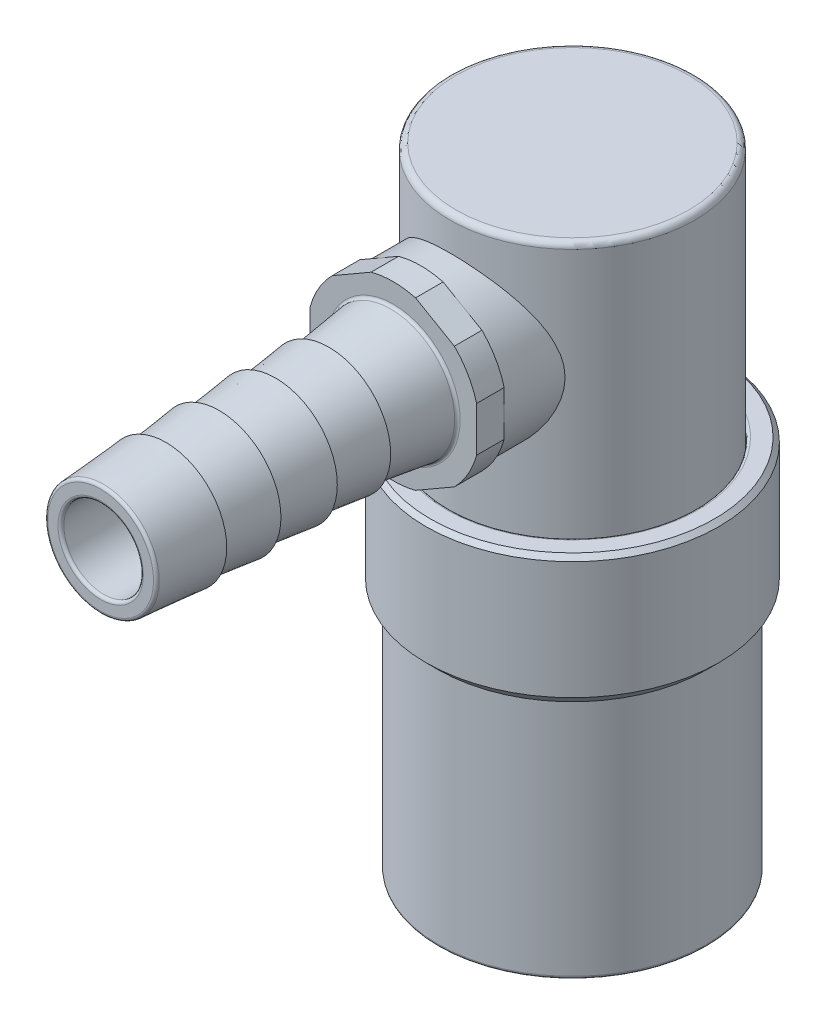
ISO-10303-21;
HEADER;
FILE_DESCRIPTION(('STEP AP214'),'2;1');
FILE_NAME('part.step','',(''),(''),'','','');
FILE_SCHEMA(('AUTOMOTIVE_DESIGN { 1 0 10303 214 1 1 1 1 }'));
ENDSEC;
DATA;
#1=APPLICATION_CONTEXT('core data for automotive mechanical design processes');
#2=APPLICATION_PROTOCOL_DEFINITION('international standard','automotive_design',2000,#1);
#3=PRODUCT_CONTEXT('',#1,'mechanical');
#4=PRODUCT('Part','Part','',(#3));
#5=PRODUCT_RELATED_PRODUCT_CATEGORY('part','',(#4));
#6=PRODUCT_DEFINITION_FORMATION('','',#4);
#7=PRODUCT_DEFINITION_CONTEXT('part definition',#1,'design');
#8=PRODUCT_DEFINITION('design','',#6,#7);
#9=PRODUCT_DEFINITION_SHAPE('','',#8);
#10=(LENGTH_UNIT() NAMED_UNIT(*) SI_UNIT(.MILLI.,.METRE.));
#11=(NAMED_UNIT(*) PLANE_ANGLE_UNIT() SI_UNIT($,.RADIAN.));
#12=(NAMED_UNIT(*) SI_UNIT($,.STERADIAN.) SOLID_ANGLE_UNIT());
#13=UNCERTAINTY_MEASURE_WITH_UNIT(LENGTH_MEASURE(1.E-05),#10,'distance_accuracy_value','');
#14=(GEOMETRIC_REPRESENTATION_CONTEXT(3) GLOBAL_UNCERTAINTY_ASSIGNED_CONTEXT((#13)) GLOBAL_UNIT_ASSIGNED_CONTEXT((#10,
#11,#12)) REPRESENTATION_CONTEXT('',''));
#15=CARTESIAN_POINT('',(0.,0.,0.));
#16=DIRECTION('',(0.,0.,1.));
#17=DIRECTION('',(1.,0.,0.));
#18=AXIS2_PLACEMENT_3D('',#15,#16,#17);
#19=CARTESIAN_POINT('',(0.,43.945233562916,15.599202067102));
#20=DIRECTION('',(0.,0.,-1.));
#21=DIRECTION('',(0.,1.,0.));
#22=AXIS2_PLACEMENT_3D('',#19,#20,#21);
#23=TOROIDAL_SURFACE('',#22,5.72757025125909,0.254);
#24=CARTESIAN_POINT('',(0.,43.945233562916,15.5653250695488));
#25=DIRECTION('',(0.,0.,-1.));
#26=DIRECTION('',(0.,-1.,0.));
#27=AXIS2_PLACEMENT_3D('',#24,#25,#26);
#28=CIRCLE('',#27,5.47583954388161);
#29=CARTESIAN_POINT('',(0.,49.4210731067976,15.5653250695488));
#30=VERTEX_POINT('',#29);
#31=CARTESIAN_POINT('',(0.,38.4693940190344,15.5653250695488));
#32=VERTEX_POINT('',#31);
#33=EDGE_CURVE('P0_E11',#30,#32,#28,.T.);
#34=ORIENTED_EDGE('',*,*,#33,.T.);
#35=CARTESIAN_POINT('',(0.,38.2176633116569,15.599202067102));
#36=DIRECTION('',(-1.,0.,0.));
#37=DIRECTION('',(0.,-1.,0.));
#38=AXIS2_PLACEMENT_3D('',#35,#36,#37);
#39=CIRCLE('',#38,0.254);
#40=CARTESIAN_POINT('',(0.,38.2176633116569,15.345202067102));
#41=VERTEX_POINT('',#40);
#42=EDGE_CURVE('P0_E27',#32,#41,#39,.T.);
#43=ORIENTED_EDGE('',*,*,#42,.T.);
#44=CARTESIAN_POINT('',(0.,43.945233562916,15.345202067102));
#45=DIRECTION('',(0.,0.,1.));
#46=DIRECTION('',(0.,-1.,0.));
#47=AXIS2_PLACEMENT_3D('',#44,#45,#46);
#48=CIRCLE('',#47,5.72757025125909);
#49=CARTESIAN_POINT('',(0.,49.6728038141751,15.345202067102));
#50=VERTEX_POINT('',#49);
#51=EDGE_CURVE('P0_E529',#41,#50,#48,.T.);
#52=ORIENTED_EDGE('',*,*,#51,.T.);
#53=CARTESIAN_POINT('',(0.,43.945233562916,15.345202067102));
#54=DIRECTION('',(0.,0.,1.));
#55=DIRECTION('',(0.,-1.,0.));
#56=AXIS2_PLACEMENT_3D('',#53,#54,#55);
#57=CIRCLE('',#56,5.72757025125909);
#58=EDGE_CURVE('P0_E532',#50,#41,#57,.T.);
#59=ORIENTED_EDGE('',*,*,#58,.T.);
#60=ORIENTED_EDGE('',*,*,#42,.F.);
#61=CARTESIAN_POINT('',(0.,43.945233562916,15.5653250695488));
#62=DIRECTION('',(0.,0.,-1.));
#63=DIRECTION('',(0.,-1.,0.));
#64=AXIS2_PLACEMENT_3D('',#61,#62,#63);
#65=CIRCLE('',#64,5.47583954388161);
#66=EDGE_CURVE('P0_E41',#32,#30,#65,.T.);
#67=ORIENTED_EDGE('',*,*,#66,.T.);
#68=EDGE_LOOP('',(#34,#43,#52,#59,#60,#67));
#69=FACE_BOUND('',#68,.T.);
#70=ADVANCED_FACE('P0_F16',(#69),#23,.F.);
#71=CARTESIAN_POINT('',(0.,43.945233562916,18.1011020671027));
#72=DIRECTION('',(0.,0.,-1.));
#73=DIRECTION('',(0.,1.,0.));
#74=AXIS2_PLACEMENT_3D('',#71,#72,#73);
#75=CONICAL_SURFACE('',#74,5.13458395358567,0.133772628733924);
#76=ORIENTED_EDGE('',*,*,#33,.F.);
#77=ORIENTED_EDGE('',*,*,#66,.F.);
#78=DIRECTION('',(0.,0.13337400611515,0.991065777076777));
#79=VECTOR('',#78,1.);
#80=CARTESIAN_POINT('',(0.,38.8106496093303,18.1011020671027));
#81=LINE('',#80,#79);
#82=CARTESIAN_POINT('',(0.,39.1815285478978,20.8570020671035));
#83=VERTEX_POINT('',#82);
#84=EDGE_CURVE('P0_E426',#32,#83,#81,.T.);
#85=ORIENTED_EDGE('',*,*,#84,.T.);
#86=CARTESIAN_POINT('',(0.,43.945233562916,20.8570020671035));
#87=DIRECTION('',(0.,0.,-1.));
#88=DIRECTION('',(1.,0.,0.));
#89=AXIS2_PLACEMENT_3D('',#86,#87,#88);
#90=CIRCLE('',#89,4.76370501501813);
#91=CARTESIAN_POINT('',(0.,48.7089385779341,20.8570020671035));
#92=VERTEX_POINT('',#91);
#93=EDGE_CURVE('P0_E419',#83,#92,#90,.T.);
#94=ORIENTED_EDGE('',*,*,#93,.T.);
#95=CARTESIAN_POINT('',(0.,43.945233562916,20.8570020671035));
#96=DIRECTION('',(0.,0.,-1.));
#97=DIRECTION('',(1.,0.,0.));
#98=AXIS2_PLACEMENT_3D('',#95,#96,#97);
#99=CIRCLE('',#98,4.76370501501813);
#100=EDGE_CURVE('P0_E412',#92,#83,#99,.T.);
#101=ORIENTED_EDGE('',*,*,#100,.T.);
#102=ORIENTED_EDGE('',*,*,#84,.F.);
#103=EDGE_LOOP('',(#76,#77,#85,#94,#101,#102));
#104=FACE_BOUND('',#103,.T.);
#105=ADVANCED_FACE('P0_F946',(#104),#75,.T.);
#106=CARTESIAN_POINT('',(0.,51.336633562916,15.345202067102));
#107=DIRECTION('',(0.,0.,1.));
#108=DIRECTION('',(1.,0.,0.));
#109=AXIS2_PLACEMENT_3D('',#106,#107,#108);
#110=PLANE('',#109);
#111=DIRECTION('',(0.866025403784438,-0.5,0.));
#112=VECTOR('',#111,1.);
#113=CARTESIAN_POINT('',(-3.38463504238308,37.6577938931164,15.345202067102));
#114=LINE('',#113,#112);
#115=CARTESIAN_POINT('',(-5.23235152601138,38.7245735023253,15.345202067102));
#116=VERTEX_POINT('',#115);
#117=CARTESIAN_POINT('',(-1.90504847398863,36.8035541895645,15.345202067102));
#118=VERTEX_POINT('',#117);
#119=EDGE_CURVE('P0_E380',#116,#118,#114,.T.);
#120=ORIENTED_EDGE('',*,*,#119,.T.);
#121=CARTESIAN_POINT('',(0.,43.945233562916,15.345202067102));
#122=DIRECTION('',(0.,0.,-1.));
#123=DIRECTION('',(1.,0.,0.));
#124=AXIS2_PLACEMENT_3D('',#121,#122,#123);
#125=CIRCLE('',#124,7.3914);
#126=CARTESIAN_POINT('',(1.90504847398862,36.8035541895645,15.345202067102));
#127=VERTEX_POINT('',#126);
#128=EDGE_CURVE('P0_E442',#127,#118,#125,.T.);
#129=ORIENTED_EDGE('',*,*,#128,.F.);
#130=DIRECTION('',(0.866025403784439,0.5,0.));
#131=VECTOR('',#130,1.);
#132=CARTESIAN_POINT('',(6.95333504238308,39.7181837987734,15.345202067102));
#133=LINE('',#132,#131);
#134=CARTESIAN_POINT('',(5.23235152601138,38.7245735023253,15.345202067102));
#135=VERTEX_POINT('',#134);
#136=EDGE_CURVE('P0_E363',#127,#135,#133,.T.);
#137=ORIENTED_EDGE('',*,*,#136,.T.);
#138=CARTESIAN_POINT('',(0.,43.945233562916,15.345202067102));
#139=DIRECTION('',(0.,0.,-1.));
#140=DIRECTION('',(1.,0.,0.));
#141=AXIS2_PLACEMENT_3D('',#138,#139,#140);
#142=CIRCLE('',#141,7.3914);
#143=CARTESIAN_POINT('',(7.1374,42.0242142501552,15.345202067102));
#144=VERTEX_POINT('',#143);
#145=EDGE_CURVE('P0_E478',#144,#135,#142,.T.);
#146=ORIENTED_EDGE('',*,*,#145,.F.);
#147=DIRECTION('',(0.,1.,0.));
#148=VECTOR('',#147,1.);
#149=CARTESIAN_POINT('',(7.1374,49.701323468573,15.345202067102));
#150=LINE('',#149,#148);
#151=CARTESIAN_POINT('',(7.1374,45.8662528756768,15.345202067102));
#152=VERTEX_POINT('',#151);
#153=EDGE_CURVE('P0_E359',#144,#152,#150,.T.);
#154=ORIENTED_EDGE('',*,*,#153,.T.);
#155=CARTESIAN_POINT('',(0.,43.945233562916,15.345202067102));
#156=DIRECTION('',(0.,0.,-1.));
#157=DIRECTION('',(1.,0.,0.));
#158=AXIS2_PLACEMENT_3D('',#155,#156,#157);
#159=CIRCLE('',#158,7.3914);
#160=CARTESIAN_POINT('',(5.23235152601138,49.1658936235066,15.345202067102));
#161=VERTEX_POINT('',#160);
#162=EDGE_CURVE('P0_E275',#161,#152,#159,.T.);
#163=ORIENTED_EDGE('',*,*,#162,.F.);
#164=DIRECTION('',(-0.866025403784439,0.5,0.));
#165=VECTOR('',#164,1.);
#166=CARTESIAN_POINT('',(0.184064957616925,52.0805232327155,15.345202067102));
#167=LINE('',#166,#165);
#168=CARTESIAN_POINT('',(1.90504847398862,51.0869129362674,15.345202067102));
#169=VERTEX_POINT('',#168);
#170=EDGE_CURVE('P0_E364',#161,#169,#167,.T.);
#171=ORIENTED_EDGE('',*,*,#170,.T.);
#172=CARTESIAN_POINT('',(0.,43.945233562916,15.345202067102));
#173=DIRECTION('',(0.,0.,-1.));
#174=DIRECTION('',(1.,0.,0.));
#175=AXIS2_PLACEMENT_3D('',#172,#173,#174);
#176=CIRCLE('',#175,7.3914);
#177=CARTESIAN_POINT('',(-1.90504847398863,51.0869129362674,15.345202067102));
#178=VERTEX_POINT('',#177);
#179=EDGE_CURVE('P0_E345',#178,#169,#176,.T.);
#180=ORIENTED_EDGE('',*,*,#179,.F.);
#181=DIRECTION('',(-0.866025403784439,-0.5,0.));
#182=VECTOR('',#181,1.);
#183=CARTESIAN_POINT('',(-3.75276495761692,50.0201333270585,15.345202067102));
#184=LINE('',#183,#182);
#185=CARTESIAN_POINT('',(-5.23235152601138,49.1658936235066,15.345202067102));
#186=VERTEX_POINT('',#185);
#187=EDGE_CURVE('P0_E239',#178,#186,#184,.T.);
#188=ORIENTED_EDGE('',*,*,#187,.T.);
#189=CARTESIAN_POINT('',(0.,43.945233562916,15.345202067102));
#190=DIRECTION('',(0.,0.,-1.));
#191=DIRECTION('',(1.,0.,0.));
#192=AXIS2_PLACEMENT_3D('',#189,#190,#191);
#193=CIRCLE('',#192,7.3914);
#194=CARTESIAN_POINT('',(-7.1374,45.8662528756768,15.345202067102));
#195=VERTEX_POINT('',#194);
#196=EDGE_CURVE('P0_E230',#195,#186,#193,.T.);
#197=ORIENTED_EDGE('',*,*,#196,.F.);
#198=DIRECTION('',(0.,-1.,0.));
#199=VECTOR('',#198,1.);
#200=CARTESIAN_POINT('',(-7.1374,45.580543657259,15.345202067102));
#201=LINE('',#200,#199);
#202=CARTESIAN_POINT('',(-7.1374,42.0242142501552,15.345202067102));
#203=VERTEX_POINT('',#202);
#204=EDGE_CURVE('P0_E236',#195,#203,#201,.T.);
#205=ORIENTED_EDGE('',*,*,#204,.T.);
#206=CARTESIAN_POINT('',(0.,43.945233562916,15.345202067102));
#207=DIRECTION('',(0.,0.,-1.));
#208=DIRECTION('',(1.,0.,0.));
#209=AXIS2_PLACEMENT_3D('',#206,#207,#208);
#210=CIRCLE('',#209,7.3914);
#211=EDGE_CURVE('P0_E269',#116,#203,#210,.T.);
#212=ORIENTED_EDGE('',*,*,#211,.F.);
#213=EDGE_LOOP('',(#120,#129,#137,#146,#154,#163,#171,#180,#188,#197,#205,#212));
#214=FACE_BOUND('',#213,.T.);
#215=ORIENTED_EDGE('',*,*,#58,.F.);
#216=ORIENTED_EDGE('',*,*,#51,.F.);
#217=EDGE_LOOP('',(#215,#216));
#218=FACE_BOUND('',#217,.T.);
#219=ADVANCED_FACE('P0_F233',(#214,#218),#110,.T.);
#220=CARTESIAN_POINT('',(0.,43.9452335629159,40.161002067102));
#221=DIRECTION('',(0.,0.,-1.));
#222=DIRECTION('',(0.,1.,0.));
#223=AXIS2_PLACEMENT_3D('',#220,#221,#222);
#224=TOROIDAL_SURFACE('',#223,3.6576,0.254);
#225=CARTESIAN_POINT('',(0.,43.9452335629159,40.415002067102));
#226=DIRECTION('',(0.,0.,1.));
#227=DIRECTION('',(0.,-1.,0.));
#228=AXIS2_PLACEMENT_3D('',#225,#226,#227);
#229=CIRCLE('',#228,3.6576);
#230=CARTESIAN_POINT('',(0.,47.6028335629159,40.415002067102));
#231=VERTEX_POINT('',#230);
#232=CARTESIAN_POINT('',(0.,40.2876335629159,40.415002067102));
#233=VERTEX_POINT('',#232);
#234=EDGE_CURVE('P0_E252',#231,#233,#229,.T.);
#235=ORIENTED_EDGE('',*,*,#234,.T.);
#236=CARTESIAN_POINT('',(0.,40.2876335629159,40.161002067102));
#237=DIRECTION('',(-1.,0.,0.));
#238=DIRECTION('',(0.,-1.,0.));
#239=AXIS2_PLACEMENT_3D('',#236,#237,#238);
#240=CIRCLE('',#239,0.254);
#241=CARTESIAN_POINT('',(0.,40.5416335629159,40.161002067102));
#242=VERTEX_POINT('',#241);
#243=EDGE_CURVE('P0_E365',#233,#242,#240,.T.);
#244=ORIENTED_EDGE('',*,*,#243,.T.);
#245=CARTESIAN_POINT('',(0.,43.9452335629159,40.161002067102));
#246=DIRECTION('',(0.,0.,-1.));
#247=DIRECTION('',(0.,-1.,0.));
#248=AXIS2_PLACEMENT_3D('',#245,#246,#247);
#249=CIRCLE('',#248,3.4036);
#250=CARTESIAN_POINT('',(0.,47.3488335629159,40.161002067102));
#251=VERTEX_POINT('',#250);
#252=EDGE_CURVE('P0_E369',#242,#251,#249,.T.);
#253=ORIENTED_EDGE('',*,*,#252,.T.);
#254=CARTESIAN_POINT('',(0.,43.9452335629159,40.161002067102));
#255=DIRECTION('',(0.,0.,-1.));
#256=DIRECTION('',(0.,-1.,0.));
#257=AXIS2_PLACEMENT_3D('',#254,#255,#256);
#258=CIRCLE('',#257,3.4036);
#259=EDGE_CURVE('P0_E374',#251,#242,#258,.T.);
#260=ORIENTED_EDGE('',*,*,#259,.T.);
#261=ORIENTED_EDGE('',*,*,#243,.F.);
#262=CARTESIAN_POINT('',(0.,43.9452335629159,40.415002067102));
#263=DIRECTION('',(0.,0.,1.));
#264=DIRECTION('',(0.,-1.,0.));
#265=AXIS2_PLACEMENT_3D('',#262,#263,#264);
#266=CIRCLE('',#265,3.6576);
#267=EDGE_CURVE('P0_E302',#233,#231,#266,.T.);
#268=ORIENTED_EDGE('',*,*,#267,.T.);
#269=EDGE_LOOP('',(#235,#244,#253,#260,#261,#268));
#270=FACE_BOUND('',#269,.T.);
#271=ADVANCED_FACE('P0_F867',(#270),#224,.T.);
#272=CARTESIAN_POINT('',(0.,48.7089385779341,40.415002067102));
#273=DIRECTION('',(0.,0.,1.));
#274=DIRECTION('',(1.,0.,0.));
#275=AXIS2_PLACEMENT_3D('',#272,#273,#274);
#276=PLANE('',#275);
#277=CARTESIAN_POINT('',(0.,43.9452335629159,40.415002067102));
#278=DIRECTION('',(0.,0.,-1.));
#279=DIRECTION('',(0.,-1.,0.));
#280=AXIS2_PLACEMENT_3D('',#277,#278,#279);
#281=CIRCLE('',#280,4.5291072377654);
#282=CARTESIAN_POINT('',(0.,48.4743408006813,40.415002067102));
#283=VERTEX_POINT('',#282);
#284=CARTESIAN_POINT('',(0.,39.4161263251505,40.415002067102));
#285=VERTEX_POINT('',#284);
#286=EDGE_CURVE('P0_E309',#283,#285,#281,.T.);
#287=ORIENTED_EDGE('',*,*,#286,.F.);
#288=CARTESIAN_POINT('',(0.,43.9452335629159,40.415002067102));
#289=DIRECTION('',(0.,0.,-1.));
#290=DIRECTION('',(0.,-1.,0.));
#291=AXIS2_PLACEMENT_3D('',#288,#289,#290);
#292=CIRCLE('',#291,4.5291072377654);
#293=EDGE_CURVE('P0_E304',#285,#283,#292,.T.);
#294=ORIENTED_EDGE('',*,*,#293,.F.);
#295=EDGE_LOOP('',(#287,#294));
#296=FACE_BOUND('',#295,.T.);
#297=ORIENTED_EDGE('',*,*,#234,.F.);
#298=ORIENTED_EDGE('',*,*,#267,.F.);
#299=EDGE_LOOP('',(#297,#298));
#300=FACE_BOUND('',#299,.T.);
#301=ADVANCED_FACE('P0_F872',(#296,#300),#276,.T.);
#302=CARTESIAN_POINT('',(0.,43.945233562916,23.206502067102));
#303=DIRECTION('',(0.,0.,-1.));
#304=DIRECTION('',(0.,1.,0.));
#305=AXIS2_PLACEMENT_3D('',#302,#303,#304);
#306=CYLINDRICAL_SURFACE('',#305,3.4036);
#307=CARTESIAN_POINT('',(0.,43.945233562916,6.760002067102));
#308=DIRECTION('',(0.,0.,1.));
#309=DIRECTION('',(0.,-1.,0.));
#310=AXIS2_PLACEMENT_3D('',#307,#308,#309);
#311=CIRCLE('',#310,3.4036);
#312=CARTESIAN_POINT('',(0.,47.348833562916,6.76000206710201));
#313=VERTEX_POINT('',#312);
#314=CARTESIAN_POINT('',(0.,40.541633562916,6.76000206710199));
#315=VERTEX_POINT('',#314);
#316=EDGE_CURVE('P0_E480',#313,#315,#311,.T.);
#317=ORIENTED_EDGE('',*,*,#316,.F.);
#318=CARTESIAN_POINT('',(0.,43.945233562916,6.760002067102));
#319=DIRECTION('',(0.,0.,1.));
#320=DIRECTION('',(0.,-1.,0.));
#321=AXIS2_PLACEMENT_3D('',#318,#319,#320);
#322=CIRCLE('',#321,3.4036);
#323=EDGE_CURVE('P0_E326',#315,#313,#322,.T.);
#324=ORIENTED_EDGE('',*,*,#323,.F.);
#325=DIRECTION('',(0.,0.,1.));
#326=VECTOR('',#325,1.);
#327=CARTESIAN_POINT('',(0.,40.541633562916,23.206502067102));
#328=LINE('',#327,#326);
#329=EDGE_CURVE('P0_E298',#315,#242,#328,.T.);
#330=ORIENTED_EDGE('',*,*,#329,.T.);
#331=ORIENTED_EDGE('',*,*,#259,.F.);
#332=ORIENTED_EDGE('',*,*,#252,.F.);
#333=ORIENTED_EDGE('',*,*,#329,.F.);
#334=EDGE_LOOP('',(#317,#324,#330,#331,#332,#333));
#335=FACE_BOUND('',#334,.T.);
#336=ADVANCED_FACE('P0_F899',(#335),#306,.F.);
#337=CARTESIAN_POINT('',(0.,43.9452335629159,40.161002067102));
#338=DIRECTION('',(0.,0.,-1.));
#339=DIRECTION('',(0.,1.,0.));
#340=AXIS2_PLACEMENT_3D('',#337,#338,#339);
#341=TOROIDAL_SURFACE('',#340,4.5291072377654,0.254);
#342=CARTESIAN_POINT('',(0.,43.9452335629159,40.1811429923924));
#343=DIRECTION('',(0.,0.,1.));
#344=DIRECTION('',(0.,-1.,0.));
#345=AXIS2_PLACEMENT_3D('',#342,#343,#344);
#346=CIRCLE('',#345,4.78230744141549);
#347=CARTESIAN_POINT('',(0.,48.7275410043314,40.1811429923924));
#348=VERTEX_POINT('',#347);
#349=CARTESIAN_POINT('',(0.,39.1629261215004,40.1811429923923));
#350=VERTEX_POINT('',#349);
#351=EDGE_CURVE('P0_E303',#348,#350,#346,.T.);
#352=ORIENTED_EDGE('',*,*,#351,.T.);
#353=CARTESIAN_POINT('',(0.,39.4161263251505,40.161002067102));
#354=DIRECTION('',(-1.,0.,0.));
#355=DIRECTION('',(0.,-1.,0.));
#356=AXIS2_PLACEMENT_3D('',#353,#354,#355);
#357=CIRCLE('',#356,0.254);
#358=EDGE_CURVE('P0_E308',#350,#285,#357,.T.);
#359=ORIENTED_EDGE('',*,*,#358,.T.);
#360=ORIENTED_EDGE('',*,*,#293,.T.);
#361=ORIENTED_EDGE('',*,*,#286,.T.);
#362=ORIENTED_EDGE('',*,*,#358,.F.);
#363=CARTESIAN_POINT('',(0.,43.9452335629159,40.1811429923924));
#364=DIRECTION('',(0.,0.,1.));
#365=DIRECTION('',(0.,-1.,0.));
#366=AXIS2_PLACEMENT_3D('',#363,#364,#365);
#367=CIRCLE('',#366,4.78230744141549);
#368=EDGE_CURVE('P0_E273',#350,#348,#367,.T.);
#369=ORIENTED_EDGE('',*,*,#368,.T.);
#370=EDGE_LOOP('',(#352,#359,#360,#361,#362,#369));
#371=FACE_BOUND('',#370,.T.);
#372=ADVANCED_FACE('P0_F925',(#371),#341,.T.);
#373=CARTESIAN_POINT('',(0.,43.9452335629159,37.621002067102));
#374=DIRECTION('',(0.,0.,-1.));
#375=DIRECTION('',(0.,1.,0.));
#376=AXIS2_PLACEMENT_3D('',#373,#374,#375);
#377=CONICAL_SURFACE('',#376,4.98595501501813,0.0793783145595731);
#378=CARTESIAN_POINT('',(0.,43.9452335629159,34.827002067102));
#379=DIRECTION('',(0.,0.,-1.));
#380=DIRECTION('',(1.,0.,0.));
#381=AXIS2_PLACEMENT_3D('',#378,#379,#380);
#382=CIRCLE('',#381,5.20820501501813);
#383=CARTESIAN_POINT('',(0.,49.1534385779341,34.827002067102));
#384=VERTEX_POINT('',#383);
#385=CARTESIAN_POINT('',(0.,38.7370285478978,34.827002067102));
#386=VERTEX_POINT('',#385);
#387=EDGE_CURVE('P0_E310',#384,#386,#382,.T.);
#388=ORIENTED_EDGE('',*,*,#387,.F.);
#389=CARTESIAN_POINT('',(0.,43.9452335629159,34.827002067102));
#390=DIRECTION('',(0.,0.,-1.));
#391=DIRECTION('',(1.,0.,0.));
#392=AXIS2_PLACEMENT_3D('',#389,#390,#391);
#393=CIRCLE('',#392,5.20820501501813);
#394=EDGE_CURVE('P0_E315',#386,#384,#393,.T.);
#395=ORIENTED_EDGE('',*,*,#394,.F.);
#396=DIRECTION('',(0.,0.0792949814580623,0.996851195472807));
#397=VECTOR('',#396,1.);
#398=CARTESIAN_POINT('',(0.,38.9592785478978,37.621002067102));
#399=LINE('',#398,#397);
#400=EDGE_CURVE('P0_E284',#386,#350,#399,.T.);
#401=ORIENTED_EDGE('',*,*,#400,.T.);
#402=ORIENTED_EDGE('',*,*,#351,.F.);
#403=ORIENTED_EDGE('',*,*,#368,.F.);
#404=ORIENTED_EDGE('',*,*,#400,.F.);
#405=EDGE_LOOP('',(#388,#395,#401,#402,#403,#404));
#406=FACE_BOUND('',#405,.T.);
#407=ADVANCED_FACE('P0_F954',(#406),#377,.T.);
#408=CARTESIAN_POINT('',(0.,35.7036739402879,5.99800206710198));
#409=DIRECTION('',(0.5,0.866025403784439,0.));
#410=DIRECTION('',(0.,0.,-1.));
#411=AXIS2_PLACEMENT_3D('',#408,#409,#410);
#412=PLANE('',#411);
#413=DIRECTION('',(0.,0.,-1.));
#414=VECTOR('',#413,1.);
#415=CARTESIAN_POINT('',(-1.90504847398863,36.8035541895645,14.164102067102));
#416=LINE('',#415,#414);
#417=CARTESIAN_POINT('',(-1.90504847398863,36.8035541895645,12.983002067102));
#418=VERTEX_POINT('',#417);
#419=EDGE_CURVE('P0_E475',#118,#418,#416,.T.);
#420=ORIENTED_EDGE('',*,*,#419,.F.);
#421=ORIENTED_EDGE('',*,*,#119,.F.);
#422=DIRECTION('',(0.,0.,1.));
#423=VECTOR('',#422,1.);
#424=CARTESIAN_POINT('',(-5.23235152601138,38.7245735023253,14.164102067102));
#425=LINE('',#424,#423);
#426=CARTESIAN_POINT('',(-5.23235152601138,38.7245735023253,12.983002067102));
#427=VERTEX_POINT('',#426);
#428=EDGE_CURVE('P0_E456',#427,#116,#425,.T.);
#429=ORIENTED_EDGE('',*,*,#428,.F.);
#430=DIRECTION('',(-0.866025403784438,0.5,0.));
#431=VECTOR('',#430,1.);
#432=CARTESIAN_POINT('',(-3.24165424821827,37.5752438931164,12.983002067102));
#433=LINE('',#432,#431);
#434=EDGE_CURVE('P0_E280',#418,#427,#433,.T.);
#435=ORIENTED_EDGE('',*,*,#434,.F.);
#436=EDGE_LOOP('',(#420,#421,#429,#435));
#437=FACE_BOUND('',#436,.T.);
#438=ADVANCED_FACE('P0_F567',(#437),#412,.F.);
#439=CARTESIAN_POINT('',(7.1374,39.824453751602,5.99800206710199));
#440=DIRECTION('',(-0.5,0.866025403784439,0.));
#441=DIRECTION('',(-0.866025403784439,-0.5,0.));
#442=AXIS2_PLACEMENT_3D('',#439,#440,#441);
#443=PLANE('',#442);
#444=DIRECTION('',(0.,0.,-1.));
#445=VECTOR('',#444,1.);
#446=CARTESIAN_POINT('',(5.23235152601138,38.7245735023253,14.164102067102));
#447=LINE('',#446,#445);
#448=CARTESIAN_POINT('',(5.23235152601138,38.7245735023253,12.983002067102));
#449=VERTEX_POINT('',#448);
#450=EDGE_CURVE('P0_E279',#135,#449,#447,.T.);
#451=ORIENTED_EDGE('',*,*,#450,.F.);
#452=ORIENTED_EDGE('',*,*,#136,.F.);
#453=DIRECTION('',(0.,0.,1.));
#454=VECTOR('',#453,1.);
#455=CARTESIAN_POINT('',(1.90504847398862,36.8035541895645,14.164102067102));
#456=LINE('',#455,#454);
#457=CARTESIAN_POINT('',(1.90504847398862,36.8035541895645,12.983002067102));
#458=VERTEX_POINT('',#457);
#459=EDGE_CURVE('P0_E445',#458,#127,#456,.T.);
#460=ORIENTED_EDGE('',*,*,#459,.F.);
#461=DIRECTION('',(-0.866025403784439,-0.5,0.));
#462=VECTOR('',#461,1.);
#463=CARTESIAN_POINT('',(6.81035424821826,39.6356337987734,12.983002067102));
#464=LINE('',#463,#462);
#465=EDGE_CURVE('P0_E353',#449,#458,#464,.T.);
#466=ORIENTED_EDGE('',*,*,#465,.F.);
#467=EDGE_LOOP('',(#451,#452,#460,#466));
#468=FACE_BOUND('',#467,.T.);
#469=ADVANCED_FACE('P0_F580',(#468),#443,.F.);
#470=CARTESIAN_POINT('',(7.1374,48.06601337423,5.99800206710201));
#471=DIRECTION('',(-1.,0.,0.));
#472=DIRECTION('',(0.,-1.,0.));
#473=AXIS2_PLACEMENT_3D('',#470,#471,#472);
#474=PLANE('',#473);
#475=DIRECTION('',(0.,0.,-1.));
#476=VECTOR('',#475,1.);
#477=CARTESIAN_POINT('',(7.1374,45.8662528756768,14.164102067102));
#478=LINE('',#477,#476);
#479=CARTESIAN_POINT('',(7.1374,45.8662528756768,12.983002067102));
#480=VERTEX_POINT('',#479);
#481=EDGE_CURVE('P0_E408',#152,#480,#478,.T.);
#482=ORIENTED_EDGE('',*,*,#481,.F.);
#483=ORIENTED_EDGE('',*,*,#153,.F.);
#484=DIRECTION('',(0.,0.,1.));
#485=VECTOR('',#484,1.);
#486=CARTESIAN_POINT('',(7.1374,42.0242142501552,14.164102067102));
#487=LINE('',#486,#485);
#488=CARTESIAN_POINT('',(7.1374,42.0242142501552,12.983002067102));
#489=VERTEX_POINT('',#488);
#490=EDGE_CURVE('P0_E435',#489,#144,#487,.T.);
#491=ORIENTED_EDGE('',*,*,#490,.F.);
#492=DIRECTION('',(0.,-1.,0.));
#493=VECTOR('',#492,1.);
#494=CARTESIAN_POINT('',(7.1374,49.371123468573,12.983002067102));
#495=LINE('',#494,#493);
#496=EDGE_CURVE('P0_E332',#480,#489,#495,.T.);
#497=ORIENTED_EDGE('',*,*,#496,.F.);
#498=EDGE_LOOP('',(#482,#483,#491,#497));
#499=FACE_BOUND('',#498,.T.);
#500=ADVANCED_FACE('P0_F588',(#499),#474,.F.);
#501=CARTESIAN_POINT('',(0.,52.1867931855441,5.99800206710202));
#502=DIRECTION('',(-0.5,-0.866025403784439,0.));
#503=DIRECTION('',(0.,0.,1.));
#504=AXIS2_PLACEMENT_3D('',#501,#502,#503);
#505=PLANE('',#504);
#506=DIRECTION('',(0.,0.,-1.));
#507=VECTOR('',#506,1.);
#508=CARTESIAN_POINT('',(1.90504847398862,51.0869129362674,14.164102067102));
#509=LINE('',#508,#507);
#510=CARTESIAN_POINT('',(1.90504847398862,51.0869129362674,12.983002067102));
#511=VERTEX_POINT('',#510);
#512=EDGE_CURVE('P0_E244',#169,#511,#509,.T.);
#513=ORIENTED_EDGE('',*,*,#512,.F.);
#514=ORIENTED_EDGE('',*,*,#170,.F.);
#515=DIRECTION('',(0.,0.,1.));
#516=VECTOR('',#515,1.);
#517=CARTESIAN_POINT('',(5.23235152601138,49.1658936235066,14.164102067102));
#518=LINE('',#517,#516);
#519=CARTESIAN_POINT('',(5.23235152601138,49.1658936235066,12.983002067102));
#520=VERTEX_POINT('',#519);
#521=EDGE_CURVE('P0_E278',#520,#161,#518,.T.);
#522=ORIENTED_EDGE('',*,*,#521,.F.);
#523=DIRECTION('',(0.866025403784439,-0.5,0.));
#524=VECTOR('',#523,1.);
#525=CARTESIAN_POINT('',(0.327045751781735,51.9979732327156,12.983002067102));
#526=LINE('',#525,#524);
#527=EDGE_CURVE('P0_E321',#511,#520,#526,.T.);
#528=ORIENTED_EDGE('',*,*,#527,.F.);
#529=EDGE_LOOP('',(#513,#514,#522,#528));
#530=FACE_BOUND('',#529,.T.);
#531=ADVANCED_FACE('P0_F623',(#530),#505,.F.);
#532=CARTESIAN_POINT('',(-7.1374,48.06601337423,5.99800206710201));
#533=DIRECTION('',(0.5,-0.866025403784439,0.));
#534=DIRECTION('',(0.,0.,-1.));
#535=AXIS2_PLACEMENT_3D('',#532,#533,#534);
#536=PLANE('',#535);
#537=DIRECTION('',(0.,0.,-1.));
#538=VECTOR('',#537,1.);
#539=CARTESIAN_POINT('',(-5.23235152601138,49.1658936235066,14.164102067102));
#540=LINE('',#539,#538);
#541=CARTESIAN_POINT('',(-5.23235152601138,49.1658936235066,12.983002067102));
#542=VERTEX_POINT('',#541);
#543=EDGE_CURVE('P0_E259',#186,#542,#540,.T.);
#544=ORIENTED_EDGE('',*,*,#543,.F.);
#545=ORIENTED_EDGE('',*,*,#187,.F.);
#546=DIRECTION('',(0.,0.,1.));
#547=VECTOR('',#546,1.);
#548=CARTESIAN_POINT('',(-1.90504847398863,51.0869129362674,14.164102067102));
#549=LINE('',#548,#547);
#550=CARTESIAN_POINT('',(-1.90504847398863,51.0869129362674,12.983002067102));
#551=VERTEX_POINT('',#550);
#552=EDGE_CURVE('P0_E341',#551,#178,#549,.T.);
#553=ORIENTED_EDGE('',*,*,#552,.F.);
#554=DIRECTION('',(0.866025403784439,0.5,0.));
#555=VECTOR('',#554,1.);
#556=CARTESIAN_POINT('',(-3.89574575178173,49.9375833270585,12.983002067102));
#557=LINE('',#556,#555);
#558=EDGE_CURVE('P0_E320',#542,#551,#557,.T.);
#559=ORIENTED_EDGE('',*,*,#558,.F.);
#560=EDGE_LOOP('',(#544,#545,#553,#559));
#561=FACE_BOUND('',#560,.T.);
#562=ADVANCED_FACE('P0_F614',(#561),#536,.F.);
#563=CARTESIAN_POINT('',(-7.1374,39.824453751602,5.99800206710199));
#564=DIRECTION('',(1.,0.,0.));
#565=DIRECTION('',(0.,-1.,0.));
#566=AXIS2_PLACEMENT_3D('',#563,#564,#565);
#567=PLANE('',#566);
#568=DIRECTION('',(0.,0.,-1.));
#569=VECTOR('',#568,1.);
#570=CARTESIAN_POINT('',(-7.1374,42.0242142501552,14.164102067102));
#571=LINE('',#570,#569);
#572=CARTESIAN_POINT('',(-7.1374,42.0242142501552,12.983002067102));
#573=VERTEX_POINT('',#572);
#574=EDGE_CURVE('P0_E250',#203,#573,#571,.T.);
#575=ORIENTED_EDGE('',*,*,#574,.F.);
#576=ORIENTED_EDGE('',*,*,#204,.F.);
#577=DIRECTION('',(0.,0.,1.));
#578=VECTOR('',#577,1.);
#579=CARTESIAN_POINT('',(-7.1374,45.8662528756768,14.164102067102));
#580=LINE('',#579,#578);
#581=CARTESIAN_POINT('',(-7.1374,45.8662528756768,12.983002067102));
#582=VERTEX_POINT('',#581);
#583=EDGE_CURVE('P0_E20',#582,#195,#580,.T.);
#584=ORIENTED_EDGE('',*,*,#583,.F.);
#585=DIRECTION('',(0.,1.,0.));
#586=VECTOR('',#585,1.);
#587=CARTESIAN_POINT('',(-7.1374,45.250343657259,12.983002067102));
#588=LINE('',#587,#586);
#589=EDGE_CURVE('P0_E390',#573,#582,#588,.T.);
#590=ORIENTED_EDGE('',*,*,#589,.F.);
#591=EDGE_LOOP('',(#575,#576,#584,#590));
#592=FACE_BOUND('',#591,.T.);
#593=ADVANCED_FACE('P0_F247',(#592),#567,.F.);
#594=CARTESIAN_POINT('',(0.,50.676233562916,12.983002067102));
#595=DIRECTION('',(0.,0.,-1.));
#596=DIRECTION('',(0.,1.,0.));
#597=AXIS2_PLACEMENT_3D('',#594,#595,#596);
#598=PLANE('',#597);
#599=ORIENTED_EDGE('',*,*,#434,.T.);
#600=CARTESIAN_POINT('',(0.,43.945233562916,12.983002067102));
#601=DIRECTION('',(0.,0.,-1.));
#602=DIRECTION('',(1.,0.,0.));
#603=AXIS2_PLACEMENT_3D('',#600,#601,#602);
#604=CIRCLE('',#603,7.3914);
#605=EDGE_CURVE('P0_E285',#427,#573,#604,.T.);
#606=ORIENTED_EDGE('',*,*,#605,.T.);
#607=ORIENTED_EDGE('',*,*,#589,.T.);
#608=CARTESIAN_POINT('',(0.,43.945233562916,12.983002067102));
#609=DIRECTION('',(0.,0.,-1.));
#610=DIRECTION('',(1.,0.,0.));
#611=AXIS2_PLACEMENT_3D('',#608,#609,#610);
#612=CIRCLE('',#611,7.3914);
#613=EDGE_CURVE('P0_E257',#582,#542,#612,.T.);
#614=ORIENTED_EDGE('',*,*,#613,.T.);
#615=ORIENTED_EDGE('',*,*,#558,.T.);
#616=CARTESIAN_POINT('',(0.,43.945233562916,12.983002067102));
#617=DIRECTION('',(0.,0.,-1.));
#618=DIRECTION('',(1.,0.,0.));
#619=AXIS2_PLACEMENT_3D('',#616,#617,#618);
#620=CIRCLE('',#619,7.3914);
#621=EDGE_CURVE('P0_E316',#551,#511,#620,.T.);
#622=ORIENTED_EDGE('',*,*,#621,.T.);
#623=ORIENTED_EDGE('',*,*,#527,.T.);
#624=CARTESIAN_POINT('',(0.,43.945233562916,12.983002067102));
#625=DIRECTION('',(0.,0.,-1.));
#626=DIRECTION('',(1.,0.,0.));
#627=AXIS2_PLACEMENT_3D('',#624,#625,#626);
#628=CIRCLE('',#627,7.3914);
#629=EDGE_CURVE('P0_E328',#520,#480,#628,.T.);
#630=ORIENTED_EDGE('',*,*,#629,.T.);
#631=ORIENTED_EDGE('',*,*,#496,.T.);
#632=CARTESIAN_POINT('',(0.,43.945233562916,12.983002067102));
#633=DIRECTION('',(0.,0.,-1.));
#634=DIRECTION('',(1.,0.,0.));
#635=AXIS2_PLACEMENT_3D('',#632,#633,#634);
#636=CIRCLE('',#635,7.3914);
#637=EDGE_CURVE('P0_E349',#489,#449,#636,.T.);
#638=ORIENTED_EDGE('',*,*,#637,.T.);
#639=ORIENTED_EDGE('',*,*,#465,.T.);
#640=CARTESIAN_POINT('',(0.,43.945233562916,12.983002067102));
#641=DIRECTION('',(0.,0.,-1.));
#642=DIRECTION('',(1.,0.,0.));
#643=AXIS2_PLACEMENT_3D('',#640,#641,#642);
#644=CIRCLE('',#643,7.3914);
#645=EDGE_CURVE('P0_E468',#458,#418,#644,.T.);
#646=ORIENTED_EDGE('',*,*,#645,.T.);
#647=EDGE_LOOP('',(#599,#606,#607,#614,#615,#622,#623,#630,#631,#638,#639,#646));
#648=FACE_BOUND('',#647,.T.);
#649=CARTESIAN_POINT('',(0.,43.945233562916,12.983002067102));
#650=DIRECTION('',(0.,0.,-1.));
#651=DIRECTION('',(0.,1.,0.));
#652=AXIS2_PLACEMENT_3D('',#649,#650,#651);
#653=CIRCLE('',#652,7.0866);
#654=CARTESIAN_POINT('',(0.,36.858633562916,12.983002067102));
#655=VERTEX_POINT('',#654);
#656=EDGE_CURVE('P0_E314',#655,#655,#653,.T.);
#657=ORIENTED_EDGE('',*,*,#656,.F.);
#658=EDGE_LOOP('',(#657));
#659=FACE_BOUND('',#658,.T.);
#660=ADVANCED_FACE('P0_F571',(#648,#659),#598,.T.);
#661=CARTESIAN_POINT('',(0.,43.945233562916,14.164102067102));
#662=DIRECTION('',(0.,0.,-1.));
#663=DIRECTION('',(0.,1.,0.));
#664=AXIS2_PLACEMENT_3D('',#661,#662,#663);
#665=CYLINDRICAL_SURFACE('',#664,7.3914);
#666=ORIENTED_EDGE('',*,*,#428,.T.);
#667=ORIENTED_EDGE('',*,*,#211,.T.);
#668=ORIENTED_EDGE('',*,*,#574,.T.);
#669=ORIENTED_EDGE('',*,*,#605,.F.);
#670=EDGE_LOOP('',(#666,#667,#668,#669));
#671=FACE_BOUND('',#670,.T.);
#672=ADVANCED_FACE('P0_F562',(#671),#665,.T.);
#673=CARTESIAN_POINT('',(0.,43.945233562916,14.164102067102));
#674=DIRECTION('',(0.,0.,-1.));
#675=DIRECTION('',(0.,1.,0.));
#676=AXIS2_PLACEMENT_3D('',#673,#674,#675);
#677=CYLINDRICAL_SURFACE('',#676,7.3914);
#678=ORIENTED_EDGE('',*,*,#543,.T.);
#679=ORIENTED_EDGE('',*,*,#613,.F.);
#680=ORIENTED_EDGE('',*,*,#583,.T.);
#681=ORIENTED_EDGE('',*,*,#196,.T.);
#682=EDGE_LOOP('',(#678,#679,#680,#681));
#683=FACE_BOUND('',#682,.T.);
#684=ADVANCED_FACE('P0_F255',(#683),#677,.T.);
#685=CARTESIAN_POINT('',(0.,43.945233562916,14.164102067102));
#686=DIRECTION('',(0.,0.,-1.));
#687=DIRECTION('',(0.,1.,0.));
#688=AXIS2_PLACEMENT_3D('',#685,#686,#687);
#689=CYLINDRICAL_SURFACE('',#688,7.3914);
#690=ORIENTED_EDGE('',*,*,#512,.T.);
#691=ORIENTED_EDGE('',*,*,#621,.F.);
#692=ORIENTED_EDGE('',*,*,#552,.T.);
#693=ORIENTED_EDGE('',*,*,#179,.T.);
#694=EDGE_LOOP('',(#690,#691,#692,#693));
#695=FACE_BOUND('',#694,.T.);
#696=ADVANCED_FACE('P0_F617',(#695),#689,.T.);
#697=CARTESIAN_POINT('',(0.,43.945233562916,14.164102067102));
#698=DIRECTION('',(0.,0.,-1.));
#699=DIRECTION('',(0.,1.,0.));
#700=AXIS2_PLACEMENT_3D('',#697,#698,#699);
#701=CYLINDRICAL_SURFACE('',#700,7.3914);
#702=ORIENTED_EDGE('',*,*,#481,.T.);
#703=ORIENTED_EDGE('',*,*,#629,.F.);
#704=ORIENTED_EDGE('',*,*,#521,.T.);
#705=ORIENTED_EDGE('',*,*,#162,.T.);
#706=EDGE_LOOP('',(#702,#703,#704,#705));
#707=FACE_BOUND('',#706,.T.);
#708=ADVANCED_FACE('P0_F592',(#707),#701,.T.);
#709=CARTESIAN_POINT('',(0.,43.945233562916,14.164102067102));
#710=DIRECTION('',(0.,0.,-1.));
#711=DIRECTION('',(0.,1.,0.));
#712=AXIS2_PLACEMENT_3D('',#709,#710,#711);
#713=CYLINDRICAL_SURFACE('',#712,7.3914);
#714=ORIENTED_EDGE('',*,*,#450,.T.);
#715=ORIENTED_EDGE('',*,*,#637,.F.);
#716=ORIENTED_EDGE('',*,*,#490,.T.);
#717=ORIENTED_EDGE('',*,*,#145,.T.);
#718=EDGE_LOOP('',(#714,#715,#716,#717));
#719=FACE_BOUND('',#718,.T.);
#720=ADVANCED_FACE('P0_F583',(#719),#713,.T.);
#721=CARTESIAN_POINT('',(0.,43.945233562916,6.379002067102));
#722=DIRECTION('',(0.,0.,-1.));
#723=DIRECTION('',(0.,-1.,0.));
#724=AXIS2_PLACEMENT_3D('',#721,#722,#723);
#725=CONICAL_SURFACE('',#724,3.7846,0.785398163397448);
#726=ORIENTED_EDGE('',*,*,#316,.T.);
#727=ORIENTED_EDGE('',*,*,#323,.T.);
#728=DIRECTION('',(0.,0.707106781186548,-0.707106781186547));
#729=VECTOR('',#728,1.);
#730=CARTESIAN_POINT('',(0.,47.729833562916,6.37900206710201));
#731=LINE('',#730,#729);
#732=CARTESIAN_POINT('',(0.,48.110833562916,5.99800206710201));
#733=VERTEX_POINT('',#732);
#734=EDGE_CURVE('P0_E322',#313,#733,#731,.T.);
#735=ORIENTED_EDGE('',*,*,#734,.T.);
#736=CARTESIAN_POINT('',(0.,43.945233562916,5.998002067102));
#737=DIRECTION('',(0.,0.,-1.));
#738=DIRECTION('',(0.,-1.,0.));
#739=AXIS2_PLACEMENT_3D('',#736,#737,#738);
#740=CIRCLE('',#739,4.1656);
#741=EDGE_CURVE('P0_E327',#733,#733,#740,.T.);
#742=ORIENTED_EDGE('',*,*,#741,.T.);
#743=ORIENTED_EDGE('',*,*,#734,.F.);
#744=EDGE_LOOP('',(#726,#727,#735,#742,#743));
#745=FACE_BOUND('',#744,.T.);
#746=ADVANCED_FACE('P0_F883',(#745),#725,.F.);
#747=CARTESIAN_POINT('',(0.,47.348833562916,5.99800206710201));
#748=DIRECTION('',(0.,0.,-1.));
#749=DIRECTION('',(0.,1.,0.));
#750=AXIS2_PLACEMENT_3D('',#747,#748,#749);
#751=PLANE('',#750);
#752=CARTESIAN_POINT('',(0.,43.945233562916,5.998002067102));
#753=DIRECTION('',(0.,0.,1.));
#754=DIRECTION('',(0.,-1.,0.));
#755=AXIS2_PLACEMENT_3D('',#752,#753,#754);
#756=CIRCLE('',#755,5.969);
#757=CARTESIAN_POINT('',(0.,49.914233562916,5.99800206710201));
#758=VERTEX_POINT('',#757);
#759=EDGE_CURVE('P0_E333',#758,#758,#756,.T.);
#760=ORIENTED_EDGE('',*,*,#759,.F.);
#761=EDGE_LOOP('',(#760));
#762=FACE_BOUND('',#761,.T.);
#763=ORIENTED_EDGE('',*,*,#741,.F.);
#764=EDGE_LOOP('',(#763));
#765=FACE_BOUND('',#764,.T.);
#766=ADVANCED_FACE('P0_F860',(#762,#765),#751,.T.);
#767=CARTESIAN_POINT('',(0.,43.945233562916,6.379002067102));
#768=DIRECTION('',(0.,0.,1.));
#769=DIRECTION('',(0.,-1.,0.));
#770=AXIS2_PLACEMENT_3D('',#767,#768,#769);
#771=CONICAL_SURFACE('',#770,6.35,0.785398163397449);
#772=ORIENTED_EDGE('',*,*,#759,.T.);
#773=DIRECTION('',(0.,0.707106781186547,0.707106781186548));
#774=VECTOR('',#773,1.);
#775=CARTESIAN_POINT('',(0.,50.295233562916,6.37900206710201));
#776=LINE('',#775,#774);
#777=CARTESIAN_POINT('',(0.,51.031833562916,7.11560206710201));
#778=VERTEX_POINT('',#777);
#779=EDGE_CURVE('P0_E337',#758,#778,#776,.T.);
#780=ORIENTED_EDGE('',*,*,#779,.T.);
#781=CARTESIAN_POINT('',(0.,43.945233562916,7.115602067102));
#782=DIRECTION('',(0.,0.,-1.));
#783=DIRECTION('',(0.,1.,0.));
#784=AXIS2_PLACEMENT_3D('',#781,#782,#783);
#785=CIRCLE('',#784,7.0866);
#786=CARTESIAN_POINT('',(0.,36.858633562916,7.11560206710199));
#787=VERTEX_POINT('',#786);
#788=EDGE_CURVE('P0_E290',#778,#787,#785,.T.);
#789=ORIENTED_EDGE('',*,*,#788,.T.);
#790=CARTESIAN_POINT('',(0.,43.945233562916,7.115602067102));
#791=DIRECTION('',(0.,0.,-1.));
#792=DIRECTION('',(0.,1.,0.));
#793=AXIS2_PLACEMENT_3D('',#790,#791,#792);
#794=CIRCLE('',#793,7.0866);
#795=EDGE_CURVE('P0_E286',#787,#778,#794,.T.);
#796=ORIENTED_EDGE('',*,*,#795,.T.);
#797=ORIENTED_EDGE('',*,*,#779,.F.);
#798=EDGE_LOOP('',(#772,#780,#789,#796,#797));
#799=FACE_BOUND('',#798,.T.);
#800=ADVANCED_FACE('P0_F854',(#799),#771,.T.);
#801=CARTESIAN_POINT('',(0.,43.945233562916,9.490502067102));
#802=DIRECTION('',(0.,0.,-1.));
#803=DIRECTION('',(0.,1.,0.));
#804=AXIS2_PLACEMENT_3D('',#801,#802,#803);
#805=CYLINDRICAL_SURFACE('',#804,7.0866);
#806=ORIENTED_EDGE('',*,*,#795,.F.);
#807=DIRECTION('',(0.,0.,1.));
#808=VECTOR('',#807,1.);
#809=CARTESIAN_POINT('',(0.,36.858633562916,9.49050206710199));
#810=LINE('',#809,#808);
#811=EDGE_CURVE('P0_E291',#787,#655,#810,.T.);
#812=ORIENTED_EDGE('',*,*,#811,.T.);
#813=ORIENTED_EDGE('',*,*,#656,.T.);
#814=ORIENTED_EDGE('',*,*,#811,.F.);
#815=ORIENTED_EDGE('',*,*,#788,.F.);
#816=EDGE_LOOP('',(#806,#812,#813,#814,#815));
#817=FACE_BOUND('',#816,.T.);
#818=ADVANCED_FACE('P0_F859',(#817),#805,.T.);
#819=CARTESIAN_POINT('',(0.,48.7089385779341,34.827002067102));
#820=DIRECTION('',(0.,0.,-1.));
#821=DIRECTION('',(0.,1.,0.));
#822=AXIS2_PLACEMENT_3D('',#819,#820,#821);
#823=PLANE('',#822);
#824=ORIENTED_EDGE('',*,*,#387,.T.);
#825=ORIENTED_EDGE('',*,*,#394,.T.);
#826=EDGE_LOOP('',(#824,#825));
#827=FACE_BOUND('',#826,.T.);
#828=CARTESIAN_POINT('',(0.,43.9452335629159,34.827002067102));
#829=DIRECTION('',(0.,0.,-1.));
#830=DIRECTION('',(1.,0.,0.));
#831=AXIS2_PLACEMENT_3D('',#828,#829,#830);
#832=CIRCLE('',#831,4.76370501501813);
#833=CARTESIAN_POINT('',(0.,48.7089385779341,34.827002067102));
#834=VERTEX_POINT('',#833);
#835=CARTESIAN_POINT('',(0.,39.1815285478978,34.827002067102));
#836=VERTEX_POINT('',#835);
#837=EDGE_CURVE('P0_E404',#834,#836,#832,.T.);
#838=ORIENTED_EDGE('',*,*,#837,.F.);
#839=CARTESIAN_POINT('',(0.,43.9452335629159,34.827002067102));
#840=DIRECTION('',(0.,0.,-1.));
#841=DIRECTION('',(1.,0.,0.));
#842=AXIS2_PLACEMENT_3D('',#839,#840,#841);
#843=CIRCLE('',#842,4.76370501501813);
#844=EDGE_CURVE('P0_E399',#836,#834,#843,.T.);
#845=ORIENTED_EDGE('',*,*,#844,.F.);
#846=EDGE_LOOP('',(#838,#845));
#847=FACE_BOUND('',#846,.T.);
#848=ADVANCED_FACE('P0_F908',(#827,#847),#823,.T.);
#849=CARTESIAN_POINT('',(0.,43.9452335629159,32.541002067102));
#850=DIRECTION('',(0.,0.,-1.));
#851=DIRECTION('',(0.,1.,0.));
#852=AXIS2_PLACEMENT_3D('',#849,#850,#851);
#853=CONICAL_SURFACE('',#852,5.02405501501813,0.113400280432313);
#854=CARTESIAN_POINT('',(0.,43.945233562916,30.255002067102));
#855=DIRECTION('',(0.,0.,-1.));
#856=DIRECTION('',(1.,0.,0.));
#857=AXIS2_PLACEMENT_3D('',#854,#855,#856);
#858=CIRCLE('',#857,5.28440501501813);
#859=CARTESIAN_POINT('',(0.,49.2296385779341,30.255002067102));
#860=VERTEX_POINT('',#859);
#861=CARTESIAN_POINT('',(0.,38.6608285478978,30.255002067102));
#862=VERTEX_POINT('',#861);
#863=EDGE_CURVE('P0_E407',#860,#862,#858,.T.);
#864=ORIENTED_EDGE('',*,*,#863,.F.);
#865=CARTESIAN_POINT('',(0.,43.945233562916,30.255002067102));
#866=DIRECTION('',(0.,0.,-1.));
#867=DIRECTION('',(1.,0.,0.));
#868=AXIS2_PLACEMENT_3D('',#865,#866,#867);
#869=CIRCLE('',#868,5.28440501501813);
#870=EDGE_CURVE('P0_E373',#862,#860,#869,.T.);
#871=ORIENTED_EDGE('',*,*,#870,.F.);
#872=DIRECTION('',(0.,0.113157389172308,0.99357707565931));
#873=VECTOR('',#872,1.);
#874=CARTESIAN_POINT('',(0.,38.9211785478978,32.541002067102));
#875=LINE('',#874,#873);
#876=EDGE_CURVE('P0_E403',#862,#836,#875,.T.);
#877=ORIENTED_EDGE('',*,*,#876,.T.);
#878=ORIENTED_EDGE('',*,*,#844,.T.);
#879=ORIENTED_EDGE('',*,*,#837,.T.);
#880=ORIENTED_EDGE('',*,*,#876,.F.);
#881=EDGE_LOOP('',(#864,#871,#877,#878,#879,#880));
#882=FACE_BOUND('',#881,.T.);
#883=ADVANCED_FACE('P0_F1032',(#882),#853,.T.);
#884=CARTESIAN_POINT('',(0.,48.6800108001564,30.255002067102));
#885=DIRECTION('',(0.,0.,-1.));
#886=DIRECTION('',(0.,1.,0.));
#887=AXIS2_PLACEMENT_3D('',#884,#885,#886);
#888=PLANE('',#887);
#889=ORIENTED_EDGE('',*,*,#863,.T.);
#890=ORIENTED_EDGE('',*,*,#870,.T.);
#891=EDGE_LOOP('',(#889,#890));
#892=FACE_BOUND('',#891,.T.);
#893=CARTESIAN_POINT('',(0.,43.945233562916,30.255002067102));
#894=DIRECTION('',(0.,0.,-1.));
#895=DIRECTION('',(1.,0.,0.));
#896=AXIS2_PLACEMENT_3D('',#893,#894,#895);
#897=CIRCLE('',#896,4.73477723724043);
#898=CARTESIAN_POINT('',(0.,48.6800108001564,30.255002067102));
#899=VERTEX_POINT('',#898);
#900=CARTESIAN_POINT('',(0.,39.2104563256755,30.255002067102));
#901=VERTEX_POINT('',#900);
#902=EDGE_CURVE('P0_E297',#899,#901,#897,.T.);
#903=ORIENTED_EDGE('',*,*,#902,.F.);
#904=CARTESIAN_POINT('',(0.,43.945233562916,30.255002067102));
#905=DIRECTION('',(0.,0.,-1.));
#906=DIRECTION('',(1.,0.,0.));
#907=AXIS2_PLACEMENT_3D('',#904,#905,#906);
#908=CIRCLE('',#907,4.73477723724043);
#909=EDGE_CURVE('P0_E292',#901,#899,#908,.T.);
#910=ORIENTED_EDGE('',*,*,#909,.F.);
#911=EDGE_LOOP('',(#903,#910));
#912=FACE_BOUND('',#911,.T.);
#913=ADVANCED_FACE('P0_F1051',(#892,#912),#888,.T.);
#914=CARTESIAN_POINT('',(0.,43.945233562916,27.8420020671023));
#915=DIRECTION('',(0.,0.,-1.));
#916=DIRECTION('',(0.,1.,0.));
#917=AXIS2_PLACEMENT_3D('',#914,#915,#916);
#918=CONICAL_SURFACE('',#917,5.00959112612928,0.113400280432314);
#919=CARTESIAN_POINT('',(0.,43.945233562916,25.4290020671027));
#920=DIRECTION('',(0.,0.,-1.));
#921=DIRECTION('',(1.,0.,0.));
#922=AXIS2_PLACEMENT_3D('',#919,#920,#921);
#923=CIRCLE('',#922,5.28440501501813);
#924=CARTESIAN_POINT('',(0.,49.2296385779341,25.4290020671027));
#925=VERTEX_POINT('',#924);
#926=CARTESIAN_POINT('',(0.,38.6608285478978,25.4290020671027));
#927=VERTEX_POINT('',#926);
#928=EDGE_CURVE('P0_E354',#925,#927,#923,.T.);
#929=ORIENTED_EDGE('',*,*,#928,.F.);
#930=CARTESIAN_POINT('',(0.,43.945233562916,25.4290020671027));
#931=DIRECTION('',(0.,0.,-1.));
#932=DIRECTION('',(1.,0.,0.));
#933=AXIS2_PLACEMENT_3D('',#930,#931,#932);
#934=CIRCLE('',#933,5.28440501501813);
#935=EDGE_CURVE('P0_E358',#927,#925,#934,.T.);
#936=ORIENTED_EDGE('',*,*,#935,.F.);
#937=DIRECTION('',(0.,0.11315738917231,0.99357707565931));
#938=VECTOR('',#937,1.);
#939=CARTESIAN_POINT('',(0.,38.9356424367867,27.8420020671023));
#940=LINE('',#939,#938);
#941=EDGE_CURVE('P0_E296',#927,#901,#940,.T.);
#942=ORIENTED_EDGE('',*,*,#941,.T.);
#943=ORIENTED_EDGE('',*,*,#909,.T.);
#944=ORIENTED_EDGE('',*,*,#902,.T.);
#945=ORIENTED_EDGE('',*,*,#941,.F.);
#946=EDGE_LOOP('',(#929,#936,#942,#943,#944,#945));
#947=FACE_BOUND('',#946,.T.);
#948=ADVANCED_FACE('P0_F18',(#947),#918,.T.);
#949=CARTESIAN_POINT('',(0.,48.7089385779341,25.429002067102));
#950=DIRECTION('',(0.,0.,-1.));
#951=DIRECTION('',(0.,1.,0.));
#952=AXIS2_PLACEMENT_3D('',#949,#950,#951);
#953=PLANE('',#952);
#954=ORIENTED_EDGE('',*,*,#928,.T.);
#955=ORIENTED_EDGE('',*,*,#935,.T.);
#956=EDGE_LOOP('',(#954,#955));
#957=FACE_BOUND('',#956,.T.);
#958=CARTESIAN_POINT('',(0.,43.945233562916,25.429002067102));
#959=DIRECTION('',(0.,0.,-1.));
#960=DIRECTION('',(1.,0.,0.));
#961=AXIS2_PLACEMENT_3D('',#958,#959,#960);
#962=CIRCLE('',#961,4.76370501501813);
#963=CARTESIAN_POINT('',(0.,48.7089385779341,25.429002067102));
#964=VERTEX_POINT('',#963);
#965=CARTESIAN_POINT('',(0.,39.1815285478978,25.429002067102));
#966=VERTEX_POINT('',#965);
#967=EDGE_CURVE('P0_E397',#964,#966,#962,.T.);
#968=ORIENTED_EDGE('',*,*,#967,.F.);
#969=CARTESIAN_POINT('',(0.,43.945233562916,25.429002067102));
#970=DIRECTION('',(0.,0.,-1.));
#971=DIRECTION('',(1.,0.,0.));
#972=AXIS2_PLACEMENT_3D('',#969,#970,#971);
#973=CIRCLE('',#972,4.76370501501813);
#974=EDGE_CURVE('P0_E514',#966,#964,#973,.T.);
#975=ORIENTED_EDGE('',*,*,#974,.F.);
#976=EDGE_LOOP('',(#968,#975));
#977=FACE_BOUND('',#976,.T.);
#978=ADVANCED_FACE('P0_F976',(#957,#977),#953,.T.);
#979=CARTESIAN_POINT('',(0.,43.945233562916,23.1430020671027));
#980=DIRECTION('',(0.,0.,-1.));
#981=DIRECTION('',(0.,1.,0.));
#982=AXIS2_PLACEMENT_3D('',#979,#980,#981);
#983=CONICAL_SURFACE('',#982,5.02405501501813,0.113400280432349);
#984=CARTESIAN_POINT('',(0.,43.945233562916,20.8570020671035));
#985=DIRECTION('',(0.,0.,-1.));
#986=DIRECTION('',(1.,0.,0.));
#987=AXIS2_PLACEMENT_3D('',#984,#985,#986);
#988=CIRCLE('',#987,5.28440501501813);
#989=CARTESIAN_POINT('',(0.,49.2296385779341,20.8570020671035));
#990=VERTEX_POINT('',#989);
#991=CARTESIAN_POINT('',(0.,38.6608285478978,20.8570020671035));
#992=VERTEX_POINT('',#991);
#993=EDGE_CURVE('P0_E393',#990,#992,#988,.T.);
#994=ORIENTED_EDGE('',*,*,#993,.F.);
#995=CARTESIAN_POINT('',(0.,43.945233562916,20.8570020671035));
#996=DIRECTION('',(0.,0.,-1.));
#997=DIRECTION('',(1.,0.,0.));
#998=AXIS2_PLACEMENT_3D('',#995,#996,#997);
#999=CIRCLE('',#998,5.28440501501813);
#1000=EDGE_CURVE('P0_E398',#992,#990,#999,.T.);
#1001=ORIENTED_EDGE('',*,*,#1000,.F.);
#1002=DIRECTION('',(0.,0.113157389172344,0.993577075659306));
#1003=VECTOR('',#1002,1.);
#1004=CARTESIAN_POINT('',(0.,38.9211785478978,23.1430020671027));
#1005=LINE('',#1004,#1003);
#1006=EDGE_CURVE('P0_E461',#992,#966,#1005,.T.);
#1007=ORIENTED_EDGE('',*,*,#1006,.T.);
#1008=ORIENTED_EDGE('',*,*,#974,.T.);
#1009=ORIENTED_EDGE('',*,*,#967,.T.);
#1010=ORIENTED_EDGE('',*,*,#1006,.F.);
#1011=EDGE_LOOP('',(#994,#1001,#1007,#1008,#1009,#1010));
#1012=FACE_BOUND('',#1011,.T.);
#1013=ADVANCED_FACE('P0_F981',(#1012),#983,.T.);
#1014=CARTESIAN_POINT('',(0.,48.7089385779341,20.8570020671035));
#1015=DIRECTION('',(0.,0.,-1.));
#1016=DIRECTION('',(0.,1.,0.));
#1017=AXIS2_PLACEMENT_3D('',#1014,#1015,#1016);
#1018=PLANE('',#1017);
#1019=ORIENTED_EDGE('',*,*,#993,.T.);
#1020=ORIENTED_EDGE('',*,*,#1000,.T.);
#1021=EDGE_LOOP('',(#1019,#1020));
#1022=FACE_BOUND('',#1021,.T.);
#1023=ORIENTED_EDGE('',*,*,#100,.F.);
#1024=ORIENTED_EDGE('',*,*,#93,.F.);
#1025=EDGE_LOOP('',(#1023,#1024));
#1026=FACE_BOUND('',#1025,.T.);
#1027=ADVANCED_FACE('P0_F934',(#1022,#1026),#1018,.T.);
#1028=CARTESIAN_POINT('',(0.,43.945233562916,14.164102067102));
#1029=DIRECTION('',(0.,0.,-1.));
#1030=DIRECTION('',(0.,-1.,0.));
#1031=AXIS2_PLACEMENT_3D('',#1028,#1029,#1030);
#1032=CYLINDRICAL_SURFACE('',#1031,7.3914);
#1033=ORIENTED_EDGE('',*,*,#419,.T.);
#1034=ORIENTED_EDGE('',*,*,#645,.F.);
#1035=ORIENTED_EDGE('',*,*,#459,.T.);
#1036=ORIENTED_EDGE('',*,*,#128,.T.);
#1037=EDGE_LOOP('',(#1033,#1034,#1035,#1036));
#1038=FACE_BOUND('',#1037,.T.);
#1039=ADVANCED_FACE('P0_F576',(#1038),#1032,.T.);
#1040=CLOSED_SHELL('',(#70,#105,#219,#271,#301,#336,#372,#407,#438,#469,#500,#531,#562,#593,
#660,#672,#684,#696,#708,#720,#746,#766,#800,#818,#848,#883,#913,#948,#978,#1013,#1027,#1039));
#1041=MANIFOLD_SOLID_BREP('P0_B1',#1040);
#1042=CARTESIAN_POINT('',(0.,31.9405,0.));
#1043=DIRECTION('',(0.,-1.,0.));
#1044=DIRECTION('',(0.,0.,-1.));
#1045=AXIS2_PLACEMENT_3D('',#1042,#1043,#1044);
#1046=CONICAL_SURFACE('',#1045,12.3494480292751,0.785398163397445);
#1047=CARTESIAN_POINT('',(0.,32.131,0.));
#1048=DIRECTION('',(0.,-1.,0.));
#1049=DIRECTION('',(0.,0.,-1.));
#1050=AXIS2_PLACEMENT_3D('',#1047,#1048,#1049);
#1051=CIRCLE('',#1050,12.1589480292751);
#1052=CARTESIAN_POINT('',(0.,32.131,12.1589480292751));
#1053=VERTEX_POINT('',#1052);
#1054=EDGE_CURVE('P1_E11',#1053,#1053,#1051,.T.);
#1055=ORIENTED_EDGE('',*,*,#1054,.T.);
#1056=DIRECTION('',(0.,-0.70710678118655,0.707106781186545));
#1057=VECTOR('',#1056,1.);
#1058=CARTESIAN_POINT('',(0.,31.9405,12.3494480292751));
#1059=LINE('',#1058,#1057);
#1060=CARTESIAN_POINT('',(0.,31.75,12.5399480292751));
#1061=VERTEX_POINT('',#1060);
#1062=EDGE_CURVE('P1_E27',#1053,#1061,#1059,.T.);
#1063=ORIENTED_EDGE('',*,*,#1062,.T.);
#1064=CARTESIAN_POINT('',(0.,31.75,0.));
#1065=DIRECTION('',(0.,1.,0.));
#1066=DIRECTION('',(0.,0.,-1.));
#1067=AXIS2_PLACEMENT_3D('',#1064,#1065,#1066);
#1068=CIRCLE('',#1067,12.5399480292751);
#1069=CARTESIAN_POINT('',(0.,31.75,-12.5399480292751));
#1070=VERTEX_POINT('',#1069);
#1071=EDGE_CURVE('P1_E20',#1061,#1070,#1068,.T.);
#1072=ORIENTED_EDGE('',*,*,#1071,.T.);
#1073=CARTESIAN_POINT('',(0.,31.75,0.));
#1074=DIRECTION('',(0.,1.,0.));
#1075=DIRECTION('',(0.,0.,-1.));
#1076=AXIS2_PLACEMENT_3D('',#1073,#1074,#1075);
#1077=CIRCLE('',#1076,12.5399480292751);
#1078=EDGE_CURVE('P1_E261',#1070,#1061,#1077,.T.);
#1079=ORIENTED_EDGE('',*,*,#1078,.T.);
#1080=ORIENTED_EDGE('',*,*,#1062,.F.);
#1081=EDGE_LOOP('',(#1055,#1063,#1072,#1079,#1080));
#1082=FACE_BOUND('',#1081,.T.);
#1083=ADVANCED_FACE('P1_F16',(#1082),#1046,.T.);
#1084=CARTESIAN_POINT('',(0.,32.131,10.541));
#1085=DIRECTION('',(0.,1.,0.));
#1086=DIRECTION('',(1.,0.,0.));
#1087=AXIS2_PLACEMENT_3D('',#1084,#1085,#1086);
#1088=PLANE('',#1087);
#1089=ORIENTED_EDGE('',*,*,#1054,.F.);
#1090=EDGE_LOOP('',(#1089));
#1091=FACE_BOUND('',#1090,.T.);
#1092=CARTESIAN_POINT('',(0.,32.131,0.));
#1093=DIRECTION('',(0.,1.,0.));
#1094=DIRECTION('',(0.,0.,-1.));
#1095=AXIS2_PLACEMENT_3D('',#1092,#1093,#1094);
#1096=CIRCLE('',#1095,10.795);
#1097=CARTESIAN_POINT('',(0.,32.131,10.795));
#1098=VERTEX_POINT('',#1097);
#1099=CARTESIAN_POINT('',(0.,32.131,-10.795));
#1100=VERTEX_POINT('',#1099);
#1101=EDGE_CURVE('P1_E361',#1098,#1100,#1096,.T.);
#1102=ORIENTED_EDGE('',*,*,#1101,.F.);
#1103=CARTESIAN_POINT('',(0.,32.131,0.));
#1104=DIRECTION('',(0.,1.,0.));
#1105=DIRECTION('',(0.,0.,-1.));
#1106=AXIS2_PLACEMENT_3D('',#1103,#1104,#1105);
#1107=CIRCLE('',#1106,10.795);
#1108=EDGE_CURVE('P1_E357',#1100,#1098,#1107,.T.);
#1109=ORIENTED_EDGE('',*,*,#1108,.F.);
#1110=EDGE_LOOP('',(#1102,#1109));
#1111=FACE_BOUND('',#1110,.T.);
#1112=ADVANCED_FACE('P1_F377',(#1091,#1111),#1088,.T.);
#1113=CARTESIAN_POINT('',(0.,26.8947740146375,0.));
#1114=DIRECTION('',(0.,1.,0.));
#1115=DIRECTION('',(0.,0.,1.));
#1116=AXIS2_PLACEMENT_3D('',#1113,#1114,#1115);
#1117=CYLINDRICAL_SURFACE('',#1116,12.5399480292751);
#1118=ORIENTED_EDGE('',*,*,#1071,.F.);
#1119=ORIENTED_EDGE('',*,*,#1078,.F.);
#1120=DIRECTION('',(0.,-1.,0.));
#1121=VECTOR('',#1120,1.);
#1122=CARTESIAN_POINT('',(0.,26.8947740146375,-12.5399480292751));
#1123=LINE('',#1122,#1121);
#1124=CARTESIAN_POINT('',(0.,21.6585480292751,-12.5399480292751));
#1125=VERTEX_POINT('',#1124);
#1126=EDGE_CURVE('P1_E257',#1070,#1125,#1123,.T.);
#1127=ORIENTED_EDGE('',*,*,#1126,.T.);
#1128=CARTESIAN_POINT('',(0.,21.6585480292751,0.));
#1129=DIRECTION('',(0.,1.,0.));
#1130=DIRECTION('',(1.,0.,0.));
#1131=AXIS2_PLACEMENT_3D('',#1128,#1129,#1130);
#1132=CIRCLE('',#1131,12.5399480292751);
#1133=CARTESIAN_POINT('',(0.,21.6585480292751,12.5399480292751));
#1134=VERTEX_POINT('',#1133);
#1135=EDGE_CURVE('P1_E262',#1125,#1134,#1132,.T.);
#1136=ORIENTED_EDGE('',*,*,#1135,.T.);
#1137=CARTESIAN_POINT('',(0.,21.6585480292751,0.));
#1138=DIRECTION('',(0.,1.,0.));
#1139=DIRECTION('',(1.,0.,0.));
#1140=AXIS2_PLACEMENT_3D('',#1137,#1138,#1139);
#1141=CIRCLE('',#1140,12.5399480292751);
#1142=EDGE_CURVE('P1_E251',#1134,#1125,#1141,.T.);
#1143=ORIENTED_EDGE('',*,*,#1142,.T.);
#1144=ORIENTED_EDGE('',*,*,#1126,.F.);
#1145=EDGE_LOOP('',(#1118,#1119,#1127,#1136,#1143,#1144));
#1146=FACE_BOUND('',#1145,.T.);
#1147=ADVANCED_FACE('P1_F564',(#1146),#1117,.T.);
#1148=CARTESIAN_POINT('',(0.,0.254,0.));
#1149=DIRECTION('',(0.,1.,0.));
#1150=DIRECTION('',(0.,0.,1.));
#1151=AXIS2_PLACEMENT_3D('',#1148,#1149,#1150);
#1152=TOROIDAL_SURFACE('',#1151,11.2522,0.254);
#1153=CARTESIAN_POINT('',(0.,0.254,0.));
#1154=DIRECTION('',(0.,-1.,0.));
#1155=DIRECTION('',(0.,0.,-1.));
#1156=AXIS2_PLACEMENT_3D('',#1153,#1154,#1155);
#1157=CIRCLE('',#1156,11.5062);
#1158=CARTESIAN_POINT('',(0.,0.254,11.5062));
#1159=VERTEX_POINT('',#1158);
#1160=CARTESIAN_POINT('',(0.,0.254,-11.5062));
#1161=VERTEX_POINT('',#1160);
#1162=EDGE_CURVE('P1_E247',#1159,#1161,#1157,.T.);
#1163=ORIENTED_EDGE('',*,*,#1162,.T.);
#1164=CARTESIAN_POINT('',(0.,0.254,-11.2522));
#1165=DIRECTION('',(-1.,0.,0.));
#1166=DIRECTION('',(0.,0.,-1.));
#1167=AXIS2_PLACEMENT_3D('',#1164,#1165,#1166);
#1168=CIRCLE('',#1167,0.254);
#1169=CARTESIAN_POINT('',(0.,0.,-11.2522));
#1170=VERTEX_POINT('',#1169);
#1171=EDGE_CURVE('P1_E252',#1161,#1170,#1168,.T.);
#1172=ORIENTED_EDGE('',*,*,#1171,.T.);
#1173=CARTESIAN_POINT('',(0.,0.,0.));
#1174=DIRECTION('',(0.,1.,0.));
#1175=DIRECTION('',(0.,0.,-1.));
#1176=AXIS2_PLACEMENT_3D('',#1173,#1174,#1175);
#1177=CIRCLE('',#1176,11.2522);
#1178=CARTESIAN_POINT('',(0.,0.,11.2522));
#1179=VERTEX_POINT('',#1178);
#1180=EDGE_CURVE('P1_E279',#1170,#1179,#1177,.T.);
#1181=ORIENTED_EDGE('',*,*,#1180,.T.);
#1182=CARTESIAN_POINT('',(0.,0.,0.));
#1183=DIRECTION('',(0.,1.,0.));
#1184=DIRECTION('',(0.,0.,-1.));
#1185=AXIS2_PLACEMENT_3D('',#1182,#1183,#1184);
#1186=CIRCLE('',#1185,11.2522);
#1187=EDGE_CURVE('P1_E282',#1179,#1170,#1186,.T.);
#1188=ORIENTED_EDGE('',*,*,#1187,.T.);
#1189=ORIENTED_EDGE('',*,*,#1171,.F.);
#1190=CARTESIAN_POINT('',(0.,0.254,0.));
#1191=DIRECTION('',(0.,-1.,0.));
#1192=DIRECTION('',(0.,0.,-1.));
#1193=AXIS2_PLACEMENT_3D('',#1190,#1191,#1192);
#1194=CIRCLE('',#1193,11.5062);
#1195=EDGE_CURVE('P1_E228',#1161,#1159,#1194,.T.);
#1196=ORIENTED_EDGE('',*,*,#1195,.T.);
#1197=EDGE_LOOP('',(#1163,#1172,#1181,#1188,#1189,#1196));
#1198=FACE_BOUND('',#1197,.T.);
#1199=ADVANCED_FACE('P1_F569',(#1198),#1152,.T.);
#1200=CARTESIAN_POINT('',(0.,0.,11.5062));
#1201=DIRECTION('',(0.,-1.,0.));
#1202=DIRECTION('',(0.,0.,-1.));
#1203=AXIS2_PLACEMENT_3D('',#1200,#1201,#1202);
#1204=PLANE('',#1203);
#1205=ORIENTED_EDGE('',*,*,#1187,.F.);
#1206=ORIENTED_EDGE('',*,*,#1180,.F.);
#1207=EDGE_LOOP('',(#1205,#1206));
#1208=FACE_BOUND('',#1207,.T.);
#1209=CARTESIAN_POINT('',(0.,0.,0.));
#1210=DIRECTION('',(0.,-1.,0.));
#1211=DIRECTION('',(0.,0.,-1.));
#1212=AXIS2_PLACEMENT_3D('',#1209,#1210,#1211);
#1213=CIRCLE('',#1212,10.3124003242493);
#1214=CARTESIAN_POINT('',(0.,0.,10.3124003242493));
#1215=VERTEX_POINT('',#1214);
#1216=CARTESIAN_POINT('',(0.,0.,-10.3124003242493));
#1217=VERTEX_POINT('',#1216);
#1218=EDGE_CURVE('P1_E303',#1215,#1217,#1213,.T.);
#1219=ORIENTED_EDGE('',*,*,#1218,.F.);
#1220=CARTESIAN_POINT('',(0.,0.,0.));
#1221=DIRECTION('',(0.,-1.,0.));
#1222=DIRECTION('',(0.,0.,-1.));
#1223=AXIS2_PLACEMENT_3D('',#1220,#1221,#1222);
#1224=CIRCLE('',#1223,10.3124003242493);
#1225=EDGE_CURVE('P1_E263',#1217,#1215,#1224,.T.);
#1226=ORIENTED_EDGE('',*,*,#1225,.F.);
#1227=EDGE_LOOP('',(#1219,#1226));
#1228=FACE_BOUND('',#1227,.T.);
#1229=ADVANCED_FACE('P1_F575',(#1208,#1228),#1204,.T.);
#1230=CARTESIAN_POINT('',(0.,10.3124,0.));
#1231=DIRECTION('',(0.,1.,0.));
#1232=DIRECTION('',(0.,0.,1.));
#1233=AXIS2_PLACEMENT_3D('',#1230,#1231,#1232);
#1234=CYLINDRICAL_SURFACE('',#1233,11.5062);
#1235=CARTESIAN_POINT('',(0.,20.6248,0.));
#1236=DIRECTION('',(0.,1.,0.));
#1237=DIRECTION('',(1.,0.,0.));
#1238=AXIS2_PLACEMENT_3D('',#1235,#1236,#1237);
#1239=CIRCLE('',#1238,11.5062);
#1240=CARTESIAN_POINT('',(0.,20.6248,11.5062));
#1241=VERTEX_POINT('',#1240);
#1242=CARTESIAN_POINT('',(0.,20.6248,-11.5062));
#1243=VERTEX_POINT('',#1242);
#1244=EDGE_CURVE('P1_E230',#1241,#1243,#1239,.T.);
#1245=ORIENTED_EDGE('',*,*,#1244,.F.);
#1246=CARTESIAN_POINT('',(0.,20.6248,0.));
#1247=DIRECTION('',(0.,1.,0.));
#1248=DIRECTION('',(1.,0.,0.));
#1249=AXIS2_PLACEMENT_3D('',#1246,#1247,#1248);
#1250=CIRCLE('',#1249,11.5062);
#1251=EDGE_CURVE('P1_E233',#1243,#1241,#1250,.T.);
#1252=ORIENTED_EDGE('',*,*,#1251,.F.);
#1253=DIRECTION('',(0.,-1.,0.));
#1254=VECTOR('',#1253,1.);
#1255=CARTESIAN_POINT('',(0.,10.3124,-11.5062));
#1256=LINE('',#1255,#1254);
#1257=EDGE_CURVE('P1_E224',#1243,#1161,#1256,.T.);
#1258=ORIENTED_EDGE('',*,*,#1257,.T.);
#1259=ORIENTED_EDGE('',*,*,#1162,.F.);
#1260=ORIENTED_EDGE('',*,*,#1195,.F.);
#1261=ORIENTED_EDGE('',*,*,#1257,.F.);
#1262=EDGE_LOOP('',(#1245,#1252,#1258,#1259,#1260,#1261));
#1263=FACE_BOUND('',#1262,.T.);
#1264=ADVANCED_FACE('P1_F580',(#1263),#1234,.T.);
#1265=CARTESIAN_POINT('',(0.,31.877,0.));
#1266=DIRECTION('',(0.,1.,0.));
#1267=DIRECTION('',(0.,0.,1.));
#1268=AXIS2_PLACEMENT_3D('',#1265,#1266,#1267);
#1269=TOROIDAL_SURFACE('',#1268,10.795,0.254);
#1270=CARTESIAN_POINT('',(0.,31.877,0.));
#1271=DIRECTION('',(0.,-1.,0.));
#1272=DIRECTION('',(0.,0.,-1.));
#1273=AXIS2_PLACEMENT_3D('',#1270,#1271,#1272);
#1274=CIRCLE('',#1273,10.541);
#1275=CARTESIAN_POINT('',(0.,31.877,10.541));
#1276=VERTEX_POINT('',#1275);
#1277=CARTESIAN_POINT('',(0.,31.877,-10.541));
#1278=VERTEX_POINT('',#1277);
#1279=EDGE_CURVE('P1_E229',#1276,#1278,#1274,.T.);
#1280=ORIENTED_EDGE('',*,*,#1279,.T.);
#1281=CARTESIAN_POINT('',(0.,31.877,-10.795));
#1282=DIRECTION('',(-1.,0.,0.));
#1283=DIRECTION('',(0.,0.,-1.));
#1284=AXIS2_PLACEMENT_3D('',#1281,#1282,#1283);
#1285=CIRCLE('',#1284,0.254);
#1286=EDGE_CURVE('P1_E271',#1278,#1100,#1285,.T.);
#1287=ORIENTED_EDGE('',*,*,#1286,.T.);
#1288=ORIENTED_EDGE('',*,*,#1108,.T.);
#1289=ORIENTED_EDGE('',*,*,#1101,.T.);
#1290=ORIENTED_EDGE('',*,*,#1286,.F.);
#1291=CARTESIAN_POINT('',(0.,31.877,0.));
#1292=DIRECTION('',(0.,-1.,0.));
#1293=DIRECTION('',(0.,0.,-1.));
#1294=AXIS2_PLACEMENT_3D('',#1291,#1292,#1293);
#1295=CIRCLE('',#1294,10.541);
#1296=EDGE_CURVE('P1_E321',#1278,#1276,#1295,.T.);
#1297=ORIENTED_EDGE('',*,*,#1296,.T.);
#1298=EDGE_LOOP('',(#1280,#1287,#1288,#1289,#1290,#1297));
#1299=FACE_BOUND('',#1298,.T.);
#1300=ADVANCED_FACE('P1_F374',(#1299),#1269,.T.);
#1301=CARTESIAN_POINT('',(0.,19.3675,0.));
#1302=DIRECTION('',(0.,1.,0.));
#1303=DIRECTION('',(0.,0.,1.));
#1304=AXIS2_PLACEMENT_3D('',#1301,#1302,#1303);
#1305=CYLINDRICAL_SURFACE('',#1304,10.541);
#1306=ORIENTED_EDGE('',*,*,#1279,.F.);
#1307=ORIENTED_EDGE('',*,*,#1296,.F.);
#1308=DIRECTION('',(0.,-1.,0.));
#1309=VECTOR('',#1308,1.);
#1310=CARTESIAN_POINT('',(0.,19.3675,-10.541));
#1311=LINE('',#1310,#1309);
#1312=CARTESIAN_POINT('',(0.,7.366,-10.541));
#1313=VERTEX_POINT('',#1312);
#1314=EDGE_CURVE('P1_E186',#1278,#1313,#1311,.T.);
#1315=ORIENTED_EDGE('',*,*,#1314,.T.);
#1316=CARTESIAN_POINT('',(0.,7.366,0.));
#1317=DIRECTION('',(0.,1.,0.));
#1318=DIRECTION('',(0.,0.,-1.));
#1319=AXIS2_PLACEMENT_3D('',#1316,#1317,#1318);
#1320=CIRCLE('',#1319,10.541);
#1321=CARTESIAN_POINT('',(0.,7.366,10.541));
#1322=VERTEX_POINT('',#1321);
#1323=EDGE_CURVE('P1_E181',#1322,#1313,#1320,.T.);
#1324=ORIENTED_EDGE('',*,*,#1323,.F.);
#1325=CARTESIAN_POINT('',(0.,7.366,0.));
#1326=DIRECTION('',(0.,1.,0.));
#1327=DIRECTION('',(0.,0.,-1.));
#1328=AXIS2_PLACEMENT_3D('',#1325,#1326,#1327);
#1329=CIRCLE('',#1328,10.541);
#1330=EDGE_CURVE('P1_E185',#1313,#1322,#1329,.T.);
#1331=ORIENTED_EDGE('',*,*,#1330,.F.);
#1332=ORIENTED_EDGE('',*,*,#1314,.F.);
#1333=EDGE_LOOP('',(#1306,#1307,#1315,#1324,#1331,#1332));
#1334=FACE_BOUND('',#1333,.T.);
#1335=ADVANCED_FACE('P1_F183',(#1334),#1305,.F.);
#1336=CARTESIAN_POINT('',(0.,7.366,0.));
#1337=DIRECTION('',(0.,1.,0.));
#1338=DIRECTION('',(0.,0.,1.));
#1339=AXIS2_PLACEMENT_3D('',#1336,#1337,#1338);
#1340=TOROIDAL_SURFACE('',#1339,9.779,0.762);
#1341=ORIENTED_EDGE('',*,*,#1323,.T.);
#1342=CARTESIAN_POINT('',(0.,7.366,-9.779));
#1343=DIRECTION('',(-1.,0.,0.));
#1344=DIRECTION('',(0.,0.,-1.));
#1345=AXIS2_PLACEMENT_3D('',#1342,#1343,#1344);
#1346=CIRCLE('',#1345,0.762);
#1347=CARTESIAN_POINT('',(0.,6.604,-9.779));
#1348=VERTEX_POINT('',#1347);
#1349=EDGE_CURVE('P1_E191',#1313,#1348,#1346,.T.);
#1350=ORIENTED_EDGE('',*,*,#1349,.T.);
#1351=CARTESIAN_POINT('',(0.,6.604,0.));
#1352=DIRECTION('',(0.,-1.,0.));
#1353=DIRECTION('',(0.,0.,-1.));
#1354=AXIS2_PLACEMENT_3D('',#1351,#1352,#1353);
#1355=CIRCLE('',#1354,9.779);
#1356=CARTESIAN_POINT('',(0.,6.604,9.779));
#1357=VERTEX_POINT('',#1356);
#1358=EDGE_CURVE('P1_E203',#1348,#1357,#1355,.T.);
#1359=ORIENTED_EDGE('',*,*,#1358,.T.);
#1360=CARTESIAN_POINT('',(0.,6.604,0.));
#1361=DIRECTION('',(0.,-1.,0.));
#1362=DIRECTION('',(0.,0.,-1.));
#1363=AXIS2_PLACEMENT_3D('',#1360,#1361,#1362);
#1364=CIRCLE('',#1363,9.779);
#1365=EDGE_CURVE('P1_E196',#1357,#1348,#1364,.T.);
#1366=ORIENTED_EDGE('',*,*,#1365,.T.);
#1367=ORIENTED_EDGE('',*,*,#1349,.F.);
#1368=ORIENTED_EDGE('',*,*,#1330,.T.);
#1369=EDGE_LOOP('',(#1341,#1350,#1359,#1366,#1367,#1368));
#1370=FACE_BOUND('',#1369,.T.);
#1371=ADVANCED_FACE('P1_F193',(#1370),#1340,.F.);
#1372=CARTESIAN_POINT('',(0.,6.604,9.017));
#1373=DIRECTION('',(0.,1.,0.));
#1374=DIRECTION('',(1.,0.,0.));
#1375=AXIS2_PLACEMENT_3D('',#1372,#1373,#1374);
#1376=PLANE('',#1375);
#1377=ORIENTED_EDGE('',*,*,#1365,.F.);
#1378=ORIENTED_EDGE('',*,*,#1358,.F.);
#1379=EDGE_LOOP('',(#1377,#1378));
#1380=FACE_BOUND('',#1379,.T.);
#1381=CARTESIAN_POINT('',(0.,6.604,0.));
#1382=DIRECTION('',(0.,1.,0.));
#1383=DIRECTION('',(0.,0.,-1.));
#1384=AXIS2_PLACEMENT_3D('',#1381,#1382,#1383);
#1385=CIRCLE('',#1384,9.398);
#1386=CARTESIAN_POINT('',(0.,6.604,9.398));
#1387=VERTEX_POINT('',#1386);
#1388=CARTESIAN_POINT('',(0.,6.604,-9.398));
#1389=VERTEX_POINT('',#1388);
#1390=EDGE_CURVE('P1_E210',#1387,#1389,#1385,.T.);
#1391=ORIENTED_EDGE('',*,*,#1390,.F.);
#1392=CARTESIAN_POINT('',(0.,6.604,0.));
#1393=DIRECTION('',(0.,1.,0.));
#1394=DIRECTION('',(0.,0.,-1.));
#1395=AXIS2_PLACEMENT_3D('',#1392,#1393,#1394);
#1396=CIRCLE('',#1395,9.398);
#1397=EDGE_CURVE('P1_E213',#1389,#1387,#1396,.T.);
#1398=ORIENTED_EDGE('',*,*,#1397,.F.);
#1399=EDGE_LOOP('',(#1391,#1398));
#1400=FACE_BOUND('',#1399,.T.);
#1401=ADVANCED_FACE('P1_F532',(#1380,#1400),#1376,.T.);
#1402=CARTESIAN_POINT('',(0.,2.61800544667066,0.));
#1403=DIRECTION('',(0.,1.,0.));
#1404=DIRECTION('',(0.,0.,1.));
#1405=AXIS2_PLACEMENT_3D('',#1402,#1403,#1404);
#1406=TOROIDAL_SURFACE('',#1405,9.144,0.127);
#1407=CARTESIAN_POINT('',(0.,2.52820288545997,0.));
#1408=DIRECTION('',(0.,-1.,0.));
#1409=DIRECTION('',(0.,0.,-1.));
#1410=AXIS2_PLACEMENT_3D('',#1407,#1408,#1409);
#1411=CIRCLE('',#1410,9.0541974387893);
#1412=CARTESIAN_POINT('',(0.,2.52820288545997,9.0541974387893));
#1413=VERTEX_POINT('',#1412);
#1414=CARTESIAN_POINT('',(0.,2.52820288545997,-9.0541974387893));
#1415=VERTEX_POINT('',#1414);
#1416=EDGE_CURVE('P1_E150',#1413,#1415,#1411,.T.);
#1417=ORIENTED_EDGE('',*,*,#1416,.T.);
#1418=CARTESIAN_POINT('',(0.,2.61800544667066,-9.144));
#1419=DIRECTION('',(-1.,0.,0.));
#1420=DIRECTION('',(0.,0.,-1.));
#1421=AXIS2_PLACEMENT_3D('',#1418,#1419,#1420);
#1422=CIRCLE('',#1421,0.127);
#1423=CARTESIAN_POINT('',(0.,2.61800544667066,-9.017));
#1424=VERTEX_POINT('',#1423);
#1425=EDGE_CURVE('P1_E205',#1415,#1424,#1422,.T.);
#1426=ORIENTED_EDGE('',*,*,#1425,.T.);
#1427=CARTESIAN_POINT('',(0.,2.61800544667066,0.));
#1428=DIRECTION('',(0.,1.,0.));
#1429=DIRECTION('',(0.,0.,-1.));
#1430=AXIS2_PLACEMENT_3D('',#1427,#1428,#1429);
#1431=CIRCLE('',#1430,9.017);
#1432=CARTESIAN_POINT('',(0.,2.61800544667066,9.017));
#1433=VERTEX_POINT('',#1432);
#1434=EDGE_CURVE('P1_E218',#1424,#1433,#1431,.T.);
#1435=ORIENTED_EDGE('',*,*,#1434,.T.);
#1436=CARTESIAN_POINT('',(0.,2.61800544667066,0.));
#1437=DIRECTION('',(0.,1.,0.));
#1438=DIRECTION('',(0.,0.,-1.));
#1439=AXIS2_PLACEMENT_3D('',#1436,#1437,#1438);
#1440=CIRCLE('',#1439,9.017);
#1441=EDGE_CURVE('P1_E240',#1433,#1424,#1440,.T.);
#1442=ORIENTED_EDGE('',*,*,#1441,.T.);
#1443=ORIENTED_EDGE('',*,*,#1425,.F.);
#1444=CARTESIAN_POINT('',(0.,2.52820288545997,0.));
#1445=DIRECTION('',(0.,-1.,0.));
#1446=DIRECTION('',(0.,0.,-1.));
#1447=AXIS2_PLACEMENT_3D('',#1444,#1445,#1446);
#1448=CIRCLE('',#1447,9.0541974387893);
#1449=EDGE_CURVE('P1_E256',#1415,#1413,#1448,.T.);
#1450=ORIENTED_EDGE('',*,*,#1449,.T.);
#1451=EDGE_LOOP('',(#1417,#1426,#1435,#1442,#1443,#1450));
#1452=FACE_BOUND('',#1451,.T.);
#1453=ADVANCED_FACE('P1_F391',(#1452),#1406,.T.);
#1454=CARTESIAN_POINT('',(0.,1.99390016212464,0.));
#1455=DIRECTION('',(0.,-1.,0.));
#1456=DIRECTION('',(0.,0.,1.));
#1457=AXIS2_PLACEMENT_3D('',#1454,#1455,#1456);
#1458=CONICAL_SURFACE('',#1457,9.58850016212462,0.785398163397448);
#1459=ORIENTED_EDGE('',*,*,#1416,.F.);
#1460=ORIENTED_EDGE('',*,*,#1449,.F.);
#1461=DIRECTION('',(0.,-0.707106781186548,-0.707106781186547));
#1462=VECTOR('',#1461,1.);
#1463=CARTESIAN_POINT('',(0.,1.99390016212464,-9.58850016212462));
#1464=LINE('',#1463,#1462);
#1465=CARTESIAN_POINT('',(0.,1.64558463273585,-9.93681569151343));
#1466=VERTEX_POINT('',#1465);
#1467=EDGE_CURVE('P1_E245',#1415,#1466,#1464,.T.);
#1468=ORIENTED_EDGE('',*,*,#1467,.T.);
#1469=CARTESIAN_POINT('',(0.,1.64558463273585,0.));
#1470=DIRECTION('',(0.,1.,0.));
#1471=DIRECTION('',(0.,0.,-1.));
#1472=AXIS2_PLACEMENT_3D('',#1469,#1470,#1471);
#1473=CIRCLE('',#1472,9.93681569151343);
#1474=CARTESIAN_POINT('',(0.,1.64558463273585,9.93681569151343));
#1475=VERTEX_POINT('',#1474);
#1476=EDGE_CURVE('P1_E246',#1475,#1466,#1473,.T.);
#1477=ORIENTED_EDGE('',*,*,#1476,.F.);
#1478=CARTESIAN_POINT('',(0.,1.64558463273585,0.));
#1479=DIRECTION('',(0.,1.,0.));
#1480=DIRECTION('',(0.,0.,-1.));
#1481=AXIS2_PLACEMENT_3D('',#1478,#1479,#1480);
#1482=CIRCLE('',#1481,9.93681569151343);
#1483=EDGE_CURVE('P1_E157',#1466,#1475,#1482,.T.);
#1484=ORIENTED_EDGE('',*,*,#1483,.F.);
#1485=ORIENTED_EDGE('',*,*,#1467,.F.);
#1486=EDGE_LOOP('',(#1459,#1460,#1468,#1477,#1484,#1485));
#1487=FACE_BOUND('',#1486,.T.);
#1488=ADVANCED_FACE('P1_F520',(#1487),#1458,.F.);
#1489=CARTESIAN_POINT('',(0.,4.58470016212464,0.));
#1490=DIRECTION('',(0.,1.,0.));
#1491=DIRECTION('',(0.,0.,1.));
#1492=AXIS2_PLACEMENT_3D('',#1489,#1490,#1491);
#1493=CYLINDRICAL_SURFACE('',#1492,9.017);
#1494=CARTESIAN_POINT('',(0.,6.223,0.));
#1495=DIRECTION('',(0.,-1.,0.));
#1496=DIRECTION('',(0.,0.,-1.));
#1497=AXIS2_PLACEMENT_3D('',#1494,#1495,#1496);
#1498=CIRCLE('',#1497,9.017);
#1499=CARTESIAN_POINT('',(0.,6.223,9.017));
#1500=VERTEX_POINT('',#1499);
#1501=CARTESIAN_POINT('',(0.,6.223,-9.017));
#1502=VERTEX_POINT('',#1501);
#1503=EDGE_CURVE('P1_E268',#1500,#1502,#1498,.T.);
#1504=ORIENTED_EDGE('',*,*,#1503,.F.);
#1505=CARTESIAN_POINT('',(0.,6.223,0.));
#1506=DIRECTION('',(0.,-1.,0.));
#1507=DIRECTION('',(0.,0.,-1.));
#1508=AXIS2_PLACEMENT_3D('',#1505,#1506,#1507);
#1509=CIRCLE('',#1508,9.017);
#1510=EDGE_CURVE('P1_E214',#1502,#1500,#1509,.T.);
#1511=ORIENTED_EDGE('',*,*,#1510,.F.);
#1512=DIRECTION('',(0.,-1.,0.));
#1513=VECTOR('',#1512,1.);
#1514=CARTESIAN_POINT('',(0.,4.58470016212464,-9.017));
#1515=LINE('',#1514,#1513);
#1516=EDGE_CURVE('P1_E241',#1502,#1424,#1515,.T.);
#1517=ORIENTED_EDGE('',*,*,#1516,.T.);
#1518=ORIENTED_EDGE('',*,*,#1441,.F.);
#1519=ORIENTED_EDGE('',*,*,#1434,.F.);
#1520=ORIENTED_EDGE('',*,*,#1516,.F.);
#1521=EDGE_LOOP('',(#1504,#1511,#1517,#1518,#1519,#1520));
#1522=FACE_BOUND('',#1521,.T.);
#1523=ADVANCED_FACE('P1_F394',(#1522),#1493,.F.);
#1524=CARTESIAN_POINT('',(0.,1.1067692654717,0.));
#1525=DIRECTION('',(0.,1.,0.));
#1526=DIRECTION('',(0.,0.,1.));
#1527=AXIS2_PLACEMENT_3D('',#1524,#1525,#1526);
#1528=TOROIDAL_SURFACE('',#1527,9.39800032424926,0.762);
#1529=ORIENTED_EDGE('',*,*,#1476,.T.);
#1530=CARTESIAN_POINT('',(0.,1.1067692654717,-9.39800032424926));
#1531=DIRECTION('',(-1.,0.,0.));
#1532=DIRECTION('',(0.,0.,-1.));
#1533=AXIS2_PLACEMENT_3D('',#1530,#1531,#1532);
#1534=CIRCLE('',#1533,0.762);
#1535=CARTESIAN_POINT('',(0.,1.1067692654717,-10.1600003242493));
#1536=VERTEX_POINT('',#1535);
#1537=EDGE_CURVE('P1_E222',#1466,#1536,#1534,.T.);
#1538=ORIENTED_EDGE('',*,*,#1537,.T.);
#1539=CARTESIAN_POINT('',(0.,1.1067692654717,0.));
#1540=DIRECTION('',(0.,-1.,0.));
#1541=DIRECTION('',(0.,0.,-1.));
#1542=AXIS2_PLACEMENT_3D('',#1539,#1540,#1541);
#1543=CIRCLE('',#1542,10.1600003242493);
#1544=CARTESIAN_POINT('',(0.,1.1067692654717,10.1600003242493));
#1545=VERTEX_POINT('',#1544);
#1546=EDGE_CURVE('P1_E219',#1536,#1545,#1543,.T.);
#1547=ORIENTED_EDGE('',*,*,#1546,.T.);
#1548=CARTESIAN_POINT('',(0.,1.1067692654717,0.));
#1549=DIRECTION('',(0.,-1.,0.));
#1550=DIRECTION('',(0.,0.,-1.));
#1551=AXIS2_PLACEMENT_3D('',#1548,#1549,#1550);
#1552=CIRCLE('',#1551,10.1600003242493);
#1553=EDGE_CURVE('P1_E223',#1545,#1536,#1552,.T.);
#1554=ORIENTED_EDGE('',*,*,#1553,.T.);
#1555=ORIENTED_EDGE('',*,*,#1537,.F.);
#1556=ORIENTED_EDGE('',*,*,#1483,.T.);
#1557=EDGE_LOOP('',(#1529,#1538,#1547,#1554,#1555,#1556));
#1558=FACE_BOUND('',#1557,.T.);
#1559=ADVANCED_FACE('P1_F487',(#1558),#1528,.F.);
#1560=CARTESIAN_POINT('',(0.,0.7112,0.));
#1561=DIRECTION('',(0.,1.,0.));
#1562=DIRECTION('',(0.,0.,1.));
#1563=AXIS2_PLACEMENT_3D('',#1560,#1561,#1562);
#1564=CYLINDRICAL_SURFACE('',#1563,10.1600003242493);
#1565=ORIENTED_EDGE('',*,*,#1553,.F.);
#1566=ORIENTED_EDGE('',*,*,#1546,.F.);
#1567=DIRECTION('',(0.,-1.,0.));
#1568=VECTOR('',#1567,1.);
#1569=CARTESIAN_POINT('',(0.,0.7112,-10.1600003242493));
#1570=LINE('',#1569,#1568);
#1571=CARTESIAN_POINT('',(0.,0.1524,-10.1600003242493));
#1572=VERTEX_POINT('',#1571);
#1573=EDGE_CURVE('P1_E339',#1536,#1572,#1570,.T.);
#1574=ORIENTED_EDGE('',*,*,#1573,.T.);
#1575=CARTESIAN_POINT('',(0.,0.1524,0.));
#1576=DIRECTION('',(0.,1.,0.));
#1577=DIRECTION('',(0.,0.,-1.));
#1578=AXIS2_PLACEMENT_3D('',#1575,#1576,#1577);
#1579=CIRCLE('',#1578,10.1600003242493);
#1580=CARTESIAN_POINT('',(0.,0.1524,10.1600003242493));
#1581=VERTEX_POINT('',#1580);
#1582=EDGE_CURVE('P1_E267',#1581,#1572,#1579,.T.);
#1583=ORIENTED_EDGE('',*,*,#1582,.F.);
#1584=CARTESIAN_POINT('',(0.,0.1524,0.));
#1585=DIRECTION('',(0.,1.,0.));
#1586=DIRECTION('',(0.,0.,-1.));
#1587=AXIS2_PLACEMENT_3D('',#1584,#1585,#1586);
#1588=CIRCLE('',#1587,10.1600003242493);
#1589=EDGE_CURVE('P1_E304',#1572,#1581,#1588,.T.);
#1590=ORIENTED_EDGE('',*,*,#1589,.F.);
#1591=ORIENTED_EDGE('',*,*,#1573,.F.);
#1592=EDGE_LOOP('',(#1565,#1566,#1574,#1583,#1590,#1591));
#1593=FACE_BOUND('',#1592,.T.);
#1594=ADVANCED_FACE('P1_F18',(#1593),#1564,.F.);
#1595=CARTESIAN_POINT('',(0.,0.1524,0.));
#1596=DIRECTION('',(0.,1.,0.));
#1597=DIRECTION('',(0.,0.,1.));
#1598=AXIS2_PLACEMENT_3D('',#1595,#1596,#1597);
#1599=TOROIDAL_SURFACE('',#1598,10.3124003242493,0.1524);
#1600=ORIENTED_EDGE('',*,*,#1218,.T.);
#1601=CARTESIAN_POINT('',(0.,0.1524,-10.3124003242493));
#1602=DIRECTION('',(-1.,0.,0.));
#1603=DIRECTION('',(0.,0.,-1.));
#1604=AXIS2_PLACEMENT_3D('',#1601,#1602,#1603);
#1605=CIRCLE('',#1604,0.1524);
#1606=EDGE_CURVE('P1_E299',#1217,#1572,#1605,.T.);
#1607=ORIENTED_EDGE('',*,*,#1606,.T.);
#1608=ORIENTED_EDGE('',*,*,#1589,.T.);
#1609=ORIENTED_EDGE('',*,*,#1582,.T.);
#1610=ORIENTED_EDGE('',*,*,#1606,.F.);
#1611=ORIENTED_EDGE('',*,*,#1225,.T.);
#1612=EDGE_LOOP('',(#1600,#1607,#1608,#1609,#1610,#1611));
#1613=FACE_BOUND('',#1612,.T.);
#1614=ADVANCED_FACE('P1_F334',(#1613),#1599,.T.);
#1615=CARTESIAN_POINT('',(0.,6.223,0.));
#1616=DIRECTION('',(0.,1.,0.));
#1617=DIRECTION('',(0.,0.,1.));
#1618=AXIS2_PLACEMENT_3D('',#1615,#1616,#1617);
#1619=TOROIDAL_SURFACE('',#1618,9.398,0.381);
#1620=ORIENTED_EDGE('',*,*,#1503,.T.);
#1621=CARTESIAN_POINT('',(0.,6.223,-9.398));
#1622=DIRECTION('',(-1.,0.,0.));
#1623=DIRECTION('',(0.,0.,-1.));
#1624=AXIS2_PLACEMENT_3D('',#1621,#1622,#1623);
#1625=CIRCLE('',#1624,0.381);
#1626=EDGE_CURVE('P1_E276',#1502,#1389,#1625,.T.);
#1627=ORIENTED_EDGE('',*,*,#1626,.T.);
#1628=ORIENTED_EDGE('',*,*,#1397,.T.);
#1629=ORIENTED_EDGE('',*,*,#1390,.T.);
#1630=ORIENTED_EDGE('',*,*,#1626,.F.);
#1631=ORIENTED_EDGE('',*,*,#1510,.T.);
#1632=EDGE_LOOP('',(#1620,#1627,#1628,#1629,#1630,#1631));
#1633=FACE_BOUND('',#1632,.T.);
#1634=ADVANCED_FACE('P1_F398',(#1633),#1619,.T.);
#1635=CARTESIAN_POINT('',(0.,21.1416740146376,0.));
#1636=DIRECTION('',(0.,1.,0.));
#1637=DIRECTION('',(0.,0.,1.));
#1638=AXIS2_PLACEMENT_3D('',#1635,#1636,#1637);
#1639=CONICAL_SURFACE('',#1638,12.0230740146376,0.785398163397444);
#1640=ORIENTED_EDGE('',*,*,#1142,.F.);
#1641=ORIENTED_EDGE('',*,*,#1135,.F.);
#1642=DIRECTION('',(0.,-0.707106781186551,0.707106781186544));
#1643=VECTOR('',#1642,1.);
#1644=CARTESIAN_POINT('',(0.,21.1416740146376,-12.0230740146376));
#1645=LINE('',#1644,#1643);
#1646=EDGE_CURVE('P1_E234',#1125,#1243,#1645,.T.);
#1647=ORIENTED_EDGE('',*,*,#1646,.T.);
#1648=ORIENTED_EDGE('',*,*,#1251,.T.);
#1649=ORIENTED_EDGE('',*,*,#1244,.T.);
#1650=ORIENTED_EDGE('',*,*,#1646,.F.);
#1651=EDGE_LOOP('',(#1640,#1641,#1647,#1648,#1649,#1650));
#1652=FACE_BOUND('',#1651,.T.);
#1653=ADVANCED_FACE('P1_F502',(#1652),#1639,.T.);
#1654=CLOSED_SHELL('',(#1083,#1112,#1147,#1199,#1229,#1264,#1300,#1335,#1371,#1401,#1453,#1488,
#1523,#1559,#1594,#1614,#1634,#1653));
#1655=MANIFOLD_SOLID_BREP('P1_B1',#1654);
#1656=CARTESIAN_POINT('',(0.,0.508,0.));
#1657=DIRECTION('',(0.,-1.,0.));
#1658=DIRECTION('',(1.,0.,0.));
#1659=AXIS2_PLACEMENT_3D('',#1656,#1657,#1658);
#1660=CONICAL_SURFACE('',#1659,7.2517,0.785398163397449);
#1661=CARTESIAN_POINT('',(0.,0.,0.));
#1662=DIRECTION('',(0.,-1.,0.));
#1663=DIRECTION('',(1.,0.,0.));
#1664=AXIS2_PLACEMENT_3D('',#1661,#1662,#1663);
#1665=CIRCLE('',#1664,7.7597);
#1666=CARTESIAN_POINT('',(-7.7597,0.,0.));
#1667=VERTEX_POINT('',#1666);
#1668=EDGE_CURVE('P2_E11',#1667,#1667,#1665,.T.);
#1669=ORIENTED_EDGE('',*,*,#1668,.T.);
#1670=DIRECTION('',(0.707106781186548,0.707106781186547,0.));
#1671=VECTOR('',#1670,1.);
#1672=CARTESIAN_POINT('',(-7.2517,0.508,0.));
#1673=LINE('',#1672,#1671);
#1674=CARTESIAN_POINT('',(-6.7437,1.016,0.));
#1675=VERTEX_POINT('',#1674);
#1676=EDGE_CURVE('P2_E30',#1667,#1675,#1673,.T.);
#1677=ORIENTED_EDGE('',*,*,#1676,.T.);
#1678=CARTESIAN_POINT('',(0.,1.016,0.));
#1679=DIRECTION('',(0.,1.,0.));
#1680=DIRECTION('',(1.,0.,0.));
#1681=AXIS2_PLACEMENT_3D('',#1678,#1679,#1680);
#1682=CIRCLE('',#1681,6.7437);
#1683=CARTESIAN_POINT('',(6.7437,1.016,0.));
#1684=VERTEX_POINT('',#1683);
#1685=EDGE_CURVE('P2_E294',#1675,#1684,#1682,.T.);
#1686=ORIENTED_EDGE('',*,*,#1685,.T.);
#1687=CARTESIAN_POINT('',(0.,1.016,0.));
#1688=DIRECTION('',(0.,1.,0.));
#1689=DIRECTION('',(1.,0.,0.));
#1690=AXIS2_PLACEMENT_3D('',#1687,#1688,#1689);
#1691=CIRCLE('',#1690,6.7437);
#1692=EDGE_CURVE('P2_E261',#1684,#1675,#1691,.T.);
#1693=ORIENTED_EDGE('',*,*,#1692,.T.);
#1694=ORIENTED_EDGE('',*,*,#1676,.F.);
#1695=EDGE_LOOP('',(#1669,#1677,#1686,#1693,#1694));
#1696=FACE_BOUND('',#1695,.T.);
#1697=ADVANCED_FACE('P2_F16',(#1696),#1660,.F.);
#1698=CARTESIAN_POINT('',(-8.9535,0.,0.));
#1699=DIRECTION('',(0.,-1.,0.));
#1700=DIRECTION('',(0.,0.,-1.));
#1701=AXIS2_PLACEMENT_3D('',#1698,#1699,#1700);
#1702=PLANE('',#1701);
#1703=CARTESIAN_POINT('',(0.,0.,0.));
#1704=DIRECTION('',(0.,1.,0.));
#1705=DIRECTION('',(1.,0.,0.));
#1706=AXIS2_PLACEMENT_3D('',#1703,#1704,#1705);
#1707=CIRCLE('',#1706,8.6995);
#1708=CARTESIAN_POINT('',(-8.6995,0.,0.));
#1709=VERTEX_POINT('',#1708);
#1710=CARTESIAN_POINT('',(8.6995,0.,0.));
#1711=VERTEX_POINT('',#1710);
#1712=EDGE_CURVE('P2_E567',#1709,#1711,#1707,.T.);
#1713=ORIENTED_EDGE('',*,*,#1712,.F.);
#1714=CARTESIAN_POINT('',(0.,0.,0.));
#1715=DIRECTION('',(0.,1.,0.));
#1716=DIRECTION('',(1.,0.,0.));
#1717=AXIS2_PLACEMENT_3D('',#1714,#1715,#1716);
#1718=CIRCLE('',#1717,8.6995);
#1719=EDGE_CURVE('P2_E255',#1711,#1709,#1718,.T.);
#1720=ORIENTED_EDGE('',*,*,#1719,.F.);
#1721=EDGE_LOOP('',(#1713,#1720));
#1722=FACE_BOUND('',#1721,.T.);
#1723=ORIENTED_EDGE('',*,*,#1668,.F.);
#1724=EDGE_LOOP('',(#1723));
#1725=FACE_BOUND('',#1724,.T.);
#1726=ADVANCED_FACE('P2_F416',(#1722,#1725),#1702,.T.);
#1727=CARTESIAN_POINT('',(0.,6.5396999,0.));
#1728=DIRECTION('',(0.,1.,0.));
#1729=DIRECTION('',(-1.,0.,0.));
#1730=AXIS2_PLACEMENT_3D('',#1727,#1728,#1729);
#1731=CYLINDRICAL_SURFACE('',#1730,6.7437);
#1732=CARTESIAN_POINT('',(0.,13.0793998,0.));
#1733=DIRECTION('',(0.,1.,0.));
#1734=DIRECTION('',(0.,0.,1.));
#1735=AXIS2_PLACEMENT_3D('',#1732,#1733,#1734);
#1736=CIRCLE('',#1735,6.7437);
#1737=CARTESIAN_POINT('',(-6.7437,13.0793998,0.));
#1738=VERTEX_POINT('',#1737);
#1739=CARTESIAN_POINT('',(6.7437,13.0793998,0.));
#1740=VERTEX_POINT('',#1739);
#1741=EDGE_CURVE('P2_E257',#1738,#1740,#1736,.T.);
#1742=ORIENTED_EDGE('',*,*,#1741,.T.);
#1743=DIRECTION('',(0.,-1.,0.));
#1744=VECTOR('',#1743,1.);
#1745=CARTESIAN_POINT('',(6.7437,6.5396999,0.));
#1746=LINE('',#1745,#1744);
#1747=EDGE_CURVE('P2_E262',#1740,#1684,#1746,.T.);
#1748=ORIENTED_EDGE('',*,*,#1747,.T.);
#1749=ORIENTED_EDGE('',*,*,#1685,.F.);
#1750=ORIENTED_EDGE('',*,*,#1692,.F.);
#1751=ORIENTED_EDGE('',*,*,#1747,.F.);
#1752=CARTESIAN_POINT('',(0.,13.0793998,0.));
#1753=DIRECTION('',(0.,1.,0.));
#1754=DIRECTION('',(0.,0.,1.));
#1755=AXIS2_PLACEMENT_3D('',#1752,#1753,#1754);
#1756=CIRCLE('',#1755,6.7437);
#1757=EDGE_CURVE('P2_E229',#1740,#1738,#1756,.T.);
#1758=ORIENTED_EDGE('',*,*,#1757,.T.);
#1759=EDGE_LOOP('',(#1742,#1748,#1749,#1750,#1751,#1758));
#1760=FACE_BOUND('',#1759,.T.);
#1761=ADVANCED_FACE('P2_F418',(#1760),#1731,.F.);
#1762=CARTESIAN_POINT('',(0.,20.2408096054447,0.));
#1763=DIRECTION('',(0.,1.,0.));
#1764=DIRECTION('',(-1.,0.,0.));
#1765=AXIS2_PLACEMENT_3D('',#1762,#1763,#1764);
#1766=TOROIDAL_SURFACE('',#1765,5.4102,0.254);
#1767=CARTESIAN_POINT('',(0.,19.9868096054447,0.));
#1768=DIRECTION('',(0.,-1.,0.));
#1769=DIRECTION('',(1.,0.,0.));
#1770=AXIS2_PLACEMENT_3D('',#1767,#1768,#1769);
#1771=CIRCLE('',#1770,5.4102);
#1772=CARTESIAN_POINT('',(-5.4102,19.9868096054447,0.));
#1773=VERTEX_POINT('',#1772);
#1774=CARTESIAN_POINT('',(5.4102,19.9868096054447,0.));
#1775=VERTEX_POINT('',#1774);
#1776=EDGE_CURVE('P2_E286',#1773,#1775,#1771,.T.);
#1777=ORIENTED_EDGE('',*,*,#1776,.T.);
#1778=CARTESIAN_POINT('',(5.4102,20.2408096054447,0.));
#1779=DIRECTION('',(0.,0.,-1.));
#1780=DIRECTION('',(1.,0.,0.));
#1781=AXIS2_PLACEMENT_3D('',#1778,#1779,#1780);
#1782=CIRCLE('',#1781,0.254);
#1783=CARTESIAN_POINT('',(5.1562,20.2408096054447,0.));
#1784=VERTEX_POINT('',#1783);
#1785=EDGE_CURVE('P2_E281',#1775,#1784,#1782,.T.);
#1786=ORIENTED_EDGE('',*,*,#1785,.T.);
#1787=CARTESIAN_POINT('',(0.,20.2408096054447,0.));
#1788=DIRECTION('',(0.,1.,0.));
#1789=DIRECTION('',(1.,0.,0.));
#1790=AXIS2_PLACEMENT_3D('',#1787,#1788,#1789);
#1791=CIRCLE('',#1790,5.1562);
#1792=CARTESIAN_POINT('',(-5.1562,20.2408096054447,0.));
#1793=VERTEX_POINT('',#1792);
#1794=EDGE_CURVE('P2_E278',#1784,#1793,#1791,.T.);
#1795=ORIENTED_EDGE('',*,*,#1794,.T.);
#1796=CARTESIAN_POINT('',(0.,20.2408096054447,0.));
#1797=DIRECTION('',(0.,1.,0.));
#1798=DIRECTION('',(1.,0.,0.));
#1799=AXIS2_PLACEMENT_3D('',#1796,#1797,#1798);
#1800=CIRCLE('',#1799,5.1562);
#1801=EDGE_CURVE('P2_E282',#1793,#1784,#1800,.T.);
#1802=ORIENTED_EDGE('',*,*,#1801,.T.);
#1803=ORIENTED_EDGE('',*,*,#1785,.F.);
#1804=CARTESIAN_POINT('',(0.,19.9868096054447,0.));
#1805=DIRECTION('',(0.,-1.,0.));
#1806=DIRECTION('',(1.,0.,0.));
#1807=AXIS2_PLACEMENT_3D('',#1804,#1805,#1806);
#1808=CIRCLE('',#1807,5.4102);
#1809=EDGE_CURVE('P2_E331',#1775,#1773,#1808,.T.);
#1810=ORIENTED_EDGE('',*,*,#1809,.T.);
#1811=EDGE_LOOP('',(#1777,#1786,#1795,#1802,#1803,#1810));
#1812=FACE_BOUND('',#1811,.T.);
#1813=ADVANCED_FACE('P2_F362',(#1812),#1766,.T.);
#1814=CARTESIAN_POINT('',(0.,31.9644048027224,0.));
#1815=DIRECTION('',(0.,1.,0.));
#1816=DIRECTION('',(-1.,0.,0.));
#1817=AXIS2_PLACEMENT_3D('',#1814,#1815,#1816);
#1818=CYLINDRICAL_SURFACE('',#1817,5.1562);
#1819=CARTESIAN_POINT('',(2.00643923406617,38.3810493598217,-4.7498));
#1820=CARTESIAN_POINT('',(1.9715511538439,38.4062879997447,-4.76453798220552));
#1821=CARTESIAN_POINT('',(1.936107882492,38.430890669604,-4.7790568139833));
#1822=CARTESIAN_POINT('',(1.86441065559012,38.4785833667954,-4.8074781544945));
#1823=CARTESIAN_POINT('',(1.8281649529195,38.5016835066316,-4.82138452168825));
#1824=CARTESIAN_POINT('',(1.7548682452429,38.546371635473,-4.84854137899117));
#1825=CARTESIAN_POINT('',(1.71782400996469,38.5679684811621,-4.86179554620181));
#1826=CARTESIAN_POINT('',(1.6429402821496,38.6096514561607,-4.88760736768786));
#1827=CARTESIAN_POINT('',(1.60510607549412,38.6297450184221,-4.90016835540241));
#1828=CARTESIAN_POINT('',(1.52103640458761,38.6722747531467,-4.92698220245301));
#1829=CARTESIAN_POINT('',(1.47459912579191,38.6944055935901,-4.94108846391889));
#1830=CARTESIAN_POINT('',(1.380613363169,38.7364976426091,-4.9681675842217));
#1831=CARTESIAN_POINT('',(1.33306880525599,38.7564654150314,-4.98114384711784));
#1832=CARTESIAN_POINT('',(1.25162448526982,38.7884383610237,-5.00210147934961));
#1833=CARTESIAN_POINT('',(1.21802307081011,38.8010043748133,-5.01039208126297));
#1834=CARTESIAN_POINT('',(1.15039616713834,38.825038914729,-5.02634962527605));
#1835=CARTESIAN_POINT('',(1.11637215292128,38.8365104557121,-5.03401827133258));
#1836=CARTESIAN_POINT('',(1.03936880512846,38.8610852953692,-5.0505466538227));
#1837=CARTESIAN_POINT('',(0.996256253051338,38.873890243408,-5.05923174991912));
#1838=CARTESIAN_POINT('',(0.909410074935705,38.8977898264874,-5.07556127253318));
#1839=CARTESIAN_POINT('',(0.865677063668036,38.9088860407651,-5.08320665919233));
#1840=CARTESIAN_POINT('',(0.777614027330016,38.9293711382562,-5.09742142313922));
#1841=CARTESIAN_POINT('',(0.733283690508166,38.9387590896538,-5.10399021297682));
#1842=CARTESIAN_POINT('',(0.644052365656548,38.9558300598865,-5.1160165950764));
#1843=CARTESIAN_POINT('',(0.599150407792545,38.963509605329,-5.12147192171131));
#1844=CARTESIAN_POINT('',(0.508803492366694,38.9771663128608,-5.13123659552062));
#1845=CARTESIAN_POINT('',(0.463357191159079,38.9831374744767,-5.13554189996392));
#1846=CARTESIAN_POINT('',(0.371950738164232,38.9933800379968,-5.14297231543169));
#1847=CARTESIAN_POINT('',(0.325989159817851,38.9976429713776,-5.14609154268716));
#1848=CARTESIAN_POINT('',(0.233583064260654,39.004471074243,-5.15111549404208));
#1849=CARTESIAN_POINT('',(0.187137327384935,39.0070254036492,-5.15301246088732));
#1850=CARTESIAN_POINT('',(0.0937944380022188,39.0104403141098,-5.15556024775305));
#1851=CARTESIAN_POINT('',(0.0468965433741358,39.0112878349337,-5.15620145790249));
#1852=CARTESIAN_POINT('',(0.,39.0112863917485,-5.1562));
#1853=B_SPLINE_CURVE_WITH_KNOTS('',3,(#1819,#1820,#1821,#1822,#1823,#1824,#1825,#1826,#1827,
#1828,#1829,#1830,#1831,#1832,#1833,#1834,#1835,#1836,#1837,#1838,#1839,#1840,#1841,#1842,#1843,
#1844,#1845,#1846,#1847,#1848,#1849,#1850,#1851,#1852),.UNSPECIFIED.,.F.,.F.,(4,2,2,2,2,2,2,2,2,
2,2,2,2,2,2,2,4),(0.,0.136531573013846,0.27202100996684,0.406629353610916,0.540520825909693,
0.700474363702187,0.859928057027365,0.970365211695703,1.08048879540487,1.21785454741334,
1.3550925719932,1.49240523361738,1.62999456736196,1.76806139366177,1.90680445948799,
2.04641962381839,2.18709910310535),.UNSPECIFIED.);
#1854=CARTESIAN_POINT('',(2.00643923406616,38.3810493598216,-4.7498));
#1855=VERTEX_POINT('',#1854);
#1856=CARTESIAN_POINT('',(0.,39.0112863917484,-5.1562));
#1857=VERTEX_POINT('',#1856);
#1858=EDGE_CURVE('P2_E345',#1855,#1857,#1853,.T.);
#1859=ORIENTED_EDGE('',*,*,#1858,.T.);
#1860=CARTESIAN_POINT('',(0.,39.0112863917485,-5.1562));
#1861=CARTESIAN_POINT('',(-0.0469056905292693,39.0112878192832,-5.15620145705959));
#1862=CARTESIAN_POINT('',(-0.0938127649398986,39.0104413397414,-5.15555999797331));
#1863=CARTESIAN_POINT('',(-0.187166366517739,39.0070300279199,-5.15301142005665));
#1864=CARTESIAN_POINT('',(-0.233613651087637,39.0044785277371,-5.15111412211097));
#1865=CARTESIAN_POINT('',(-0.326015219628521,38.9976576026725,-5.14608983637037));
#1866=CARTESIAN_POINT('',(-0.371970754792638,38.9933993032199,-5.14297081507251));
#1867=CARTESIAN_POINT('',(-0.463357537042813,38.9831675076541,-5.13554174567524));
#1868=CARTESIAN_POINT('',(-0.508790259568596,38.9772027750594,-5.13123778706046));
#1869=CARTESIAN_POINT('',(-0.599102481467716,38.9635604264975,-5.12147733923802));
#1870=CARTESIAN_POINT('',(-0.643983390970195,38.9558891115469,-5.11602509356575));
#1871=CARTESIAN_POINT('',(-0.733165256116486,38.9388360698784,-5.1040069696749));
#1872=CARTESIAN_POINT('',(-0.777467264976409,38.9294581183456,-5.0974435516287));
#1873=CARTESIAN_POINT('',(-0.865466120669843,38.9089945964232,-5.08324226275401));
#1874=CARTESIAN_POINT('',(-0.909163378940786,38.8979102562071,-5.07560516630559));
#1875=CARTESIAN_POINT('',(-0.995931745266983,38.8740356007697,-5.05929524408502));
#1876=CARTESIAN_POINT('',(-1.0390023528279,38.8612439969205,-5.0506216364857));
#1877=CARTESIAN_POINT('',(-1.10613675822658,38.8398182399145,-5.03621732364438));
#1878=CARTESIAN_POINT('',(-1.13045221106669,38.8317454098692,-5.03081426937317));
#1879=CARTESIAN_POINT('',(-1.17886802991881,38.8150425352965,-5.01968988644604));
#1880=CARTESIAN_POINT('',(-1.20296794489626,38.8064115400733,-5.01396801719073));
#1881=CARTESIAN_POINT('',(-1.24431847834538,38.7910603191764,-5.00383756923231));
#1882=CARTESIAN_POINT('',(-1.26163332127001,38.7844659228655,-4.99949962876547));
#1883=CARTESIAN_POINT('',(-1.29612404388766,38.7710004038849,-4.99066908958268));
#1884=CARTESIAN_POINT('',(-1.31329986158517,38.7641291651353,-4.98617642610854));
#1885=CARTESIAN_POINT('',(-1.37035034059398,38.7407491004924,-4.97094033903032));
#1886=CARTESIAN_POINT('',(-1.40988951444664,38.7236304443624,-4.95986585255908));
#1887=CARTESIAN_POINT('',(-1.48819203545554,38.687884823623,-4.93693752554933));
#1888=CARTESIAN_POINT('',(-1.52695286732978,38.6692537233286,-4.92508156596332));
#1889=CARTESIAN_POINT('',(-1.60369119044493,38.630484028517,-4.90063273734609));
#1890=CARTESIAN_POINT('',(-1.6416648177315,38.6103395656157,-4.88803704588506));
#1891=CARTESIAN_POINT('',(-1.71682068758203,38.5685451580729,-4.8621511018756));
#1892=CARTESIAN_POINT('',(-1.75399762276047,38.5468877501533,-4.84885750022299));
#1893=CARTESIAN_POINT('',(-1.82755377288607,38.502068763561,-4.82161732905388));
#1894=CARTESIAN_POINT('',(-1.86392618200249,38.4788982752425,-4.80766705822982));
#1895=CARTESIAN_POINT('',(-1.93587070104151,38.4310552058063,-4.77915397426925));
#1896=CARTESIAN_POINT('',(-1.97143450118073,38.4063724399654,-4.76458727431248));
#1897=CARTESIAN_POINT('',(-2.00643923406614,38.3810493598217,-4.74980000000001));
#1898=B_SPLINE_CURVE_WITH_KNOTS('',3,(#1860,#1861,#1862,#1863,#1864,#1865,#1866,#1867,#1868,
#1869,#1870,#1871,#1872,#1873,#1874,#1875,#1876,#1877,#1878,#1879,#1880,#1881,#1882,#1883,#1884,
#1885,#1886,#1887,#1888,#1889,#1890,#1891,#1892,#1893,#1894,#1895,#1896,#1897),.UNSPECIFIED.,
.F.,.F.,(4,2,2,2,2,2,2,2,2,2,2,2,2,2,2,2,2,2,4),(0.,0.140706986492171,0.280326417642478,
0.419050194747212,0.55707395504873,0.694596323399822,0.831818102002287,0.968941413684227,
1.10616881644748,1.18471353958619,1.26339575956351,1.32048004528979,1.37758852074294,
1.51100399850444,1.64479744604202,1.77913953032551,1.91419883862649,2.05014129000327,
2.18712959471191),.UNSPECIFIED.);
#1899=CARTESIAN_POINT('',(-2.00643923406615,38.3810493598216,-4.7498));
#1900=VERTEX_POINT('',#1899);
#1901=EDGE_CURVE('P2_E529',#1857,#1900,#1898,.T.);
#1902=ORIENTED_EDGE('',*,*,#1901,.T.);
#1903=CARTESIAN_POINT('',(-2.00643923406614,38.3810493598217,-4.74980000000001));
#1904=CARTESIAN_POINT('',(-2.04820082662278,38.3961184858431,-4.73215880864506));
#1905=CARTESIAN_POINT('',(-2.08959577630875,38.4116201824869,-4.71402346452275));
#1906=CARTESIAN_POINT('',(-2.17265564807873,38.4438213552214,-4.67633370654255));
#1907=CARTESIAN_POINT('',(-2.214301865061,38.4605409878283,-4.65675527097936));
#1908=CARTESIAN_POINT('',(-2.29780687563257,38.4951773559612,-4.61613369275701));
#1909=CARTESIAN_POINT('',(-2.3396459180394,38.5131133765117,-4.59506642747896));
#1910=CARTESIAN_POINT('',(-2.42347633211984,38.5501837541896,-4.55142259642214));
#1911=CARTESIAN_POINT('',(-2.46544693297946,38.5693365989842,-4.52882185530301));
#1912=CARTESIAN_POINT('',(-2.54947666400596,38.6088413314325,-4.48206802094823));
#1913=CARTESIAN_POINT('',(-2.59151401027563,38.6292109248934,-4.4578907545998));
#1914=CARTESIAN_POINT('',(-2.67560991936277,38.6711498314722,-4.40794257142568));
#1915=CARTESIAN_POINT('',(-2.71764569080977,38.6927360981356,-4.38214753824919));
#1916=CARTESIAN_POINT('',(-2.80166800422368,38.7371095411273,-4.32892423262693));
#1917=CARTESIAN_POINT('',(-2.84363076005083,38.7599129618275,-4.30147194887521));
#1918=CARTESIAN_POINT('',(-2.92743170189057,38.8067196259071,-4.24489763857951));
#1919=CARTESIAN_POINT('',(-2.96924507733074,38.8307383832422,-4.21575178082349));
#1920=CARTESIAN_POINT('',(-3.09578024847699,38.9054274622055,-4.1247520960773));
#1921=CARTESIAN_POINT('',(-3.17865530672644,38.9571761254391,-4.06119762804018));
#1922=CARTESIAN_POINT('',(-3.34305632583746,39.0653855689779,-3.92709953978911));
#1923=CARTESIAN_POINT('',(-3.42436056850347,39.121953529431,-3.85637113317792));
#1924=CARTESIAN_POINT('',(-3.56202414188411,39.2232293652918,-3.72892500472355));
#1925=CARTESIAN_POINT('',(-3.61957810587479,39.2674086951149,-3.67307060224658));
#1926=CARTESIAN_POINT('',(-3.74064007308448,39.363828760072,-3.55001344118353));
#1927=CARTESIAN_POINT('',(-3.80362879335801,39.4162290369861,-3.4824240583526));
#1928=CARTESIAN_POINT('',(-3.93397485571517,39.5292276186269,-3.33485163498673));
#1929=CARTESIAN_POINT('',(-4.000736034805,39.5899595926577,-3.2544451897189));
#1930=CARTESIAN_POINT('',(-4.14617757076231,39.7278371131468,-3.06806637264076));
#1931=CARTESIAN_POINT('',(-4.22333269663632,39.805070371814,-2.9609623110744));
#1932=CARTESIAN_POINT('',(-4.34830801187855,39.9369303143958,-2.77262463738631));
#1933=CARTESIAN_POINT('',(-4.39817929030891,39.9916648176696,-2.69281879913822));
#1934=CARTESIAN_POINT('',(-4.47430840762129,40.0786599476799,-2.56322466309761));
#1935=CARTESIAN_POINT('',(-4.50196143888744,40.1110601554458,-2.51434487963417));
#1936=CARTESIAN_POINT('',(-4.58145216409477,40.2057152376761,-2.36828127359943));
#1937=CARTESIAN_POINT('',(-4.63127051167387,40.2670484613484,-2.26938221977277));
#1938=CARTESIAN_POINT('',(-4.72015558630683,40.3812163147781,-2.07763347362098));
#1939=CARTESIAN_POINT('',(-4.7598003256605,40.4342819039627,-1.98518786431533));
#1940=CARTESIAN_POINT('',(-4.82993708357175,40.5316472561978,-1.80726004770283));
#1941=CARTESIAN_POINT('',(-4.86095697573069,40.5762622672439,-1.72216139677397));
#1942=CARTESIAN_POINT('',(-4.90305191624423,40.6385962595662,-1.59630549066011));
#1943=CARTESIAN_POINT('',(-4.91575418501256,40.6576763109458,-1.55675988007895));
#1944=CARTESIAN_POINT('',(-4.93946418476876,40.6936453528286,-1.47973035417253));
#1945=CARTESIAN_POINT('',(-4.95052836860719,40.7105947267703,-1.44229214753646));
#1946=CARTESIAN_POINT('',(-4.97499944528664,40.7483887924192,-1.35585377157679));
#1947=CARTESIAN_POINT('',(-4.98815428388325,40.7689363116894,-1.30665153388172));
#1948=CARTESIAN_POINT('',(-5.01266416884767,40.8077350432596,-1.20914408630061));
#1949=CARTESIAN_POINT('',(-5.02406804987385,40.8260433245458,-1.16087388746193));
#1950=CARTESIAN_POINT('',(-5.04518275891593,40.8603280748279,-1.06528547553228));
#1951=CARTESIAN_POINT('',(-5.05494125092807,40.8763664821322,-1.01800012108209));
#1952=CARTESIAN_POINT('',(-5.07286659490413,40.9061169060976,-0.924448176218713));
#1953=CARTESIAN_POINT('',(-5.08107989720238,40.9198942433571,-0.878211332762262));
#1954=CARTESIAN_POINT('',(-5.09704654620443,40.9468500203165,-0.780510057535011));
#1955=CARTESIAN_POINT('',(-5.10467806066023,40.9598408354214,-0.728973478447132));
#1956=CARTESIAN_POINT('',(-5.11828499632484,40.983168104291,-0.626246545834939));
#1957=CARTESIAN_POINT('',(-5.12429194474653,40.9935547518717,-0.575071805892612));
#1958=CARTESIAN_POINT('',(-5.13469817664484,41.0116772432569,-0.473124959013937));
#1959=CARTESIAN_POINT('',(-5.13912637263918,41.0194605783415,-0.422364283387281));
#1960=CARTESIAN_POINT('',(-5.14642483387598,41.0323792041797,-0.321296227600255));
#1961=CARTESIAN_POINT('',(-5.14932093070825,41.0375583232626,-0.270996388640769));
#1962=CARTESIAN_POINT('',(-5.15305814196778,41.0442850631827,-0.183715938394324));
#1963=CARTESIAN_POINT('',(-5.15424258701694,41.0464349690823,-0.1467951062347));
#1964=CARTESIAN_POINT('',(-5.15580954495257,41.0492931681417,-0.0732479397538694));
#1965=CARTESIAN_POINT('',(-5.15619996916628,41.0500156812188,-0.0366223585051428));
#1966=CARTESIAN_POINT('',(-5.15620001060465,41.0500159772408,0.0125955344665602));
#1967=CARTESIAN_POINT('',(-5.15615384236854,41.0499306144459,0.0251906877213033));
#1968=CARTESIAN_POINT('',(-5.15596894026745,41.0495887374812,0.0504233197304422));
#1969=CARTESIAN_POINT('',(-5.15582987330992,41.0493316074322,0.0630607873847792));
#1970=CARTESIAN_POINT('',(-5.15492201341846,41.0476582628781,0.124887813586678));
#1971=CARTESIAN_POINT('',(-5.15349538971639,41.0450409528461,0.174042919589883));
#1972=CARTESIAN_POINT('',(-5.14921351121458,41.0372943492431,0.272928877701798));
#1973=CARTESIAN_POINT('',(-5.1463343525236,41.0321230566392,0.322655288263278));
#1974=CARTESIAN_POINT('',(-5.13909795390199,41.0192723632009,0.422647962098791));
#1975=CARTESIAN_POINT('',(-5.13471343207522,41.0115467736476,0.47290629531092));
#1976=CARTESIAN_POINT('',(-5.1244168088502,40.9935956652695,0.573918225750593));
#1977=CARTESIAN_POINT('',(-5.11847446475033,40.9833208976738,0.624659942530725));
#1978=CARTESIAN_POINT('',(-5.10501464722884,40.9602572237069,0.726585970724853));
#1979=CARTESIAN_POINT('',(-5.09746445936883,40.9474165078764,0.777754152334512));
#1980=CARTESIAN_POINT('',(-5.08073640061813,40.9192884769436,0.880504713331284));
#1981=CARTESIAN_POINT('',(-5.07152367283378,40.9039496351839,0.932067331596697));
#1982=CARTESIAN_POINT('',(-5.05463637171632,40.8758835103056,1.019012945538));
#1983=CARTESIAN_POINT('',(-5.04731763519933,40.863733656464,1.05465291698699));
#1984=CARTESIAN_POINT('',(-5.03148545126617,40.8374984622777,1.12785216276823));
#1985=CARTESIAN_POINT('',(-5.02292439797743,40.8233373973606,1.16537393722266));
#1986=CARTESIAN_POINT('',(-5.00447304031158,40.7931166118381,1.24230141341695));
#1987=CARTESIAN_POINT('',(-4.99453242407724,40.7769932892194,1.28166989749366));
#1988=CARTESIAN_POINT('',(-4.97318541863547,40.7428261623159,1.36222893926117));
#1989=CARTESIAN_POINT('',(-4.96172637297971,40.7247252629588,1.40338126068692));
#1990=CARTESIAN_POINT('',(-4.93719973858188,40.686600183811,1.4874424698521));
#1991=CARTESIAN_POINT('',(-4.92407718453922,40.6665254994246,1.53031233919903));
#1992=CARTESIAN_POINT('',(-4.89607648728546,40.6244457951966,1.61773179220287));
#1993=CARTESIAN_POINT('',(-4.88114120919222,40.6023956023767,1.66224127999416));
#1994=CARTESIAN_POINT('',(-4.84936393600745,40.5563602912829,1.752853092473));
#1995=CARTESIAN_POINT('',(-4.83246275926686,40.5323346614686,1.79891403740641));
#1996=CARTESIAN_POINT('',(-4.79659945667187,40.482343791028,1.89253022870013));
#1997=CARTESIAN_POINT('',(-4.77757625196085,40.4563420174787,1.94004253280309));
#1998=CARTESIAN_POINT('',(-4.7373118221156,40.4023962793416,2.03645150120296));
#1999=CARTESIAN_POINT('',(-4.71600775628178,40.3744193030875,2.08530342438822));
#2000=CARTESIAN_POINT('',(-4.67102471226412,40.3165154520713,2.18426579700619));
#2001=CARTESIAN_POINT('',(-4.64728138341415,40.2865583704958,2.23432928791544));
#2002=CARTESIAN_POINT('',(-4.59725576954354,40.2247093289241,2.3355867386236));
#2003=CARTESIAN_POINT('',(-4.57090750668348,40.192790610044,2.3867317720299));
#2004=CARTESIAN_POINT('',(-4.51553529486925,40.1269447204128,2.48996354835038));
#2005=CARTESIAN_POINT('',(-4.48644511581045,40.0929900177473,2.54199709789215));
#2006=CARTESIAN_POINT('',(-4.40924163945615,40.0049944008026,2.67466279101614));
#2007=CARTESIAN_POINT('',(-4.35986868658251,39.9507098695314,2.75440432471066));
#2008=CARTESIAN_POINT('',(-4.25679744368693,39.8417734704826,2.91116347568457));
#2009=CARTESIAN_POINT('',(-4.20308851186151,39.7871210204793,2.98817367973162));
#2010=CARTESIAN_POINT('',(-4.09167748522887,39.6769572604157,3.13901580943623));
#2011=CARTESIAN_POINT('',(-4.03396557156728,39.6214441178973,3.21283914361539));
#2012=CARTESIAN_POINT('',(-3.91742905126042,39.5139327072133,3.35381457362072));
#2013=CARTESIAN_POINT('',(-3.85881471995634,39.4619006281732,3.4211144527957));
#2014=CARTESIAN_POINT('',(-3.73585045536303,39.3582883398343,3.55503483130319));
#2015=CARTESIAN_POINT('',(-3.67139041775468,39.3067557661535,3.62159122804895));
#2016=CARTESIAN_POINT('',(-3.53669418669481,39.2037411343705,3.75330651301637));
#2017=CARTESIAN_POINT('',(-3.46635179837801,39.1522947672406,3.81838489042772));
#2018=CARTESIAN_POINT('',(-3.35277427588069,39.0729511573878,3.91768921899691));
#2019=CARTESIAN_POINT('',(-3.31096088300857,39.0444846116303,3.95309484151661));
#2020=CARTESIAN_POINT('',(-3.22685104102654,38.9888585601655,4.02202963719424));
#2021=CARTESIAN_POINT('',(-3.18458416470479,38.9616841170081,4.05558276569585));
#2022=CARTESIAN_POINT('',(-3.09967311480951,38.9086115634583,4.12082876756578));
#2023=CARTESIAN_POINT('',(-3.05705714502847,38.8826985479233,4.15254622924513));
#2024=CARTESIAN_POINT('',(-2.97153245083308,38.8321576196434,4.21415578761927));
#2025=CARTESIAN_POINT('',(-2.92865093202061,38.8075139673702,4.24407271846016));
#2026=CARTESIAN_POINT('',(-2.84268058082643,38.7595103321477,4.30211518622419));
#2027=CARTESIAN_POINT('',(-2.79961785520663,38.73613396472,4.33026582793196));
#2028=CARTESIAN_POINT('',(-2.71336566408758,38.6906661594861,4.38481350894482));
#2029=CARTESIAN_POINT('',(-2.67020122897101,38.6685576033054,4.41123584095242));
#2030=CARTESIAN_POINT('',(-2.58382282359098,38.6256259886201,4.46236694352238));
#2031=CARTESIAN_POINT('',(-2.54063279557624,38.6047850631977,4.4871011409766));
#2032=CARTESIAN_POINT('',(-2.45427662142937,38.5643896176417,4.53489836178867));
#2033=CARTESIAN_POINT('',(-2.41113332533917,38.5448164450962,4.55798688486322));
#2034=CARTESIAN_POINT('',(-2.32494052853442,38.5069569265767,4.6025370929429));
#2035=CARTESIAN_POINT('',(-2.28191277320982,38.4886511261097,4.62402429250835));
#2036=CARTESIAN_POINT('',(-2.1960169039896,38.4533285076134,4.66541814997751));
#2037=CARTESIAN_POINT('',(-2.15316942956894,38.4362913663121,4.68535027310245));
#2038=CARTESIAN_POINT('',(-2.06769802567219,38.4035021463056,4.7236811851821));
#2039=CARTESIAN_POINT('',(-2.02509357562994,38.3877289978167,4.74210534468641));
#2040=CARTESIAN_POINT('',(-1.94016278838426,38.3574858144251,4.77747117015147));
#2041=CARTESIAN_POINT('',(-1.8978548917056,38.3429934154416,4.79443799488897));
#2042=CARTESIAN_POINT('',(-1.80500315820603,38.3124240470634,4.83024388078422));
#2043=CARTESIAN_POINT('',(-1.75432539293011,38.296519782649,4.84888377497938));
#2044=CARTESIAN_POINT('',(-1.65262446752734,38.2660925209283,4.88447570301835));
#2045=CARTESIAN_POINT('',(-1.60161069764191,38.2515566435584,4.90144356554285));
#2046=CARTESIAN_POINT('',(-1.49928956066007,38.2238852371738,4.93369810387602));
#2047=CARTESIAN_POINT('',(-1.44799051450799,38.2107369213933,4.94900018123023));
#2048=CARTESIAN_POINT('',(-1.34515744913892,38.1858352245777,4.97792877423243));
#2049=CARTESIAN_POINT('',(-1.29363062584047,38.1740694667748,4.99157020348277));
#2050=CARTESIAN_POINT('',(-1.19039770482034,38.1519338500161,5.01718582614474));
#2051=CARTESIAN_POINT('',(-1.138697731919,38.1415520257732,5.02917434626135));
#2052=CARTESIAN_POINT('',(-1.03517377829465,38.1221834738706,5.05149411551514));
#2053=CARTESIAN_POINT('',(-0.983354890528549,38.1131852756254,5.06183901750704));
#2054=CARTESIAN_POINT('',(-0.879647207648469,38.0965835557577,5.08088335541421));
#2055=CARTESIAN_POINT('',(-0.827762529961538,38.0889691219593,5.08959568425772));
#2056=CARTESIAN_POINT('',(-0.723976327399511,38.0751343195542,5.10538839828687));
#2057=CARTESIAN_POINT('',(-0.672078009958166,38.0689036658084,5.11248083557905));
#2058=CARTESIAN_POINT('',(-0.568316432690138,38.057835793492,5.12504892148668));
#2059=CARTESIAN_POINT('',(-0.516455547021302,38.0529889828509,5.13053570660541));
#2060=CARTESIAN_POINT('',(-0.412819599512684,38.0446880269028,5.13990934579));
#2061=CARTESIAN_POINT('',(-0.36104616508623,38.0412250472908,5.14380635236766));
#2062=CARTESIAN_POINT('',(-0.257634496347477,38.0356911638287,5.15001840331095));
#2063=CARTESIAN_POINT('',(-0.20599724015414,38.033612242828,5.15234255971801));
#2064=CARTESIAN_POINT('',(-0.102906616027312,38.0308449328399,5.15542985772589));
#2065=CARTESIAN_POINT('',(-0.0514536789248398,38.0301494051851,5.15620101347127));
#2066=CARTESIAN_POINT('',(0.,38.03015,5.1562));
#2067=B_SPLINE_CURVE_WITH_KNOTS('',3,(#1903,#1904,#1905,#1906,#1907,#1908,#1909,#1910,#1911,
#1912,#1913,#1914,#1915,#1916,#1917,#1918,#1919,#1920,#1921,#1922,#1923,#1924,#1925,#1926,#1927,
#1928,#1929,#1930,#1931,#1932,#1933,#1934,#1935,#1936,#1937,#1938,#1939,#1940,#1941,#1942,#1943,
#1944,#1945,#1946,#1947,#1948,#1949,#1950,#1951,#1952,#1953,#1954,#1955,#1956,#1957,#1958,#1959,
#1960,#1961,#1962,#1963,#1964,#1965,#1966,#1967,#1968,#1969,#1970,#1971,#1972,#1973,#1974,#1975,
#1976,#1977,#1978,#1979,#1980,#1981,#1982,#1983,#1984,#1985,#1986,#1987,#1988,#1989,#1990,#1991,
#1992,#1993,#1994,#1995,#1996,#1997,#1998,#1999,#2000,#2001,#2002,#2003,#2004,#2005,#2006,#2007,
#2008,#2009,#2010,#2011,#2012,#2013,#2014,#2015,#2016,#2017,#2018,#2019,#2020,#2021,#2022,#2023,
#2024,#2025,#2026,#2027,#2028,#2029,#2030,#2031,#2032,#2033,#2034,#2035,#2036,#2037,#2038,#2039,
#2040,#2041,#2042,#2043,#2044,#2045,#2046,#2047,#2048,#2049,#2050,#2051,#2052,#2053,#2054,#2055,
#2056,#2057,#2058,#2059,#2060,#2061,#2062,#2063,#2064,#2065,#2066),.UNSPECIFIED.,.F.,.F.,(4,2,2,
2,2,2,2,2,2,2,2,2,2,2,2,2,2,2,2,2,2,2,2,2,2,2,2,2,2,2,2,2,2,2,2,2,2,2,2,2,2,2,2,2,2,2,2,2,2,2,2,
2,2,2,2,2,2,2,2,2,2,2,2,2,2,2,2,2,2,2,2,2,2,2,2,2,2,2,2,2,2,4),(0.,0.143312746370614,
0.290174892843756,0.4406320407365,0.594726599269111,0.752498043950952,0.9139831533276,
1.07921622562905,1.2482292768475,1.59767390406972,1.96257123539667,2.23718416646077,
2.55570315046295,2.91816491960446,3.37660965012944,3.70308856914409,3.89757523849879,
4.27708395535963,4.61809390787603,4.92081615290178,5.05792384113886,5.18558366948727,
5.35029434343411,5.50886038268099,5.66144007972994,5.8082110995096,5.96921444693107,
6.12682288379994,6.28137548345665,6.43323179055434,6.54420667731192,6.6540703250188,
6.69185574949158,6.72977738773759,6.87741774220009,7.02757113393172,7.18060353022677,
7.33686067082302,7.49666736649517,7.66032729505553,7.77537926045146,7.89837938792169,
8.02942127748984,8.16858229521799,8.31592701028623,8.47150979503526,8.63537681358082,
8.80756755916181,8.98811605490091,9.17705180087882,9.37440052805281,9.58018480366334,
9.90515337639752,10.2309452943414,10.5575667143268,10.8673715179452,11.1853009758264,
11.5114430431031,11.6966481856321,11.8778828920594,12.0551755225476,12.2285563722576,
12.3980578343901,12.5637145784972,12.7255637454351,12.8836451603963,13.038001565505,
13.1886788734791,13.3357264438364,13.4791973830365,13.6480279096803,13.8150646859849,
13.9803953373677,14.1441102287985,14.3063024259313,14.4670676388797,14.6265041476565,
14.7847127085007,14.9417964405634,15.0978606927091,15.2530128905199,15.4073623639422),.UNSPECIFIED.);
#2068=CARTESIAN_POINT('',(0.,38.03015,5.1562));
#2069=VERTEX_POINT('',#2068);
#2070=EDGE_CURVE('P2_E526',#1900,#2069,#2067,.T.);
#2071=ORIENTED_EDGE('',*,*,#2070,.T.);
#2072=CARTESIAN_POINT('',(0.,38.03015,5.1562));
#2073=CARTESIAN_POINT('',(0.0583712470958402,38.0301490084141,5.15620165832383));
#2074=CARTESIAN_POINT('',(0.116741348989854,38.0310380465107,5.15520887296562));
#2075=CARTESIAN_POINT('',(0.233672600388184,38.0345746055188,5.15123590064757));
#2076=CARTESIAN_POINT('',(0.292233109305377,38.0372314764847,5.14824514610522));
#2077=CARTESIAN_POINT('',(0.409475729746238,38.0443033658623,5.14025321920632));
#2078=CARTESIAN_POINT('',(0.468156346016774,38.048729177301,5.13523970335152));
#2079=CARTESIAN_POINT('',(0.58556919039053,38.0593372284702,5.12318397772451));
#2080=CARTESIAN_POINT('',(0.644298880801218,38.0655315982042,5.11612775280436));
#2081=CARTESIAN_POINT('',(0.761738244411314,38.07967554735,5.09997001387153));
#2082=CARTESIAN_POINT('',(0.820444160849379,38.0876384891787,5.09085291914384));
#2083=CARTESIAN_POINT('',(0.937763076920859,38.1053183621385,5.0705594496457));
#2084=CARTESIAN_POINT('',(0.996370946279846,38.1150497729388,5.05936605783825));
#2085=CARTESIAN_POINT('',(1.11341956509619,38.1362655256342,5.03490846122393));
#2086=CARTESIAN_POINT('',(1.17185367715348,38.1477653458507,5.02162594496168));
#2087=CARTESIAN_POINT('',(1.28847939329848,38.1725169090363,4.99298115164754));
#2088=CARTESIAN_POINT('',(1.34666274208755,38.1857850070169,4.977599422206));
#2089=CARTESIAN_POINT('',(1.46271029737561,38.2140724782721,4.94474996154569));
#2090=CARTESIAN_POINT('',(1.52056454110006,38.2291089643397,4.927261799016));
#2091=CARTESIAN_POINT('',(1.63587654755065,38.2609317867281,4.89019580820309));
#2092=CARTESIAN_POINT('',(1.69332257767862,38.2777358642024,4.87059673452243));
#2093=CARTESIAN_POINT('',(1.80773842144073,38.3130959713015,4.82930873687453));
#2094=CARTESIAN_POINT('',(1.8646946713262,38.3316702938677,4.80759793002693));
#2095=CARTESIAN_POINT('',(1.97805563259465,38.3705601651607,4.76208672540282));
#2096=CARTESIAN_POINT('',(2.03444498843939,38.3908942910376,4.73826394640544));
#2097=CARTESIAN_POINT('',(2.13564394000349,38.4292039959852,4.6933889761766));
#2098=CARTESIAN_POINT('',(2.18067979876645,38.4469277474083,4.67263046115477));
#2099=CARTESIAN_POINT('',(2.27115215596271,38.4838637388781,4.62934718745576));
#2100=CARTESIAN_POINT('',(2.31656061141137,38.5031045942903,4.60678823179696));
#2101=CARTESIAN_POINT('',(2.40769850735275,38.5430674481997,4.55983446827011));
#2102=CARTESIAN_POINT('',(2.45339840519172,38.5638163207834,4.5354052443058));
#2103=CARTESIAN_POINT('',(2.54503108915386,38.6067991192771,4.48464456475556));
#2104=CARTESIAN_POINT('',(2.59093276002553,38.6290585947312,4.45827860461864));
#2105=CARTESIAN_POINT('',(2.68287588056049,38.6750632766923,4.40358002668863));
#2106=CARTESIAN_POINT('',(2.72888466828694,38.6988326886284,4.37521289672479));
#2107=CARTESIAN_POINT('',(2.8209428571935,38.7478586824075,4.31645037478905));
#2108=CARTESIAN_POINT('',(2.86695804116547,38.7731382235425,4.28602055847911));
#2109=CARTESIAN_POINT('',(2.95892391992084,38.8251858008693,4.22307430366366));
#2110=CARTESIAN_POINT('',(3.00483883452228,38.8519756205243,4.19052362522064));
#2111=CARTESIAN_POINT('',(3.09649341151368,38.9070442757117,4.12328060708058));
#2112=CARTESIAN_POINT('',(3.14219572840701,38.9353437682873,4.08855430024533));
#2113=CARTESIAN_POINT('',(3.23330718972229,38.9934353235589,4.01691043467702));
#2114=CARTESIAN_POINT('',(3.27867737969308,39.0232470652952,3.9799593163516));
#2115=CARTESIAN_POINT('',(3.36900538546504,39.0843545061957,3.90381577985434));
#2116=CARTESIAN_POINT('',(3.41392274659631,39.1156686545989,3.86459017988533));
#2117=CARTESIAN_POINT('',(3.50320193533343,39.1798191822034,3.78387256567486));
#2118=CARTESIAN_POINT('',(3.54752133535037,39.212674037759,3.74234835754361));
#2119=CARTESIAN_POINT('',(3.63552565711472,39.2797622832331,3.65693750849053));
#2120=CARTESIAN_POINT('',(3.67916791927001,39.3140096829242,3.61301785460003));
#2121=CARTESIAN_POINT('',(3.76273283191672,39.3822158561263,3.52586942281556));
#2122=CARTESIAN_POINT('',(3.80273439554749,39.4161318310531,3.48268276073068));
#2123=CARTESIAN_POINT('',(3.8733218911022,39.4773004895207,3.40381829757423));
#2124=CARTESIAN_POINT('',(3.90418843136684,39.5045266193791,3.36836983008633));
#2125=CARTESIAN_POINT('',(3.97250116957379,39.5658572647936,3.28771714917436));
#2126=CARTESIAN_POINT('',(4.00966497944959,39.5999811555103,3.24228785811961));
#2127=CARTESIAN_POINT('',(4.08967570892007,39.6750925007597,3.1410036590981));
#2128=CARTESIAN_POINT('',(4.13217399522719,39.7160886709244,3.08487970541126));
#2129=CARTESIAN_POINT('',(4.22168940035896,39.8050166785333,2.96149927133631));
#2130=CARTESIAN_POINT('',(4.26828017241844,39.8529663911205,2.89394556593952));
#2131=CARTESIAN_POINT('',(4.3483830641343,39.9381742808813,2.77165517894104));
#2132=CARTESIAN_POINT('',(4.38252305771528,39.9754716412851,2.71735565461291));
#2133=CARTESIAN_POINT('',(4.44664505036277,40.0471489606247,2.61100275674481));
#2134=CARTESIAN_POINT('',(4.47675229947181,40.0815565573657,2.5590436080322));
#2135=CARTESIAN_POINT('',(4.53313023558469,40.1475151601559,2.45769128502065));
#2136=CARTESIAN_POINT('',(4.55952108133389,40.1790934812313,2.40838269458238));
#2137=CARTESIAN_POINT('',(4.60880464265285,40.2393740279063,2.31257230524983));
#2138=CARTESIAN_POINT('',(4.63180993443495,40.2681094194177,2.26614929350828));
#2139=CARTESIAN_POINT('',(4.67464176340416,40.3227016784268,2.17632406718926));
#2140=CARTESIAN_POINT('',(4.69457300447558,40.3485976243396,2.13299557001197));
#2141=CARTESIAN_POINT('',(4.73156059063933,40.3975060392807,2.0495417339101));
#2142=CARTESIAN_POINT('',(4.74871305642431,40.4205653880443,2.00948644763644));
#2143=CARTESIAN_POINT('',(4.78833645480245,40.4745535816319,1.91359212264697));
#2144=CARTESIAN_POINT('',(4.81040715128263,40.5052124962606,1.85743410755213));
#2145=CARTESIAN_POINT('',(4.85178895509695,40.5637771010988,1.74639276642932));
#2146=CARTESIAN_POINT('',(4.87118074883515,40.5917445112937,1.69157208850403));
#2147=CARTESIAN_POINT('',(4.90739366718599,40.6449245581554,1.58334533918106));
#2148=CARTESIAN_POINT('',(4.9242937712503,40.6702050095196,1.52999914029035));
#2149=CARTESIAN_POINT('',(4.95571122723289,40.7180030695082,1.42484484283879));
#2150=CARTESIAN_POINT('',(4.97030560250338,40.7405956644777,1.37309395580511));
#2151=CARTESIAN_POINT('',(4.99729724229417,40.7830119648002,1.27123870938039));
#2152=CARTESIAN_POINT('',(5.00976933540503,40.8029185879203,1.22118889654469));
#2153=CARTESIAN_POINT('',(5.03269887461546,40.8399501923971,1.12283196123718));
#2154=CARTESIAN_POINT('',(5.04322870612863,40.8571672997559,1.07457647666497));
#2155=CARTESIAN_POINT('',(5.06486358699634,40.8927963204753,0.968007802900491));
#2156=CARTESIAN_POINT('',(5.07570425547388,40.9108237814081,0.909510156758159));
#2157=CARTESIAN_POINT('',(5.09041780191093,40.935520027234,0.821526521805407));
#2158=CARTESIAN_POINT('',(5.09502367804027,40.9432912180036,0.792466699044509));
#2159=CARTESIAN_POINT('',(5.1037037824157,40.9580064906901,0.734475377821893));
#2160=CARTESIAN_POINT('',(5.10778423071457,40.9649601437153,0.70554725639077));
#2161=CARTESIAN_POINT('',(5.11542277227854,40.9780404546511,0.647830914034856));
#2162=CARTESIAN_POINT('',(5.11898687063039,40.9841765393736,0.619045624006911));
#2163=CARTESIAN_POINT('',(5.12560252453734,40.9956218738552,0.561624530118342));
#2164=CARTESIAN_POINT('',(5.12865983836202,41.0009403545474,0.532991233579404));
#2165=CARTESIAN_POINT('',(5.13427176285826,41.0107506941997,0.475883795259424));
#2166=CARTESIAN_POINT('',(5.13683185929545,41.0152515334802,0.447411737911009));
#2167=CARTESIAN_POINT('',(5.14145933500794,41.0234268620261,0.390635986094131));
#2168=CARTESIAN_POINT('',(5.14353190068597,41.0271100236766,0.3623339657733));
#2169=CARTESIAN_POINT('',(5.14719439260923,41.0336503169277,0.305907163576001));
#2170=CARTESIAN_POINT('',(5.14878918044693,41.0365157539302,0.277783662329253));
#2171=CARTESIAN_POINT('',(5.15150632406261,41.041421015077,0.221722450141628));
#2172=CARTESIAN_POINT('',(5.15263319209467,41.0434687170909,0.193785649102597));
#2173=CARTESIAN_POINT('',(5.15442467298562,41.0467388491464,0.13810589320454));
#2174=CARTESIAN_POINT('',(5.1550934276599,41.0479686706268,0.110363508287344));
#2175=CARTESIAN_POINT('',(5.15597935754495,41.049603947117,0.0550808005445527));
#2176=CARTESIAN_POINT('',(5.15620028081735,41.0500162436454,0.0275407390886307));
#2177=CARTESIAN_POINT('',(5.1562,41.0500159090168,0.));
#2178=B_SPLINE_CURVE_WITH_KNOTS('',3,(#2072,#2073,#2074,#2075,#2076,#2077,#2078,#2079,#2080,
#2081,#2082,#2083,#2084,#2085,#2086,#2087,#2088,#2089,#2090,#2091,#2092,#2093,#2094,#2095,#2096,
#2097,#2098,#2099,#2100,#2101,#2102,#2103,#2104,#2105,#2106,#2107,#2108,#2109,#2110,#2111,#2112,
#2113,#2114,#2115,#2116,#2117,#2118,#2119,#2120,#2121,#2122,#2123,#2124,#2125,#2126,#2127,#2128,
#2129,#2130,#2131,#2132,#2133,#2134,#2135,#2136,#2137,#2138,#2139,#2140,#2141,#2142,#2143,#2144,
#2145,#2146,#2147,#2148,#2149,#2150,#2151,#2152,#2153,#2154,#2155,#2156,#2157,#2158,#2159,#2160,
#2161,#2162,#2163,#2164,#2165,#2166,#2167,#2168,#2169,#2170,#2171,#2172,#2173,#2174,#2175,#2176,
#2177),.UNSPECIFIED.,.F.,.F.,(4,2,2,2,2,2,2,2,2,2,2,2,2,2,2,2,2,2,2,2,2,2,2,2,2,2,2,2,2,2,2,2,2,
2,2,2,2,2,2,2,2,2,2,2,2,2,2,2,2,2,2,2,4),(0.,0.175096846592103,0.351127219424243,
0.528248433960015,0.706614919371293,0.886377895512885,1.06768508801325,1.25068048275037,
1.43550412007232,1.62229192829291,1.81117559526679,2.00228247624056,2.19573553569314,
2.35369279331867,2.51635637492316,2.68378355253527,2.85602684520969,3.03313448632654,
3.21515084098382,3.4021167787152,3.594070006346,3.79104536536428,3.99307509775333,
4.20018908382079,4.41241505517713,4.61619124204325,4.77913637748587,4.98278360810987,
5.22713149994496,5.51217813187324,5.73472922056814,5.94232671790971,6.13497813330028,
6.31269294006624,6.47548328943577,6.62336508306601,6.82635965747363,7.01988965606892,
7.20405684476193,7.37897934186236,7.54479503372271,7.70166583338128,7.88804481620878,
7.97932874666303,8.06940665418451,8.15833426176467,8.24616948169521,8.33297241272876,
8.41880532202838,8.5037326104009,8.58782075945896,8.67113825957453,8.75375551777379),.UNSPECIFIED.);
#2179=CARTESIAN_POINT('',(5.1562,41.0500159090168,0.));
#2180=VERTEX_POINT('',#2179);
#2181=EDGE_CURVE('P2_E396',#2069,#2180,#2178,.T.);
#2182=ORIENTED_EDGE('',*,*,#2181,.T.);
#2183=DIRECTION('',(0.,-1.,0.));
#2184=VECTOR('',#2183,1.);
#2185=CARTESIAN_POINT('',(5.1562,31.9644048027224,0.));
#2186=LINE('',#2185,#2184);
#2187=EDGE_CURVE('P2_E402',#2180,#1784,#2186,.T.);
#2188=ORIENTED_EDGE('',*,*,#2187,.T.);
#2189=ORIENTED_EDGE('',*,*,#1801,.F.);
#2190=ORIENTED_EDGE('',*,*,#1794,.F.);
#2191=ORIENTED_EDGE('',*,*,#2187,.F.);
#2192=CARTESIAN_POINT('',(5.1562,41.0500159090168,0.));
#2193=CARTESIAN_POINT('',(5.15620038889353,41.0500161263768,-0.0294617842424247));
#2194=CARTESIAN_POINT('',(5.15594750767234,41.0495160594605,-0.058922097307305));
#2195=CARTESIAN_POINT('',(5.15493100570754,41.0475428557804,-0.118216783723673));
#2196=CARTESIAN_POINT('',(5.15416024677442,41.0460561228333,-0.148050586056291));
#2197=CARTESIAN_POINT('',(5.15208849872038,41.0421100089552,-0.208082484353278));
#2198=CARTESIAN_POINT('',(5.15077976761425,41.0396364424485,-0.238279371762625));
#2199=CARTESIAN_POINT('',(5.1476130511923,41.0337172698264,-0.299028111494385));
#2200=CARTESIAN_POINT('',(5.14574676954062,41.0302570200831,-0.329578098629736));
#2201=CARTESIAN_POINT('',(5.14144567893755,41.0223648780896,-0.39102271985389));
#2202=CARTESIAN_POINT('',(5.13900206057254,41.0179180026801,-0.421914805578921));
#2203=CARTESIAN_POINT('',(5.1335269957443,41.0080529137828,-0.484032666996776));
#2204=CARTESIAN_POINT('',(5.13048627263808,41.0026194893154,-0.515255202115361));
#2205=CARTESIAN_POINT('',(5.12379763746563,40.9907814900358,-0.57802223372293));
#2206=CARTESIAN_POINT('',(5.12014002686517,40.9843615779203,-0.609562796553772));
#2207=CARTESIAN_POINT('',(5.1121982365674,40.9705507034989,-0.672953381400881));
#2208=CARTESIAN_POINT('',(5.10790398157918,40.9631443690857,-0.704798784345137));
#2209=CARTESIAN_POINT('',(5.09866952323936,40.947360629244,-0.768785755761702));
#2210=CARTESIAN_POINT('',(5.09371891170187,40.9389678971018,-0.800922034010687));
#2211=CARTESIAN_POINT('',(5.08315240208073,40.9212113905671,-0.865476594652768));
#2212=CARTESIAN_POINT('',(5.07752580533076,40.911832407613,-0.897888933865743));
#2213=CARTESIAN_POINT('',(5.06558801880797,40.8921028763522,-0.962980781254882));
#2214=CARTESIAN_POINT('',(5.05926587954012,40.881737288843,-0.995653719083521));
#2215=CARTESIAN_POINT('',(5.04591791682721,40.8600358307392,-1.06125041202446));
#2216=CARTESIAN_POINT('',(5.03888093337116,40.8486851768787,-1.09416698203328));
#2217=CARTESIAN_POINT('',(5.01647087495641,40.8128257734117,-1.19422834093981));
#2218=CARTESIAN_POINT('',(5.00015676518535,40.7871039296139,-1.26073229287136));
#2219=CARTESIAN_POINT('',(4.96452615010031,40.731874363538,-1.39458221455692));
#2220=CARTESIAN_POINT('',(4.94511666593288,40.7022573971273,-1.46185809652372));
#2221=CARTESIAN_POINT('',(4.91115342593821,40.6510361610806,-1.57131094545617));
#2222=CARTESIAN_POINT('',(4.89726159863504,40.6302318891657,-1.61407205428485));
#2223=CARTESIAN_POINT('',(4.86682831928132,40.5851925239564,-1.70378410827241));
#2224=CARTESIAN_POINT('',(4.85016740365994,40.5608417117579,-1.75063629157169));
#2225=CARTESIAN_POINT('',(4.81382767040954,40.5087192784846,-1.84836637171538));
#2226=CARTESIAN_POINT('',(4.79401596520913,40.480858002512,-1.89914678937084));
#2227=CARTESIAN_POINT('',(4.75098507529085,40.421684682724,-2.004515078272));
#2228=CARTESIAN_POINT('',(4.72762127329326,40.3902977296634,-2.05900174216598));
#2229=CARTESIAN_POINT('',(4.67707012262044,40.3240641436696,-2.17153016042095));
#2230=CARTESIAN_POINT('',(4.64972711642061,40.2891552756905,-2.22946529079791));
#2231=CARTESIAN_POINT('',(4.59078506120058,40.2158599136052,-2.34858616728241));
#2232=CARTESIAN_POINT('',(4.55902061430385,40.1774200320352,-2.40965718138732));
#2233=CARTESIAN_POINT('',(4.49077821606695,40.0970806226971,-2.53470938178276));
#2234=CARTESIAN_POINT('',(4.45412541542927,40.0551372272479,-2.59856698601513));
#2235=CARTESIAN_POINT('',(4.37568458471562,39.9676757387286,-2.72872840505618));
#2236=CARTESIAN_POINT('',(4.33371669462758,39.9221120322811,-2.79489312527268));
#2237=CARTESIAN_POINT('',(4.24465880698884,39.828500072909,-2.92848728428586));
#2238=CARTESIAN_POINT('',(4.19741680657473,39.7804434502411,-2.99580955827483));
#2239=CARTESIAN_POINT('',(4.10344557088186,39.688407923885,-3.12312170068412));
#2240=CARTESIAN_POINT('',(4.05696258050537,39.6444027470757,-3.18327445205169));
#2241=CARTESIAN_POINT('',(3.96532610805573,39.5603414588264,-3.2965803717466));
#2242=CARTESIAN_POINT('',(3.92039145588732,39.5202654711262,-3.34989585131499));
#2243=CARTESIAN_POINT('',(3.83252206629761,39.4440984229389,-3.44995468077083));
#2244=CARTESIAN_POINT('',(3.78978463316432,39.4079804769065,-3.49685090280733));
#2245=CARTESIAN_POINT('',(3.70690585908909,39.3397245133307,-3.58448137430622));
#2246=CARTESIAN_POINT('',(3.66694124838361,39.3075545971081,-3.62535795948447));
#2247=CARTESIAN_POINT('',(3.59011497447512,39.2472115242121,-3.70135826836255));
#2248=CARTESIAN_POINT('',(3.55341253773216,39.2189972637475,-3.73661037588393));
#2249=CARTESIAN_POINT('',(3.48355543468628,39.1665482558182,-3.80173939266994));
#2250=CARTESIAN_POINT('',(3.45054361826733,39.1422639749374,-3.83172947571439));
#2251=CARTESIAN_POINT('',(3.38840069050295,39.0977684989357,-3.88672097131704));
#2252=CARTESIAN_POINT('',(3.35940503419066,39.0774794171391,-3.91181253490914));
#2253=CARTESIAN_POINT('',(3.27721438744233,39.0212971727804,-3.98133752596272));
#2254=CARTESIAN_POINT('',(3.22320020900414,38.9858928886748,-4.02520172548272));
#2255=CARTESIAN_POINT('',(3.11448287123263,38.9171005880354,-4.10986865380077));
#2256=CARTESIAN_POINT('',(3.05983709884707,38.8836839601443,-4.15072195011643));
#2257=CARTESIAN_POINT('',(2.94998950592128,38.8189860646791,-4.22946788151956));
#2258=CARTESIAN_POINT('',(2.89484353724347,38.7876714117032,-4.26741088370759));
#2259=CARTESIAN_POINT('',(2.7841807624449,38.727148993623,-4.34039256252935));
#2260=CARTESIAN_POINT('',(2.72871662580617,38.6979068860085,-4.37548259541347));
#2261=CARTESIAN_POINT('',(2.61757767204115,38.6415390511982,-4.44283552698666));
#2262=CARTESIAN_POINT('',(2.56195274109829,38.6143769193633,-4.47515020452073));
#2263=CARTESIAN_POINT('',(2.45064731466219,38.5621692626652,-4.53703254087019));
#2264=CARTESIAN_POINT('',(2.39501377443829,38.5370854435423,-4.5666522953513));
#2265=CARTESIAN_POINT('',(2.28383548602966,38.4890357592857,-4.62323163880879));
#2266=CARTESIAN_POINT('',(2.22833476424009,38.4660296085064,-4.65024340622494));
#2267=CARTESIAN_POINT('',(2.11755942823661,38.422141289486,-4.70169760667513));
#2268=CARTESIAN_POINT('',(2.06232579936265,38.4012166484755,-4.72619211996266));
#2269=CARTESIAN_POINT('',(2.00643923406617,38.3810493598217,-4.7498));
#2270=B_SPLINE_CURVE_WITH_KNOTS('',3,(#2192,#2193,#2194,#2195,#2196,#2197,#2198,#2199,#2200,
#2201,#2202,#2203,#2204,#2205,#2206,#2207,#2208,#2209,#2210,#2211,#2212,#2213,#2214,#2215,#2216,
#2217,#2218,#2219,#2220,#2221,#2222,#2223,#2224,#2225,#2226,#2227,#2228,#2229,#2230,#2231,#2232,
#2233,#2234,#2235,#2236,#2237,#2238,#2239,#2240,#2241,#2242,#2243,#2244,#2245,#2246,#2247,#2248,
#2249,#2250,#2251,#2252,#2253,#2254,#2255,#2256,#2257,#2258,#2259,#2260,#2261,#2262,#2263,#2264,
#2265,#2266,#2267,#2268,#2269),.UNSPECIFIED.,.F.,.F.,(4,2,2,2,2,2,2,2,2,2,2,2,2,2,2,2,2,2,2,2,2,
2,2,2,2,2,2,2,2,2,2,2,2,2,2,2,2,2,4),(0.,0.0883778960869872,0.177999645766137,0.268958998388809,
0.361345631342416,0.455245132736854,0.550739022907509,0.647904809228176,0.746816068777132,
0.847542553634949,0.950150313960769,1.05470183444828,1.16125618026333,1.38057109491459,
1.60852827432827,1.75712591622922,1.92320144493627,2.10681819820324,2.30802286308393,
2.52685078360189,2.76332931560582,3.01748002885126,3.28932019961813,3.57500293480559,
3.83845162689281,4.07966826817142,4.29865570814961,4.49541801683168,4.66996107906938,
4.82229362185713,4.95242911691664,5.18657357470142,5.41443466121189,5.63607869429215,
5.85157773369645,6.0610101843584,6.26446146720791,6.46202476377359,6.65380184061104),.UNSPECIFIED.);
#2271=EDGE_CURVE('P2_E620',#2180,#1855,#2270,.T.);
#2272=ORIENTED_EDGE('',*,*,#2271,.T.);
#2273=EDGE_LOOP('',(#1859,#1902,#2071,#2182,#2188,#2189,#2190,#2191,#2272));
#2274=FACE_BOUND('',#2273,.T.);
#2275=ADVANCED_FACE('P2_F352',(#2274),#1818,.F.);
#2276=CARTESIAN_POINT('',(-7.12675285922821,19.9868096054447,0.));
#2277=DIRECTION('',(0.,-1.,0.));
#2278=DIRECTION('',(0.,0.,-1.));
#2279=AXIS2_PLACEMENT_3D('',#2276,#2277,#2278);
#2280=PLANE('',#2279);
#2281=CARTESIAN_POINT('',(0.,19.9868096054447,0.));
#2282=DIRECTION('',(0.,1.,0.));
#2283=DIRECTION('',(0.,0.,1.));
#2284=AXIS2_PLACEMENT_3D('',#2281,#2282,#2283);
#2285=CIRCLE('',#2284,7.12675285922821);
#2286=CARTESIAN_POINT('',(-7.12675285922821,19.9868096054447,0.));
#2287=VERTEX_POINT('',#2286);
#2288=CARTESIAN_POINT('',(7.12675285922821,19.9868096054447,0.));
#2289=VERTEX_POINT('',#2288);
#2290=EDGE_CURVE('P2_E582',#2287,#2289,#2285,.T.);
#2291=ORIENTED_EDGE('',*,*,#2290,.F.);
#2292=CARTESIAN_POINT('',(0.,19.9868096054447,0.));
#2293=DIRECTION('',(0.,1.,0.));
#2294=DIRECTION('',(0.,0.,1.));
#2295=AXIS2_PLACEMENT_3D('',#2292,#2293,#2294);
#2296=CIRCLE('',#2295,7.12675285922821);
#2297=EDGE_CURVE('P2_E310',#2289,#2287,#2296,.T.);
#2298=ORIENTED_EDGE('',*,*,#2297,.F.);
#2299=EDGE_LOOP('',(#2291,#2298));
#2300=FACE_BOUND('',#2299,.T.);
#2301=ORIENTED_EDGE('',*,*,#1776,.F.);
#2302=ORIENTED_EDGE('',*,*,#1809,.F.);
#2303=EDGE_LOOP('',(#2301,#2302));
#2304=FACE_BOUND('',#2303,.T.);
#2305=ADVANCED_FACE('P2_F361',(#2300,#2304),#2280,.T.);
#2306=CARTESIAN_POINT('',(0.,0.254,0.));
#2307=DIRECTION('',(0.,1.,0.));
#2308=DIRECTION('',(-1.,0.,0.));
#2309=AXIS2_PLACEMENT_3D('',#2306,#2307,#2308);
#2310=TOROIDAL_SURFACE('',#2309,8.6995,0.254);
#2311=CARTESIAN_POINT('',(0.,0.254,0.));
#2312=DIRECTION('',(0.,-1.,0.));
#2313=DIRECTION('',(1.,0.,0.));
#2314=AXIS2_PLACEMENT_3D('',#2311,#2312,#2313);
#2315=CIRCLE('',#2314,8.9535);
#2316=CARTESIAN_POINT('',(-8.9535,0.254,0.));
#2317=VERTEX_POINT('',#2316);
#2318=CARTESIAN_POINT('',(8.9535,0.254,0.));
#2319=VERTEX_POINT('',#2318);
#2320=EDGE_CURVE('P2_E254',#2317,#2319,#2315,.T.);
#2321=ORIENTED_EDGE('',*,*,#2320,.T.);
#2322=CARTESIAN_POINT('',(8.6995,0.254,0.));
#2323=DIRECTION('',(0.,0.,-1.));
#2324=DIRECTION('',(1.,0.,0.));
#2325=AXIS2_PLACEMENT_3D('',#2322,#2323,#2324);
#2326=CIRCLE('',#2325,0.254);
#2327=EDGE_CURVE('P2_E251',#2319,#1711,#2326,.T.);
#2328=ORIENTED_EDGE('',*,*,#2327,.T.);
#2329=ORIENTED_EDGE('',*,*,#1719,.T.);
#2330=ORIENTED_EDGE('',*,*,#1712,.T.);
#2331=ORIENTED_EDGE('',*,*,#2327,.F.);
#2332=CARTESIAN_POINT('',(0.,0.254,0.));
#2333=DIRECTION('',(0.,-1.,0.));
#2334=DIRECTION('',(1.,0.,0.));
#2335=AXIS2_PLACEMENT_3D('',#2332,#2333,#2334);
#2336=CIRCLE('',#2335,8.9535);
#2337=EDGE_CURVE('P2_E315',#2319,#2317,#2336,.T.);
#2338=ORIENTED_EDGE('',*,*,#2337,.T.);
#2339=EDGE_LOOP('',(#2321,#2328,#2329,#2330,#2331,#2338));
#2340=FACE_BOUND('',#2339,.T.);
#2341=ADVANCED_FACE('P2_F491',(#2340),#2310,.T.);
#2342=CARTESIAN_POINT('',(0.,8.89,0.));
#2343=DIRECTION('',(0.,1.,0.));
#2344=DIRECTION('',(-1.,0.,0.));
#2345=AXIS2_PLACEMENT_3D('',#2342,#2343,#2344);
#2346=CYLINDRICAL_SURFACE('',#2345,8.9535);
#2347=CARTESIAN_POINT('',(0.,17.78,0.));
#2348=DIRECTION('',(0.,1.,0.));
#2349=DIRECTION('',(0.,0.,1.));
#2350=AXIS2_PLACEMENT_3D('',#2347,#2348,#2349);
#2351=CIRCLE('',#2350,8.9535);
#2352=CARTESIAN_POINT('',(-8.9535,17.78,0.));
#2353=VERTEX_POINT('',#2352);
#2354=CARTESIAN_POINT('',(8.9535,17.78,0.));
#2355=VERTEX_POINT('',#2354);
#2356=EDGE_CURVE('P2_E302',#2353,#2355,#2351,.T.);
#2357=ORIENTED_EDGE('',*,*,#2356,.F.);
#2358=CARTESIAN_POINT('',(0.,17.78,0.));
#2359=DIRECTION('',(0.,1.,0.));
#2360=DIRECTION('',(0.,0.,1.));
#2361=AXIS2_PLACEMENT_3D('',#2358,#2359,#2360);
#2362=CIRCLE('',#2361,8.9535);
#2363=EDGE_CURVE('P2_E238',#2355,#2353,#2362,.T.);
#2364=ORIENTED_EDGE('',*,*,#2363,.F.);
#2365=DIRECTION('',(0.,-1.,0.));
#2366=VECTOR('',#2365,1.);
#2367=CARTESIAN_POINT('',(8.9535,8.89,0.));
#2368=LINE('',#2367,#2366);
#2369=EDGE_CURVE('P2_E312',#2355,#2319,#2368,.T.);
#2370=ORIENTED_EDGE('',*,*,#2369,.T.);
#2371=ORIENTED_EDGE('',*,*,#2320,.F.);
#2372=ORIENTED_EDGE('',*,*,#2337,.F.);
#2373=ORIENTED_EDGE('',*,*,#2369,.F.);
#2374=EDGE_LOOP('',(#2357,#2364,#2370,#2371,#2372,#2373));
#2375=FACE_BOUND('',#2374,.T.);
#2376=ADVANCED_FACE('P2_F363',(#2375),#2346,.T.);
#2377=CARTESIAN_POINT('',(0.,18.288,0.));
#2378=DIRECTION('',(0.,1.,0.));
#2379=DIRECTION('',(-1.,0.,0.));
#2380=AXIS2_PLACEMENT_3D('',#2377,#2378,#2379);
#2381=TOROIDAL_SURFACE('',#2380,9.9822,0.508);
#2382=CARTESIAN_POINT('',(0.,18.288,0.));
#2383=DIRECTION('',(0.,-1.,0.));
#2384=DIRECTION('',(1.,0.,0.));
#2385=AXIS2_PLACEMENT_3D('',#2382,#2383,#2384);
#2386=CIRCLE('',#2385,10.4902);
#2387=CARTESIAN_POINT('',(-10.4902,18.288,0.));
#2388=VERTEX_POINT('',#2387);
#2389=CARTESIAN_POINT('',(10.4902,18.288,0.));
#2390=VERTEX_POINT('',#2389);
#2391=EDGE_CURVE('P2_E316',#2388,#2390,#2386,.T.);
#2392=ORIENTED_EDGE('',*,*,#2391,.T.);
#2393=CARTESIAN_POINT('',(9.9822,18.288,0.));
#2394=DIRECTION('',(0.,0.,-1.));
#2395=DIRECTION('',(1.,0.,0.));
#2396=AXIS2_PLACEMENT_3D('',#2393,#2394,#2395);
#2397=CIRCLE('',#2396,0.508);
#2398=CARTESIAN_POINT('',(9.9822,17.78,0.));
#2399=VERTEX_POINT('',#2398);
#2400=EDGE_CURVE('P2_E318',#2390,#2399,#2397,.T.);
#2401=ORIENTED_EDGE('',*,*,#2400,.T.);
#2402=CARTESIAN_POINT('',(0.,17.78,0.));
#2403=DIRECTION('',(0.,1.,0.));
#2404=DIRECTION('',(1.,0.,0.));
#2405=AXIS2_PLACEMENT_3D('',#2402,#2403,#2404);
#2406=CIRCLE('',#2405,9.9822);
#2407=CARTESIAN_POINT('',(-9.9822,17.78,0.));
#2408=VERTEX_POINT('',#2407);
#2409=EDGE_CURVE('P2_E322',#2399,#2408,#2406,.T.);
#2410=ORIENTED_EDGE('',*,*,#2409,.T.);
#2411=CARTESIAN_POINT('',(0.,17.78,0.));
#2412=DIRECTION('',(0.,1.,0.));
#2413=DIRECTION('',(1.,0.,0.));
#2414=AXIS2_PLACEMENT_3D('',#2411,#2412,#2413);
#2415=CIRCLE('',#2414,9.9822);
#2416=EDGE_CURVE('P2_E328',#2408,#2399,#2415,.T.);
#2417=ORIENTED_EDGE('',*,*,#2416,.T.);
#2418=ORIENTED_EDGE('',*,*,#2400,.F.);
#2419=CARTESIAN_POINT('',(0.,18.288,0.));
#2420=DIRECTION('',(0.,-1.,0.));
#2421=DIRECTION('',(1.,0.,0.));
#2422=AXIS2_PLACEMENT_3D('',#2419,#2420,#2421);
#2423=CIRCLE('',#2422,10.4902);
#2424=EDGE_CURVE('P2_E270',#2390,#2388,#2423,.T.);
#2425=ORIENTED_EDGE('',*,*,#2424,.T.);
#2426=EDGE_LOOP('',(#2392,#2401,#2410,#2417,#2418,#2425));
#2427=FACE_BOUND('',#2426,.T.);
#2428=ADVANCED_FACE('P2_F466',(#2427),#2381,.T.);
#2429=CARTESIAN_POINT('',(0.,35.8775,0.));
#2430=DIRECTION('',(0.,1.,0.));
#2431=DIRECTION('',(-1.,0.,0.));
#2432=AXIS2_PLACEMENT_3D('',#2429,#2430,#2431);
#2433=CYLINDRICAL_SURFACE('',#2432,10.4902);
#2434=CARTESIAN_POINT('',(0.,53.467,0.));
#2435=DIRECTION('',(0.,1.,0.));
#2436=DIRECTION('',(1.,0.,0.));
#2437=AXIS2_PLACEMENT_3D('',#2434,#2435,#2436);
#2438=CIRCLE('',#2437,10.4902);
#2439=CARTESIAN_POINT('',(-10.4902,53.467,0.));
#2440=VERTEX_POINT('',#2439);
#2441=CARTESIAN_POINT('',(10.4902,53.467,0.));
#2442=VERTEX_POINT('',#2441);
#2443=EDGE_CURVE('P2_E244',#2440,#2442,#2438,.T.);
#2444=ORIENTED_EDGE('',*,*,#2443,.F.);
#2445=CARTESIAN_POINT('',(0.,53.467,0.));
#2446=DIRECTION('',(0.,1.,0.));
#2447=DIRECTION('',(1.,0.,0.));
#2448=AXIS2_PLACEMENT_3D('',#2445,#2446,#2447);
#2449=CIRCLE('',#2448,10.4902);
#2450=EDGE_CURVE('P2_E298',#2442,#2440,#2449,.T.);
#2451=ORIENTED_EDGE('',*,*,#2450,.F.);
#2452=DIRECTION('',(0.,-1.,0.));
#2453=VECTOR('',#2452,1.);
#2454=CARTESIAN_POINT('',(10.4902,35.8775,0.));
#2455=LINE('',#2454,#2453);
#2456=EDGE_CURVE('P2_E266',#2442,#2390,#2455,.T.);
#2457=ORIENTED_EDGE('',*,*,#2456,.T.);
#2458=ORIENTED_EDGE('',*,*,#2391,.F.);
#2459=ORIENTED_EDGE('',*,*,#2424,.F.);
#2460=ORIENTED_EDGE('',*,*,#2456,.F.);
#2461=EDGE_LOOP('',(#2444,#2451,#2457,#2458,#2459,#2460));
#2462=FACE_BOUND('',#2461,.T.);
#2463=CARTESIAN_POINT('',(0.,50.6857,10.4902));
#2464=CARTESIAN_POINT('',(0.112752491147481,50.6857098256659,10.4902071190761));
#2465=CARTESIAN_POINT('',(0.225505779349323,50.6829318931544,10.4883823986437));
#2466=CARTESIAN_POINT('',(0.450334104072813,50.6718017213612,10.4811293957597));
#2467=CARTESIAN_POINT('',(0.562410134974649,50.6634636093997,10.4757102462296));
#2468=CARTESIAN_POINT('',(0.785770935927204,50.6412152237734,10.46132851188));
#2469=CARTESIAN_POINT('',(0.897055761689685,50.627305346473,10.4523661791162));
#2470=CARTESIAN_POINT('',(1.11872654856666,50.5939303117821,10.4309718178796));
#2471=CARTESIAN_POINT('',(1.22910971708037,50.5744519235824,10.4185315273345));
#2472=CARTESIAN_POINT('',(1.44887539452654,50.529952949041,10.3902546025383));
#2473=CARTESIAN_POINT('',(1.55825048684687,50.5049060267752,10.3744018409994));
#2474=CARTESIAN_POINT('',(1.77590313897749,50.4492819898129,10.3393762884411));
#2475=CARTESIAN_POINT('',(1.88416710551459,50.4186663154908,10.3201803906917));
#2476=CARTESIAN_POINT('',(2.09950804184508,50.3519209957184,10.2785457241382));
#2477=CARTESIAN_POINT('',(2.20656401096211,50.3157418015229,10.256077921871));
#2478=CARTESIAN_POINT('',(2.41939645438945,50.2378635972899,10.2079802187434));
#2479=CARTESIAN_POINT('',(2.52514353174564,50.1961052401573,10.1823165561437));
#2480=CARTESIAN_POINT('',(2.73108285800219,50.1089260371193,10.128992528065));
#2481=CARTESIAN_POINT('',(2.83134802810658,50.0636331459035,10.1014039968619));
#2482=CARTESIAN_POINT('',(3.02892322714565,49.9686326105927,10.0439280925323));
#2483=CARTESIAN_POINT('',(3.12623680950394,49.9189305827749,10.014043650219));
#2484=CARTESIAN_POINT('',(3.31787994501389,49.8151046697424,9.95219143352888));
#2485=CARTESIAN_POINT('',(3.41220755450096,49.7609779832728,9.9202223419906));
#2486=CARTESIAN_POINT('',(3.59787018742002,49.6483153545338,9.85440772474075));
#2487=CARTESIAN_POINT('',(3.68919704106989,49.5897686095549,9.82055765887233));
#2488=CARTESIAN_POINT('',(3.86885703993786,49.4682727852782,9.75118224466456));
#2489=CARTESIAN_POINT('',(3.95717526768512,49.4053054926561,9.71565018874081));
#2490=CARTESIAN_POINT('',(4.13082597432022,49.2749756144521,9.64310546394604));
#2491=CARTESIAN_POINT('',(4.21613648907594,49.2075881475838,9.60608496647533));
#2492=CARTESIAN_POINT('',(4.38378996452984,49.068426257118,9.53074992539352));
#2493=CARTESIAN_POINT('',(4.46610385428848,48.9966211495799,9.4924274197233));
#2494=CARTESIAN_POINT('',(4.6277809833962,48.8486221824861,9.41467292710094));
#2495=CARTESIAN_POINT('',(4.70710810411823,48.7723926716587,9.37523380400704));
#2496=CARTESIAN_POINT('',(4.8635115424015,48.6149293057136,9.29507488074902));
#2497=CARTESIAN_POINT('',(4.94051359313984,48.5336267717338,9.25434511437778));
#2498=CARTESIAN_POINT('',(5.08929574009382,48.3686527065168,9.17335443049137));
#2499=CARTESIAN_POINT('',(5.16113705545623,48.2850353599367,9.13309570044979));
#2500=CARTESIAN_POINT('',(5.29972023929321,48.1154306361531,9.05337317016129));
#2501=CARTESIAN_POINT('',(5.36651778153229,48.0294903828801,9.01390596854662));
#2502=CARTESIAN_POINT('',(5.49514957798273,47.855249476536,8.93606247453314));
#2503=CARTESIAN_POINT('',(5.5570328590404,47.7669883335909,8.89767881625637));
#2504=CARTESIAN_POINT('',(5.67597208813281,47.5881126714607,8.8222755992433));
#2505=CARTESIAN_POINT('',(5.7330695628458,47.4975298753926,8.78524633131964));
#2506=CARTESIAN_POINT('',(5.84257586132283,47.3140200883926,8.71279977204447));
#2507=CARTESIAN_POINT('',(5.89501792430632,47.22111703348,8.67737212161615));
#2508=CARTESIAN_POINT('',(5.99534460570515,47.0329708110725,8.60835792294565));
#2509=CARTESIAN_POINT('',(6.04325360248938,46.9377440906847,8.57476199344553));
#2510=CARTESIAN_POINT('',(6.13466416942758,46.7449722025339,8.50960228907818));
#2511=CARTESIAN_POINT('',(6.1781807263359,46.6474364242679,8.4780317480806));
#2512=CARTESIAN_POINT('',(6.26378285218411,46.4430469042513,8.41500641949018));
#2513=CARTESIAN_POINT('',(6.30556170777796,46.3360150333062,8.38371040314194));
#2514=CARTESIAN_POINT('',(6.38305123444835,46.1214215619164,8.32485885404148));
#2515=CARTESIAN_POINT('',(6.41886918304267,46.0139162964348,8.29723954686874));
#2516=CARTESIAN_POINT('',(6.48462878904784,45.7983907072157,8.24594408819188));
#2517=CARTESIAN_POINT('',(6.51466392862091,45.6904138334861,8.22220634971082));
#2518=CARTESIAN_POINT('',(6.55556023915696,45.5275129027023,8.18958025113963));
#2519=CARTESIAN_POINT('',(6.56843675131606,45.4733730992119,8.17925304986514));
#2520=CARTESIAN_POINT('',(6.59278534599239,45.364974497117,8.15963972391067));
#2521=CARTESIAN_POINT('',(6.60426609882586,45.3107188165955,8.15034720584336));
#2522=CARTESIAN_POINT('',(6.6258370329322,45.2020911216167,8.1328206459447));
#2523=CARTESIAN_POINT('',(6.63593475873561,45.1477215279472,8.12458087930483));
#2524=CARTESIAN_POINT('',(6.65475314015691,45.038866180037,8.10917405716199));
#2525=CARTESIAN_POINT('',(6.66348015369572,44.9843822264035,8.10200205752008));
#2526=CARTESIAN_POINT('',(6.67956883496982,44.8752989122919,8.08874307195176));
#2527=CARTESIAN_POINT('',(6.68693562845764,44.8207008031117,8.08265201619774));
#2528=CARTESIAN_POINT('',(6.70031414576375,44.7113896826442,8.07156500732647));
#2529=CARTESIAN_POINT('',(6.70632972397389,44.6566774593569,8.06656594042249));
#2530=CARTESIAN_POINT('',(6.71701449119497,44.5471385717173,8.0576709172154));
#2531=CARTESIAN_POINT('',(6.7216862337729,44.4923123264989,8.05377286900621));
#2532=CARTESIAN_POINT('',(6.72969046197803,44.3825457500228,8.0470857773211));
#2533=CARTESIAN_POINT('',(6.73302418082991,44.3276055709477,8.04429571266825));
#2534=CARTESIAN_POINT('',(6.73835771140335,44.2176113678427,8.03982857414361));
#2535=CARTESIAN_POINT('',(6.74035742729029,44.1625573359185,8.03815158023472));
#2536=CARTESIAN_POINT('',(6.74302724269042,44.0523356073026,8.03591206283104));
#2537=CARTESIAN_POINT('',(6.74369591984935,43.9971678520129,8.03535073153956));
#2538=CARTESIAN_POINT('',(6.7437040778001,43.8868639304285,8.03534388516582));
#2539=CARTESIAN_POINT('',(6.74304432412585,43.8317277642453,8.03589772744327));
#2540=CARTESIAN_POINT('',(6.74039060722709,43.72156500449,8.03812375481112));
#2541=CARTESIAN_POINT('',(6.73839797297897,43.6665383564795,8.03979482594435));
#2542=CARTESIAN_POINT('',(6.73307779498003,43.5565947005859,8.04425083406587));
#2543=CARTESIAN_POINT('',(6.7297502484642,43.5016776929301,8.0470357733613));
#2544=CARTESIAN_POINT('',(6.72175731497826,43.3919532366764,8.05371353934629));
#2545=CARTESIAN_POINT('',(6.71709059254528,43.3371459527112,8.05760747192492));
#2546=CARTESIAN_POINT('',(6.70641488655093,43.227640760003,8.06649513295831));
#2547=CARTESIAN_POINT('',(6.70040324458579,43.1729432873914,8.07149103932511));
#2548=CARTESIAN_POINT('',(6.68703160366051,43.0636574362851,8.08257260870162));
#2549=CARTESIAN_POINT('',(6.67966764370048,43.0090698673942,8.08866147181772));
#2550=CARTESIAN_POINT('',(6.66358363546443,42.900003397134,8.10191694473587));
#2551=CARTESIAN_POINT('',(6.65485835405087,42.8455257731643,8.1090877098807));
#2552=CARTESIAN_POINT('',(6.63604243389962,42.736678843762,8.12449293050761));
#2553=CARTESIAN_POINT('',(6.62594532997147,42.6823113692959,8.13273241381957));
#2554=CARTESIAN_POINT('',(6.60437463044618,42.5736836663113,8.15025926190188));
#2555=CARTESIAN_POINT('',(6.59289338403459,42.5194258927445,8.15955243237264));
#2556=CARTESIAN_POINT('',(6.56854276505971,42.4110188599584,8.17916791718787));
#2557=CARTESIAN_POINT('',(6.55566461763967,42.356872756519,8.18949670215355));
#2558=CARTESIAN_POINT('',(6.51476029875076,42.1939401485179,8.22213002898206));
#2559=CARTESIAN_POINT('',(6.48471827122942,42.0859381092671,8.24587376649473));
#2560=CARTESIAN_POINT('',(6.41894053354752,41.8703452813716,8.29718441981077));
#2561=CARTESIAN_POINT('',(6.38311057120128,41.7627983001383,8.32481342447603));
#2562=CARTESIAN_POINT('',(6.30559442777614,41.5481031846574,8.38368592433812));
#2563=CARTESIAN_POINT('',(6.26380030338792,41.4410117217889,8.41499356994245));
#2564=CARTESIAN_POINT('',(6.17820139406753,41.2365970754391,8.47801653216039));
#2565=CARTESIAN_POINT('',(6.13470743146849,41.1390934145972,8.50957093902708));
#2566=CARTESIAN_POINT('',(6.04333525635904,40.9463771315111,8.57470430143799));
#2567=CARTESIAN_POINT('',(5.99544160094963,40.8511741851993,8.60829023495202));
#2568=CARTESIAN_POINT('',(5.89514054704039,40.6630655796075,8.67728873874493));
#2569=CARTESIAN_POINT('',(5.84270831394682,40.5701766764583,8.71271087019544));
#2570=CARTESIAN_POINT('',(5.73321589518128,40.3866855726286,8.78515080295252));
#2571=CARTESIAN_POINT('',(5.67612201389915,40.2961076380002,8.82217911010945));
#2572=CARTESIAN_POINT('',(5.5571840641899,40.1172319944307,8.89758440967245));
#2573=CARTESIAN_POINT('',(5.49529802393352,40.0289663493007,8.93597121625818));
#2574=CARTESIAN_POINT('',(5.36665456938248,39.854706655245,9.01382462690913));
#2575=CARTESIAN_POINT('',(5.29984770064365,39.7687524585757,9.0532986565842));
#2576=CARTESIAN_POINT('',(5.16123915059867,39.5991104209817,9.13303817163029));
#2577=CARTESIAN_POINT('',(5.08938138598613,39.5154700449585,9.17330707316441));
#2578=CARTESIAN_POINT('',(4.94056044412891,39.3504391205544,9.25432035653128));
#2579=CARTESIAN_POINT('',(4.86353568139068,39.2691030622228,9.29506250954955));
#2580=CARTESIAN_POINT('',(4.70713865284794,39.1116301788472,9.37521814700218));
#2581=CARTESIAN_POINT('',(4.62784334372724,39.0354221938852,9.41464195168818));
#2582=CARTESIAN_POINT('',(4.46622103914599,38.8874607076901,9.4923720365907));
#2583=CARTESIAN_POINT('',(4.38392981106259,38.8156718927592,9.53068535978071));
#2584=CARTESIAN_POINT('',(4.21631362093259,38.6765355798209,9.60600708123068));
#2585=CARTESIAN_POINT('',(4.13101736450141,38.6091577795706,9.64302333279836));
#2586=CARTESIAN_POINT('',(3.95738651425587,38.4788405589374,9.71556409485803));
#2587=CARTESIAN_POINT('',(3.86907352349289,38.4158766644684,9.75109630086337));
#2588=CARTESIAN_POINT('',(3.6894150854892,38.2943808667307,9.82047579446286));
#2589=CARTESIAN_POINT('',(3.59808420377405,38.2358311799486,9.85432963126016));
#2590=CARTESIAN_POINT('',(3.41240433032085,38.1231557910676,9.92015480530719));
#2591=CARTESIAN_POINT('',(3.3180631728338,38.069019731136,9.95213049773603));
#2592=CARTESIAN_POINT('',(3.12638332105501,37.9651685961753,10.0139981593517));
#2593=CARTESIAN_POINT('',(3.02904625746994,37.9154511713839,10.0438912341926));
#2594=CARTESIAN_POINT('',(2.83141487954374,37.8204117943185,10.1013856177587));
#2595=CARTESIAN_POINT('',(2.7311167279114,37.7750959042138,10.1289837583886));
#2596=CARTESIAN_POINT('',(2.52516310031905,37.6878952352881,10.182311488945));
#2597=CARTESIAN_POINT('',(2.41943609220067,37.6461359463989,10.2079706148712));
#2598=CARTESIAN_POINT('',(2.20663796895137,37.5682569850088,10.2560618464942));
#2599=CARTESIAN_POINT('',(2.09959615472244,37.5320781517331,10.2785275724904));
#2600=CARTESIAN_POINT('',(1.88427819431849,37.4653330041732,10.3201600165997));
#2601=CARTESIAN_POINT('',(1.77602295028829,37.4347173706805,10.3393556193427));
#2602=CARTESIAN_POINT('',(1.55838211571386,37.3790932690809,10.3743820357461));
#2603=CARTESIAN_POINT('',(1.44901002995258,37.3540464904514,10.3902357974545));
#2604=CARTESIAN_POINT('',(1.22924468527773,37.3095475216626,10.4185156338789));
#2605=CARTESIAN_POINT('',(1.11885876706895,37.2900692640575,10.430957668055));
#2606=CARTESIAN_POINT('',(0.89717671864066,37.2566942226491,10.4523558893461));
#2607=CARTESIAN_POINT('',(0.785883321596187,37.2427844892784,10.4613201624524));
#2608=CARTESIAN_POINT('',(0.562499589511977,37.2205361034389,10.4757055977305));
#2609=CARTESIAN_POINT('',(0.45040915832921,37.2121981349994,10.4811263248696));
#2610=CARTESIAN_POINT('',(0.225546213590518,37.2010679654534,10.4883817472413));
#2611=CARTESIAN_POINT('',(0.112772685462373,37.1982901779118,10.4902071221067));
#2612=CARTESIAN_POINT('',(0.,37.1983,10.4902));
#2613=B_SPLINE_CURVE_WITH_KNOTS('',3,(#2463,#2464,#2465,#2466,#2467,#2468,#2469,#2470,#2471,
#2472,#2473,#2474,#2475,#2476,#2477,#2478,#2479,#2480,#2481,#2482,#2483,#2484,#2485,#2486,#2487,
#2488,#2489,#2490,#2491,#2492,#2493,#2494,#2495,#2496,#2497,#2498,#2499,#2500,#2501,#2502,#2503,
#2504,#2505,#2506,#2507,#2508,#2509,#2510,#2511,#2512,#2513,#2514,#2515,#2516,#2517,#2518,#2519,
#2520,#2521,#2522,#2523,#2524,#2525,#2526,#2527,#2528,#2529,#2530,#2531,#2532,#2533,#2534,#2535,
#2536,#2537,#2538,#2539,#2540,#2541,#2542,#2543,#2544,#2545,#2546,#2547,#2548,#2549,#2550,#2551,
#2552,#2553,#2554,#2555,#2556,#2557,#2558,#2559,#2560,#2561,#2562,#2563,#2564,#2565,#2566,#2567,
#2568,#2569,#2570,#2571,#2572,#2573,#2574,#2575,#2576,#2577,#2578,#2579,#2580,#2581,#2582,#2583,
#2584,#2585,#2586,#2587,#2588,#2589,#2590,#2591,#2592,#2593,#2594,#2595,#2596,#2597,#2598,#2599,
#2600,#2601,#2602,#2603,#2604,#2605,#2606,#2607,#2608,#2609,#2610,#2611,#2612),.UNSPECIFIED.,
.F.,.F.,(4,2,2,2,2,2,2,2,2,2,2,2,2,2,2,2,2,2,2,2,2,2,2,2,2,2,2,2,2,2,2,2,2,2,2,2,2,2,2,2,2,2,2,
2,2,2,2,2,2,2,2,2,2,2,2,2,2,2,2,2,2,2,2,2,2,2,2,2,2,2,2,2,2,2,4),(0.,0.33820914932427,
0.675562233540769,1.01289132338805,1.35102866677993,1.69080057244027,2.03302150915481,
2.37848862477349,2.72797685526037,3.06811020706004,3.40781635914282,3.74773927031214,
4.08852167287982,4.43080145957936,4.77520820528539,5.12235991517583,5.47286007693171,
5.83020888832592,6.18217099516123,6.52939003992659,6.8725363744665,7.21230447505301,
7.54940971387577,7.88458452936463,8.21857407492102,8.5756444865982,8.92535906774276,
9.26883103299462,9.43861003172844,9.60727371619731,9.77497718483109,9.94187821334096,
10.1081368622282,10.2739150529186,10.4393761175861,10.6046843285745,10.7700044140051,
10.9355010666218,11.1009023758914,11.2661390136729,11.4313759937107,11.5967783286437,
11.7625105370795,11.9287361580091,12.0956172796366,12.2633140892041,12.4319844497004,
12.6017835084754,12.9453357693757,13.2951839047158,13.6524403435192,13.9863052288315,
14.3213903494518,14.6584415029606,14.998191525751,15.3413559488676,15.6886291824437,
16.0406813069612,16.3981555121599,16.7485332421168,17.0955970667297,17.4399509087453,
17.7822130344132,18.1230130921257,18.4629888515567,18.8027827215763,19.1430381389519,
19.4924697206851,19.8378956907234,20.1800915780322,20.519855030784,20.8580009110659,
21.1953558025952,21.5327521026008,21.8710219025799),.UNSPECIFIED.);
#2614=CARTESIAN_POINT('',(0.,50.6857,10.4902));
#2615=VERTEX_POINT('',#2614);
#2616=CARTESIAN_POINT('',(0.,37.1983,10.4902));
#2617=VERTEX_POINT('',#2616);
#2618=EDGE_CURVE('P2_E271',#2615,#2617,#2613,.T.);
#2619=ORIENTED_EDGE('',*,*,#2618,.T.);
#2620=CARTESIAN_POINT('',(0.,37.1983,10.4902));
#2621=CARTESIAN_POINT('',(-0.112752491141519,37.1982901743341,10.4902071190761));
#2622=CARTESIAN_POINT('',(-0.225505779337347,37.2010681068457,10.4883823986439));
#2623=CARTESIAN_POINT('',(-0.450334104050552,37.2121982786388,10.4811293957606));
#2624=CARTESIAN_POINT('',(-0.562410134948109,37.2205363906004,10.475710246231));
#2625=CARTESIAN_POINT('',(-0.785770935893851,37.2427847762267,10.4613285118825));
#2626=CARTESIAN_POINT('',(-0.897055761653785,37.2566946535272,10.4523661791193));
#2627=CARTESIAN_POINT('',(-1.11872654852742,37.290069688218,10.4309718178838));
#2628=CARTESIAN_POINT('',(-1.22910971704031,37.3095480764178,10.4185315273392));
#2629=CARTESIAN_POINT('',(-1.44887539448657,37.3540470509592,10.3902546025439));
#2630=CARTESIAN_POINT('',(-1.5582504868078,37.379093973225,10.3744018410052));
#2631=CARTESIAN_POINT('',(-1.77590313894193,37.4347180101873,10.3393762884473));
#2632=CARTESIAN_POINT('',(-1.88416710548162,37.4653336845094,10.3201803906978));
#2633=CARTESIAN_POINT('',(-2.09950804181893,37.5320790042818,10.2785457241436));
#2634=CARTESIAN_POINT('',(-2.20656401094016,37.5682581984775,10.2560779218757));
#2635=CARTESIAN_POINT('',(-2.41939645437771,37.6461364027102,10.2079802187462));
#2636=CARTESIAN_POINT('',(-2.52514353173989,37.6878947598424,10.1823165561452));
#2637=CARTESIAN_POINT('',(-2.73108285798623,37.7750739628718,10.1289925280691));
#2638=CARTESIAN_POINT('',(-2.83134802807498,37.8203668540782,10.1014039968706));
#2639=CARTESIAN_POINT('',(-3.02892322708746,37.9153673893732,10.0439280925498));
#2640=CARTESIAN_POINT('',(-3.12623680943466,37.9650694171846,10.0140436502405));
#2641=CARTESIAN_POINT('',(-3.31787994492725,38.0688953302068,9.95219143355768));
#2642=CARTESIAN_POINT('',(-3.41220755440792,38.1230220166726,9.92022234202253));
#2643=CARTESIAN_POINT('',(-3.59787018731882,38.2356846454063,9.85440772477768));
#2644=CARTESIAN_POINT('',(-3.68919704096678,38.2942313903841,9.82055765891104));
#2645=CARTESIAN_POINT('',(-3.86885703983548,38.4157272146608,9.7511822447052));
#2646=CARTESIAN_POINT('',(-3.95717526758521,38.4786945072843,9.71565018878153));
#2647=CARTESIAN_POINT('',(-4.13082597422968,38.6090243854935,9.64310546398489));
#2648=CARTESIAN_POINT('',(-4.21613648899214,38.6764118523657,9.60608496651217));
#2649=CARTESIAN_POINT('',(-4.38378996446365,38.8155737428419,9.53074992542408));
#2650=CARTESIAN_POINT('',(-4.46610385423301,38.8873788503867,9.49242741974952));
#2651=CARTESIAN_POINT('',(-4.62778098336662,39.0353778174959,9.41467292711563));
#2652=CARTESIAN_POINT('',(-4.70710810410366,39.1116073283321,9.37523380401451));
#2653=CARTESIAN_POINT('',(-4.86351154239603,39.2690706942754,9.29507488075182));
#2654=CARTESIAN_POINT('',(-4.94051359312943,39.3503732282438,9.25434511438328));
#2655=CARTESIAN_POINT('',(-5.08929574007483,39.5153472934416,9.17335443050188));
#2656=CARTESIAN_POINT('',(-5.16113705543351,39.598964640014,9.13309570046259));
#2657=CARTESIAN_POINT('',(-5.29972023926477,39.768569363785,9.05337317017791));
#2658=CARTESIAN_POINT('',(-5.36651778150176,39.8545096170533,9.01390596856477));
#2659=CARTESIAN_POINT('',(-5.4951495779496,40.0287505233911,8.93606247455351));
#2660=CARTESIAN_POINT('',(-5.55703285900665,40.1170116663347,8.89767881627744));
#2661=CARTESIAN_POINT('',(-5.67597208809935,40.2958873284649,8.82227559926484));
#2662=CARTESIAN_POINT('',(-5.73306956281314,40.3864701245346,8.78524633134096));
#2663=CARTESIAN_POINT('',(-5.84257586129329,40.569979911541,8.7127997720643));
#2664=CARTESIAN_POINT('',(-5.89501792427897,40.6628829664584,8.67737212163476));
#2665=CARTESIAN_POINT('',(-5.99534460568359,40.8510291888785,8.6083579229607));
#2666=CARTESIAN_POINT('',(-6.0432536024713,40.9462559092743,8.57476199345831));
#2667=CARTESIAN_POINT('',(-6.13466416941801,41.139027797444,8.50960228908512));
#2668=CARTESIAN_POINT('',(-6.17818072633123,41.2365635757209,8.47803174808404));
#2669=CARTESIAN_POINT('',(-6.26378285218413,41.4409530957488,8.41500641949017));
#2670=CARTESIAN_POINT('',(-6.30556170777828,41.5479849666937,8.3837104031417));
#2671=CARTESIAN_POINT('',(-6.38305123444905,41.7625784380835,8.32485885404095));
#2672=CARTESIAN_POINT('',(-6.41886918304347,41.8700837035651,8.29723954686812));
#2673=CARTESIAN_POINT('',(-6.48462878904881,42.0856092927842,8.24594408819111));
#2674=CARTESIAN_POINT('',(-6.51466392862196,42.1935861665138,8.22220634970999));
#2675=CARTESIAN_POINT('',(-6.55556023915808,42.3564870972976,8.18958025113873));
#2676=CARTESIAN_POINT('',(-6.5684367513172,42.410626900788,8.17925304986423));
#2677=CARTESIAN_POINT('',(-6.59278534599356,42.5190255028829,8.15963972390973));
#2678=CARTESIAN_POINT('',(-6.60426609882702,42.5732811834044,8.15034720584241));
#2679=CARTESIAN_POINT('',(-6.62583703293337,42.6819088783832,8.13282064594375));
#2680=CARTESIAN_POINT('',(-6.63593475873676,42.7362784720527,8.12458087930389));
#2681=CARTESIAN_POINT('',(-6.65475314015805,42.8451338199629,8.10917405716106));
#2682=CARTESIAN_POINT('',(-6.66348015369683,42.8996177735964,8.10200205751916));
#2683=CARTESIAN_POINT('',(-6.67956883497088,43.008701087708,8.08874307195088));
#2684=CARTESIAN_POINT('',(-6.68693562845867,43.0632991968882,8.08265201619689));
#2685=CARTESIAN_POINT('',(-6.7003141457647,43.1726103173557,8.07156500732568));
#2686=CARTESIAN_POINT('',(-6.7063297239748,43.227322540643,8.06656594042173));
#2687=CARTESIAN_POINT('',(-6.71701449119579,43.3368614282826,8.05767091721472));
#2688=CARTESIAN_POINT('',(-6.72168623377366,43.391687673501,8.05377286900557));
#2689=CARTESIAN_POINT('',(-6.72969046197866,43.5014542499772,8.04708577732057));
#2690=CARTESIAN_POINT('',(-6.73302418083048,43.5563944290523,8.04429571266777));
#2691=CARTESIAN_POINT('',(-6.73835771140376,43.6663886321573,8.03982857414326));
#2692=CARTESIAN_POINT('',(-6.74035742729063,43.7214426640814,8.03815158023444));
#2693=CARTESIAN_POINT('',(-6.7430272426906,43.8316643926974,8.0359120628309));
#2694=CARTESIAN_POINT('',(-6.74369591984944,43.8868321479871,8.03535073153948));
#2695=CARTESIAN_POINT('',(-6.74370407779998,43.9971360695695,8.03534388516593));
#2696=CARTESIAN_POINT('',(-6.74304432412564,44.0522722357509,8.03589772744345));
#2697=CARTESIAN_POINT('',(-6.74039060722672,44.1624349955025,8.03812375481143));
#2698=CARTESIAN_POINT('',(-6.73839797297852,44.2174616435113,8.03979482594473));
#2699=CARTESIAN_POINT('',(-6.73307779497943,44.3274052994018,8.04425083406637));
#2700=CARTESIAN_POINT('',(-6.72975024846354,44.3823223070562,8.04703577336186));
#2701=CARTESIAN_POINT('',(-6.72175731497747,44.4920467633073,8.05371353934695));
#2702=CARTESIAN_POINT('',(-6.71709059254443,44.5468540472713,8.05760747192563));
#2703=CARTESIAN_POINT('',(-6.70641488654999,44.6563592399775,8.0664951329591));
#2704=CARTESIAN_POINT('',(-6.70040324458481,44.7110567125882,8.07149103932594));
#2705=CARTESIAN_POINT('',(-6.68703160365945,44.820342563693,8.08257260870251));
#2706=CARTESIAN_POINT('',(-6.67966764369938,44.8749301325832,8.08866147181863));
#2707=CARTESIAN_POINT('',(-6.66358363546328,44.9839966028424,8.10191694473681));
#2708=CARTESIAN_POINT('',(-6.6548583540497,45.0384742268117,8.10908770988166));
#2709=CARTESIAN_POINT('',(-6.63604243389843,45.1473211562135,8.12449293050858));
#2710=CARTESIAN_POINT('',(-6.62594532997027,45.2016886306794,8.13273241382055));
#2711=CARTESIAN_POINT('',(-6.60437463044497,45.310316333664,8.15025926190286));
#2712=CARTESIAN_POINT('',(-6.59289338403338,45.3645741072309,8.15955243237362));
#2713=CARTESIAN_POINT('',(-6.56854276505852,45.4729811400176,8.17916791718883));
#2714=CARTESIAN_POINT('',(-6.5556646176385,45.5271272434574,8.18949670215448));
#2715=CARTESIAN_POINT('',(-6.51476029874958,45.6900598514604,8.22213002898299));
#2716=CARTESIAN_POINT('',(-6.4847182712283,45.7980618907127,8.24587376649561));
#2717=CARTESIAN_POINT('',(-6.41894053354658,46.0136547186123,8.2971844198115));
#2718=CARTESIAN_POINT('',(-6.38311057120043,46.1212016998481,8.32481342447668));
#2719=CARTESIAN_POINT('',(-6.30559442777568,46.3358968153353,8.38368592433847));
#2720=CARTESIAN_POINT('',(-6.26380030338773,46.4429882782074,8.41499356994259));
#2721=CARTESIAN_POINT('',(-6.17820139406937,46.6474029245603,8.47801653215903));
#2722=CARTESIAN_POINT('',(-6.13470743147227,46.7449065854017,8.50957093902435));
#2723=CARTESIAN_POINT('',(-6.04333525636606,46.9376228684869,8.57470430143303));
#2724=CARTESIAN_POINT('',(-5.99544160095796,47.0328258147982,8.60829023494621));
#2725=CARTESIAN_POINT('',(-5.89514054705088,47.2209344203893,8.6772887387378));
#2726=CARTESIAN_POINT('',(-5.84270831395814,47.3138233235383,8.71271087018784));
#2727=CARTESIAN_POINT('',(-5.73321589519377,47.4973144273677,8.78515080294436));
#2728=CARTESIAN_POINT('',(-5.67612201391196,47.587892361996,8.82217911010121));
#2729=CARTESIAN_POINT('',(-5.55718406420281,47.7667680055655,8.89758440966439));
#2730=CARTESIAN_POINT('',(-5.4952980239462,47.8550336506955,8.93597121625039));
#2731=CARTESIAN_POINT('',(-5.36665456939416,48.0292933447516,9.01382462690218));
#2732=CARTESIAN_POINT('',(-5.29984770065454,48.1152475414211,9.05329865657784));
#2733=CARTESIAN_POINT('',(-5.16123915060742,48.2848895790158,9.13303817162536));
#2734=CARTESIAN_POINT('',(-5.08938138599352,48.3685299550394,9.17330707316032));
#2735=CARTESIAN_POINT('',(-4.94056044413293,48.5335608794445,9.25432035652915));
#2736=CARTESIAN_POINT('',(-4.86353568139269,48.6148969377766,9.29506250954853));
#2737=CARTESIAN_POINT('',(-4.70713865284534,48.7723698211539,9.37521814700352));
#2738=CARTESIAN_POINT('',(-4.62784334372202,48.848577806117,9.41464195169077));
#2739=CARTESIAN_POINT('',(-4.46622103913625,48.9965392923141,9.4923720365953));
#2740=CARTESIAN_POINT('',(-4.38392981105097,49.0683281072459,9.53068535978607));
#2741=CARTESIAN_POINT('',(-4.21631362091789,49.2074644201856,9.60600708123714));
#2742=CARTESIAN_POINT('',(-4.13101736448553,49.2748422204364,9.64302333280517));
#2743=CARTESIAN_POINT('',(-3.95738651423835,49.4051594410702,9.71556409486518));
#2744=CARTESIAN_POINT('',(-3.86907352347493,49.4681233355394,9.7510963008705));
#2745=CARTESIAN_POINT('',(-3.68941508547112,49.5896191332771,9.82047579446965));
#2746=CARTESIAN_POINT('',(-3.5980842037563,49.6481688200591,9.85432963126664));
#2747=CARTESIAN_POINT('',(-3.41240433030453,49.7608442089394,9.92015480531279));
#2748=CARTESIAN_POINT('',(-3.31806317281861,49.8149802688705,9.95213049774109));
#2749=CARTESIAN_POINT('',(-3.12638332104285,49.9188314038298,10.0139981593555));
#2750=CARTESIAN_POINT('',(-3.02904625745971,49.9685488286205,10.0438912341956));
#2751=CARTESIAN_POINT('',(-2.83141487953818,50.0635882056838,10.1013856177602));
#2752=CARTESIAN_POINT('',(-2.73111672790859,50.1089040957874,10.1289837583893));
#2753=CARTESIAN_POINT('',(-2.52516310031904,50.1961047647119,10.182311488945));
#2754=CARTESIAN_POINT('',(-2.41943609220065,50.2378640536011,10.2079706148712));
#2755=CARTESIAN_POINT('',(-2.20663796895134,50.3157430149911,10.2560618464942));
#2756=CARTESIAN_POINT('',(-2.09959615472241,50.3519218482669,10.2785275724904));
#2757=CARTESIAN_POINT('',(-1.88427819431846,50.4186669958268,10.3201600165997));
#2758=CARTESIAN_POINT('',(-1.77602295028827,50.4492826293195,10.3393556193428));
#2759=CARTESIAN_POINT('',(-1.55838211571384,50.5049067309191,10.3743820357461));
#2760=CARTESIAN_POINT('',(-1.44901002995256,50.5299535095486,10.3902357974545));
#2761=CARTESIAN_POINT('',(-1.22924468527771,50.5744524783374,10.4185156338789));
#2762=CARTESIAN_POINT('',(-1.11885876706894,50.5939307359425,10.430957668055));
#2763=CARTESIAN_POINT('',(-0.897176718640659,50.6273057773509,10.4523558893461));
#2764=CARTESIAN_POINT('',(-0.785883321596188,50.6412155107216,10.4613201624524));
#2765=CARTESIAN_POINT('',(-0.562499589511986,50.6634638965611,10.4757055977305));
#2766=CARTESIAN_POINT('',(-0.450409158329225,50.6718018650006,10.4811263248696));
#2767=CARTESIAN_POINT('',(-0.225546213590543,50.6829320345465,10.4883817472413));
#2768=CARTESIAN_POINT('',(-0.112772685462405,50.6857098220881,10.4902071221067));
#2769=CARTESIAN_POINT('',(0.,50.6857,10.4902));
#2770=B_SPLINE_CURVE_WITH_KNOTS('',3,(#2620,#2621,#2622,#2623,#2624,#2625,#2626,#2627,#2628,
#2629,#2630,#2631,#2632,#2633,#2634,#2635,#2636,#2637,#2638,#2639,#2640,#2641,#2642,#2643,#2644,
#2645,#2646,#2647,#2648,#2649,#2650,#2651,#2652,#2653,#2654,#2655,#2656,#2657,#2658,#2659,#2660,
#2661,#2662,#2663,#2664,#2665,#2666,#2667,#2668,#2669,#2670,#2671,#2672,#2673,#2674,#2675,#2676,
#2677,#2678,#2679,#2680,#2681,#2682,#2683,#2684,#2685,#2686,#2687,#2688,#2689,#2690,#2691,#2692,
#2693,#2694,#2695,#2696,#2697,#2698,#2699,#2700,#2701,#2702,#2703,#2704,#2705,#2706,#2707,#2708,
#2709,#2710,#2711,#2712,#2713,#2714,#2715,#2716,#2717,#2718,#2719,#2720,#2721,#2722,#2723,#2724,
#2725,#2726,#2727,#2728,#2729,#2730,#2731,#2732,#2733,#2734,#2735,#2736,#2737,#2738,#2739,#2740,
#2741,#2742,#2743,#2744,#2745,#2746,#2747,#2748,#2749,#2750,#2751,#2752,#2753,#2754,#2755,#2756,
#2757,#2758,#2759,#2760,#2761,#2762,#2763,#2764,#2765,#2766,#2767,#2768,#2769),.UNSPECIFIED.,
.F.,.F.,(4,2,2,2,2,2,2,2,2,2,2,2,2,2,2,2,2,2,2,2,2,2,2,2,2,2,2,2,2,2,2,2,2,2,2,2,2,2,2,2,2,2,2,
2,2,2,2,2,2,2,2,2,2,2,2,2,2,2,2,2,2,2,2,2,2,2,2,2,2,2,2,2,2,2,4),(0.,0.338209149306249,
0.675562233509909,1.01289132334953,1.35102866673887,1.69080057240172,2.0330215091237,
2.3784886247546,2.72797685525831,3.06811020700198,3.40781635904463,3.74773927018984,
4.08852167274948,4.43080145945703,4.77520820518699,5.12235991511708,5.47286007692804,
5.83020888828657,6.18217099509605,6.52939003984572,6.87253637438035,7.21230447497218,
7.549409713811,7.88458452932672,8.21857407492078,8.57564448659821,8.92535906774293,
9.26883103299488,9.43861003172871,9.60727371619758,9.77497718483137,9.94187821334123,
10.1081368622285,10.2739150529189,10.4393761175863,10.6046843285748,10.7700044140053,
10.9355010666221,11.1009023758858,11.2661390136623,11.4313759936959,11.5967783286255,
11.7625105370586,11.9287361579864,12.0956172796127,12.2633140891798,12.4319844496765,
12.6017835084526,12.9453357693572,13.2951839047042,13.652440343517,13.9863052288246,
14.3213903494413,14.6584415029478,14.9981915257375,15.3413559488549,15.6886291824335,
16.0406813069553,16.3981555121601,16.7485332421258,17.0955970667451,17.4399509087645,
17.7822130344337,18.1230130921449,18.4629888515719,18.8027827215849,19.1430381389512,
19.4924697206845,19.8378956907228,20.1800915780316,20.5198550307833,20.8580009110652,
21.1953558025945,21.5327521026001,21.8710219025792),.UNSPECIFIED.);
#2771=EDGE_CURVE('P2_E306',#2617,#2615,#2770,.T.);
#2772=ORIENTED_EDGE('',*,*,#2771,.T.);
#2773=EDGE_LOOP('',(#2619,#2772));
#2774=FACE_BOUND('',#2773,.T.);
#2775=ADVANCED_FACE('P2_F18',(#2462,#2774),#2433,.T.);
#2776=CARTESIAN_POINT('',(-10.4902,17.78,0.));
#2777=DIRECTION('',(0.,-1.,0.));
#2778=DIRECTION('',(0.,0.,-1.));
#2779=AXIS2_PLACEMENT_3D('',#2776,#2777,#2778);
#2780=PLANE('',#2779);
#2781=ORIENTED_EDGE('',*,*,#2416,.F.);
#2782=ORIENTED_EDGE('',*,*,#2409,.F.);
#2783=EDGE_LOOP('',(#2781,#2782));
#2784=FACE_BOUND('',#2783,.T.);
#2785=ORIENTED_EDGE('',*,*,#2356,.T.);
#2786=ORIENTED_EDGE('',*,*,#2363,.T.);
#2787=EDGE_LOOP('',(#2785,#2786));
#2788=FACE_BOUND('',#2787,.T.);
#2789=ADVANCED_FACE('P2_F498',(#2784,#2788),#2780,.T.);
#2790=CARTESIAN_POINT('',(0.,53.467,0.));
#2791=DIRECTION('',(0.,1.,0.));
#2792=DIRECTION('',(-1.,0.,0.));
#2793=AXIS2_PLACEMENT_3D('',#2790,#2791,#2792);
#2794=TOROIDAL_SURFACE('',#2793,9.9822,0.508);
#2795=CARTESIAN_POINT('',(0.,53.975,0.));
#2796=DIRECTION('',(0.,-1.,0.));
#2797=DIRECTION('',(1.,0.,0.));
#2798=AXIS2_PLACEMENT_3D('',#2795,#2796,#2797);
#2799=CIRCLE('',#2798,9.9822);
#2800=CARTESIAN_POINT('',(-9.9822,53.975,0.));
#2801=VERTEX_POINT('',#2800);
#2802=CARTESIAN_POINT('',(9.9822,53.975,0.));
#2803=VERTEX_POINT('',#2802);
#2804=EDGE_CURVE('P2_E246',#2801,#2803,#2799,.T.);
#2805=ORIENTED_EDGE('',*,*,#2804,.T.);
#2806=CARTESIAN_POINT('',(9.9822,53.467,0.));
#2807=DIRECTION('',(0.,0.,-1.));
#2808=DIRECTION('',(1.,0.,0.));
#2809=AXIS2_PLACEMENT_3D('',#2806,#2807,#2808);
#2810=CIRCLE('',#2809,0.508);
#2811=EDGE_CURVE('P2_E250',#2803,#2442,#2810,.T.);
#2812=ORIENTED_EDGE('',*,*,#2811,.T.);
#2813=ORIENTED_EDGE('',*,*,#2450,.T.);
#2814=ORIENTED_EDGE('',*,*,#2443,.T.);
#2815=ORIENTED_EDGE('',*,*,#2811,.F.);
#2816=CARTESIAN_POINT('',(0.,53.975,0.));
#2817=DIRECTION('',(0.,-1.,0.));
#2818=DIRECTION('',(1.,0.,0.));
#2819=AXIS2_PLACEMENT_3D('',#2816,#2817,#2818);
#2820=CIRCLE('',#2819,9.9822);
#2821=EDGE_CURVE('P2_E240',#2803,#2801,#2820,.T.);
#2822=ORIENTED_EDGE('',*,*,#2821,.T.);
#2823=EDGE_LOOP('',(#2805,#2812,#2813,#2814,#2815,#2822));
#2824=FACE_BOUND('',#2823,.T.);
#2825=ADVANCED_FACE('P2_F501',(#2824),#2794,.T.);
#2826=CARTESIAN_POINT('',(0.,53.975,0.));
#2827=DIRECTION('',(0.,1.,0.));
#2828=DIRECTION('',(1.,0.,0.));
#2829=AXIS2_PLACEMENT_3D('',#2826,#2827,#2828);
#2830=PLANE('',#2829);
#2831=ORIENTED_EDGE('',*,*,#2804,.F.);
#2832=ORIENTED_EDGE('',*,*,#2821,.F.);
#2833=EDGE_LOOP('',(#2831,#2832));
#2834=FACE_BOUND('',#2833,.T.);
#2835=ADVANCED_FACE('P2_F415',(#2834),#2830,.T.);
#2836=CARTESIAN_POINT('',(0.,43.942,2.8702));
#2837=DIRECTION('',(0.,0.,-1.));
#2838=DIRECTION('',(0.,1.,0.));
#2839=AXIS2_PLACEMENT_3D('',#2836,#2837,#2838);
#2840=CYLINDRICAL_SURFACE('',#2839,5.91185);
#2841=CARTESIAN_POINT('',(0.,43.942,7.3152));
#2842=DIRECTION('',(0.,0.,-1.));
#2843=DIRECTION('',(0.,1.,0.));
#2844=AXIS2_PLACEMENT_3D('',#2841,#2842,#2843);
#2845=CIRCLE('',#2844,5.91185);
#2846=CARTESIAN_POINT('',(0.,38.03015,7.3152));
#2847=VERTEX_POINT('',#2846);
#2848=EDGE_CURVE('P2_E535',#2847,#2847,#2845,.T.);
#2849=ORIENTED_EDGE('',*,*,#2848,.F.);
#2850=DIRECTION('',(0.,0.,-1.));
#2851=VECTOR('',#2850,1.);
#2852=CARTESIAN_POINT('',(0.,38.03015,2.8702));
#2853=LINE('',#2852,#2851);
#2854=EDGE_CURVE('P2_E245',#2847,#2069,#2853,.T.);
#2855=ORIENTED_EDGE('',*,*,#2854,.T.);
#2856=ORIENTED_EDGE('',*,*,#2070,.F.);
#2857=CARTESIAN_POINT('',(0.,43.942,-4.7498));
#2858=DIRECTION('',(0.,0.,-1.));
#2859=DIRECTION('',(0.,1.,0.));
#2860=AXIS2_PLACEMENT_3D('',#2857,#2858,#2859);
#2861=CIRCLE('',#2860,5.91185);
#2862=EDGE_CURVE('P2_E537',#1900,#1855,#2861,.T.);
#2863=ORIENTED_EDGE('',*,*,#2862,.T.);
#2864=ORIENTED_EDGE('',*,*,#2271,.F.);
#2865=ORIENTED_EDGE('',*,*,#2181,.F.);
#2866=ORIENTED_EDGE('',*,*,#2854,.F.);
#2867=EDGE_LOOP('',(#2849,#2855,#2856,#2863,#2864,#2865,#2866));
#2868=FACE_BOUND('',#2867,.T.);
#2869=ADVANCED_FACE('P2_F404',(#2868),#2840,.F.);
#2870=CARTESIAN_POINT('',(0.,43.942,-6.06066826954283));
#2871=DIRECTION('',(0.,0.,1.));
#2872=DIRECTION('',(0.,1.,0.));
#2873=AXIS2_PLACEMENT_3D('',#2870,#2871,#2872);
#2874=CONICAL_SURFACE('',#2873,2.74713404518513,1.17809724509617);
#2875=ORIENTED_EDGE('',*,*,#1858,.F.);
#2876=ORIENTED_EDGE('',*,*,#2862,.F.);
#2877=ORIENTED_EDGE('',*,*,#1901,.F.);
#2878=DIRECTION('',(0.,0.923879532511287,-0.38268343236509));
#2879=VECTOR('',#2878,1.);
#2880=CARTESIAN_POINT('',(0.,41.1948659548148,-6.06066826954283));
#2881=LINE('',#2880,#2879);
#2882=CARTESIAN_POINT('',(0.,43.942,-7.19856844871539));
#2883=VERTEX_POINT('',#2882);
#2884=EDGE_CURVE('P2_E541',#1857,#2883,#2881,.T.);
#2885=ORIENTED_EDGE('',*,*,#2884,.T.);
#2886=ORIENTED_EDGE('',*,*,#2884,.F.);
#2887=EDGE_LOOP('',(#2875,#2876,#2877,#2885,#2886));
#2888=FACE_BOUND('',#2887,.T.);
#2889=ADVANCED_FACE('P2_F414',(#2888),#2874,.F.);
#2890=CARTESIAN_POINT('',(0.,43.942,7.3152));
#2891=DIRECTION('',(0.,0.,-1.));
#2892=DIRECTION('',(0.,-1.,0.));
#2893=AXIS2_PLACEMENT_3D('',#2890,#2891,#2892);
#2894=PLANE('',#2893);
#2895=CARTESIAN_POINT('',(0.,43.942,7.3152));
#2896=DIRECTION('',(0.,0.,-1.));
#2897=DIRECTION('',(0.,1.,0.));
#2898=AXIS2_PLACEMENT_3D('',#2895,#2896,#2897);
#2899=CIRCLE('',#2898,6.7437);
#2900=CARTESIAN_POINT('',(0.,50.6857,7.3152));
#2901=VERTEX_POINT('',#2900);
#2902=CARTESIAN_POINT('',(0.,37.1983,7.3152));
#2903=VERTEX_POINT('',#2902);
#2904=EDGE_CURVE('P2_E339',#2901,#2903,#2899,.T.);
#2905=ORIENTED_EDGE('',*,*,#2904,.F.);
#2906=CARTESIAN_POINT('',(0.,43.942,7.3152));
#2907=DIRECTION('',(0.,0.,-1.));
#2908=DIRECTION('',(0.,1.,0.));
#2909=AXIS2_PLACEMENT_3D('',#2906,#2907,#2908);
#2910=CIRCLE('',#2909,6.7437);
#2911=EDGE_CURVE('P2_E334',#2903,#2901,#2910,.T.);
#2912=ORIENTED_EDGE('',*,*,#2911,.F.);
#2913=EDGE_LOOP('',(#2905,#2912));
#2914=FACE_BOUND('',#2913,.T.);
#2915=ORIENTED_EDGE('',*,*,#2848,.T.);
#2916=EDGE_LOOP('',(#2915));
#2917=FACE_BOUND('',#2916,.T.);
#2918=ADVANCED_FACE('P2_F465',(#2914,#2917),#2894,.F.);
#2919=CARTESIAN_POINT('',(0.,43.942,8.9027));
#2920=DIRECTION('',(0.,0.,-1.));
#2921=DIRECTION('',(0.,1.,0.));
#2922=AXIS2_PLACEMENT_3D('',#2919,#2920,#2921);
#2923=CYLINDRICAL_SURFACE('',#2922,6.7437);
#2924=ORIENTED_EDGE('',*,*,#2618,.F.);
#2925=ORIENTED_EDGE('',*,*,#2771,.F.);
#2926=DIRECTION('',(0.,0.,-1.));
#2927=VECTOR('',#2926,1.);
#2928=CARTESIAN_POINT('',(0.,37.1983,8.9027));
#2929=LINE('',#2928,#2927);
#2930=EDGE_CURVE('P2_E338',#2617,#2903,#2929,.T.);
#2931=ORIENTED_EDGE('',*,*,#2930,.T.);
#2932=ORIENTED_EDGE('',*,*,#2911,.T.);
#2933=ORIENTED_EDGE('',*,*,#2904,.T.);
#2934=ORIENTED_EDGE('',*,*,#2930,.F.);
#2935=EDGE_LOOP('',(#2924,#2925,#2931,#2932,#2933,#2934));
#2936=FACE_BOUND('',#2935,.T.);
#2937=ADVANCED_FACE('P2_F455',(#2936),#2923,.F.);
#2938=CARTESIAN_POINT('',(0.,18.9252928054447,0.));
#2939=DIRECTION('',(0.,1.,0.));
#2940=DIRECTION('',(-1.,0.,0.));
#2941=AXIS2_PLACEMENT_3D('',#2938,#2939,#2940);
#2942=CYLINDRICAL_SURFACE('',#2941,7.12675285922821);
#2943=ORIENTED_EDGE('',*,*,#2290,.T.);
#2944=DIRECTION('',(0.,-1.,0.));
#2945=VECTOR('',#2944,1.);
#2946=CARTESIAN_POINT('',(7.12675285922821,18.9252928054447,0.));
#2947=LINE('',#2946,#2945);
#2948=CARTESIAN_POINT('',(7.12675285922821,17.8637760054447,0.));
#2949=VERTEX_POINT('',#2948);
#2950=EDGE_CURVE('P2_E566',#2289,#2949,#2947,.T.);
#2951=ORIENTED_EDGE('',*,*,#2950,.T.);
#2952=CARTESIAN_POINT('',(0.,17.8637760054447,0.));
#2953=DIRECTION('',(0.,1.,0.));
#2954=DIRECTION('',(0.,0.,1.));
#2955=AXIS2_PLACEMENT_3D('',#2952,#2953,#2954);
#2956=CIRCLE('',#2955,7.12675285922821);
#2957=CARTESIAN_POINT('',(-7.12675285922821,17.8637760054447,0.));
#2958=VERTEX_POINT('',#2957);
#2959=EDGE_CURVE('P2_E307',#2958,#2949,#2956,.T.);
#2960=ORIENTED_EDGE('',*,*,#2959,.F.);
#2961=CARTESIAN_POINT('',(0.,17.8637760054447,0.));
#2962=DIRECTION('',(0.,1.,0.));
#2963=DIRECTION('',(0.,0.,1.));
#2964=AXIS2_PLACEMENT_3D('',#2961,#2962,#2963);
#2965=CIRCLE('',#2964,7.12675285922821);
#2966=EDGE_CURVE('P2_E272',#2949,#2958,#2965,.T.);
#2967=ORIENTED_EDGE('',*,*,#2966,.F.);
#2968=ORIENTED_EDGE('',*,*,#2950,.F.);
#2969=ORIENTED_EDGE('',*,*,#2297,.T.);
#2970=EDGE_LOOP('',(#2943,#2951,#2960,#2967,#2968,#2969));
#2971=FACE_BOUND('',#2970,.T.);
#2972=ADVANCED_FACE('P2_F464',(#2971),#2942,.F.);
#2973=CARTESIAN_POINT('',(0.,17.7964660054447,0.));
#2974=DIRECTION('',(0.,-1.,0.));
#2975=DIRECTION('',(-1.,0.,0.));
#2976=AXIS2_PLACEMENT_3D('',#2973,#2974,#2975);
#2977=CONICAL_SURFACE('',#2976,7.24333719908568,1.0471975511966);
#2978=ORIENTED_EDGE('',*,*,#2959,.T.);
#2979=DIRECTION('',(0.866025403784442,-0.499999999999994,0.));
#2980=VECTOR('',#2979,1.);
#2981=CARTESIAN_POINT('',(7.24333719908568,17.7964660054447,0.));
#2982=LINE('',#2981,#2980);
#2983=CARTESIAN_POINT('',(7.35992153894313,17.7291560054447,0.));
#2984=VERTEX_POINT('',#2983);
#2985=EDGE_CURVE('P2_E276',#2949,#2984,#2982,.T.);
#2986=ORIENTED_EDGE('',*,*,#2985,.T.);
#2987=CARTESIAN_POINT('',(0.,17.7291560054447,0.));
#2988=DIRECTION('',(0.,1.,0.));
#2989=DIRECTION('',(0.,0.,1.));
#2990=AXIS2_PLACEMENT_3D('',#2987,#2988,#2989);
#2991=CIRCLE('',#2990,7.35992153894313);
#2992=CARTESIAN_POINT('',(-7.35992153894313,17.7291560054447,0.));
#2993=VERTEX_POINT('',#2992);
#2994=EDGE_CURVE('P2_E277',#2993,#2984,#2991,.T.);
#2995=ORIENTED_EDGE('',*,*,#2994,.F.);
#2996=CARTESIAN_POINT('',(0.,17.7291560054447,0.));
#2997=DIRECTION('',(0.,1.,0.));
#2998=DIRECTION('',(0.,0.,1.));
#2999=AXIS2_PLACEMENT_3D('',#2996,#2997,#2998);
#3000=CIRCLE('',#2999,7.35992153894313);
#3001=EDGE_CURVE('P2_E587',#2984,#2993,#3000,.T.);
#3002=ORIENTED_EDGE('',*,*,#3001,.F.);
#3003=ORIENTED_EDGE('',*,*,#2985,.F.);
#3004=ORIENTED_EDGE('',*,*,#2966,.T.);
#3005=EDGE_LOOP('',(#2978,#2986,#2995,#3002,#3003,#3004));
#3006=FACE_BOUND('',#3005,.T.);
#3007=ADVANCED_FACE('P2_F480',(#3006),#2977,.F.);
#3008=CARTESIAN_POINT('',(0.,16.5861560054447,0.));
#3009=DIRECTION('',(0.,1.,0.));
#3010=DIRECTION('',(-1.,0.,0.));
#3011=AXIS2_PLACEMENT_3D('',#3008,#3009,#3010);
#3012=CYLINDRICAL_SURFACE('',#3011,7.35992153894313);
#3013=ORIENTED_EDGE('',*,*,#2994,.T.);
#3014=DIRECTION('',(0.,-1.,0.));
#3015=VECTOR('',#3014,1.);
#3016=CARTESIAN_POINT('',(7.35992153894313,16.5861560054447,0.));
#3017=LINE('',#3016,#3015);
#3018=CARTESIAN_POINT('',(7.35992153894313,15.4431560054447,0.));
#3019=VERTEX_POINT('',#3018);
#3020=EDGE_CURVE('P2_E583',#2984,#3019,#3017,.T.);
#3021=ORIENTED_EDGE('',*,*,#3020,.T.);
#3022=CARTESIAN_POINT('',(0.,15.4431560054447,0.));
#3023=DIRECTION('',(0.,1.,0.));
#3024=DIRECTION('',(0.,0.,1.));
#3025=AXIS2_PLACEMENT_3D('',#3022,#3023,#3024);
#3026=CIRCLE('',#3025,7.35992153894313);
#3027=CARTESIAN_POINT('',(-7.35992153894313,15.4431560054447,0.));
#3028=VERTEX_POINT('',#3027);
#3029=EDGE_CURVE('P2_E603',#3028,#3019,#3026,.T.);
#3030=ORIENTED_EDGE('',*,*,#3029,.F.);
#3031=CARTESIAN_POINT('',(0.,15.4431560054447,0.));
#3032=DIRECTION('',(0.,1.,0.));
#3033=DIRECTION('',(0.,0.,1.));
#3034=AXIS2_PLACEMENT_3D('',#3031,#3032,#3033);
#3035=CIRCLE('',#3034,7.35992153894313);
#3036=EDGE_CURVE('P2_E289',#3019,#3028,#3035,.T.);
#3037=ORIENTED_EDGE('',*,*,#3036,.F.);
#3038=ORIENTED_EDGE('',*,*,#3020,.F.);
#3039=ORIENTED_EDGE('',*,*,#3001,.T.);
#3040=EDGE_LOOP('',(#3013,#3021,#3030,#3037,#3038,#3039));
#3041=FACE_BOUND('',#3040,.T.);
#3042=ADVANCED_FACE('P2_F472',(#3041),#3012,.F.);
#3043=CARTESIAN_POINT('',(0.,15.3758460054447,0.));
#3044=DIRECTION('',(0.,1.,0.));
#3045=DIRECTION('',(-1.,0.,0.));
#3046=AXIS2_PLACEMENT_3D('',#3043,#3044,#3045);
#3047=CONICAL_SURFACE('',#3046,7.24333719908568,1.04719755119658);
#3048=ORIENTED_EDGE('',*,*,#3029,.T.);
#3049=DIRECTION('',(-0.86602540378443,-0.500000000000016,0.));
#3050=VECTOR('',#3049,1.);
#3051=CARTESIAN_POINT('',(7.24333719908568,15.3758460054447,0.));
#3052=LINE('',#3051,#3050);
#3053=CARTESIAN_POINT('',(7.12675285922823,15.3085360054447,0.));
#3054=VERTEX_POINT('',#3053);
#3055=EDGE_CURVE('P2_E293',#3019,#3054,#3052,.T.);
#3056=ORIENTED_EDGE('',*,*,#3055,.T.);
#3057=CARTESIAN_POINT('',(0.,15.3085360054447,0.));
#3058=DIRECTION('',(0.,1.,0.));
#3059=DIRECTION('',(0.,0.,1.));
#3060=AXIS2_PLACEMENT_3D('',#3057,#3058,#3059);
#3061=CIRCLE('',#3060,7.12675285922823);
#3062=CARTESIAN_POINT('',(-7.12675285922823,15.3085360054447,0.));
#3063=VERTEX_POINT('',#3062);
#3064=EDGE_CURVE('P2_E224',#3063,#3054,#3061,.T.);
#3065=ORIENTED_EDGE('',*,*,#3064,.F.);
#3066=CARTESIAN_POINT('',(0.,15.3085360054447,0.));
#3067=DIRECTION('',(0.,1.,0.));
#3068=DIRECTION('',(0.,0.,1.));
#3069=AXIS2_PLACEMENT_3D('',#3066,#3067,#3068);
#3070=CIRCLE('',#3069,7.12675285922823);
#3071=EDGE_CURVE('P2_E222',#3054,#3063,#3070,.T.);
#3072=ORIENTED_EDGE('',*,*,#3071,.F.);
#3073=ORIENTED_EDGE('',*,*,#3055,.F.);
#3074=ORIENTED_EDGE('',*,*,#3036,.T.);
#3075=EDGE_LOOP('',(#3048,#3056,#3065,#3072,#3073,#3074));
#3076=FACE_BOUND('',#3075,.T.);
#3077=ADVANCED_FACE('P2_F470',(#3076),#3047,.F.);
#3078=CARTESIAN_POINT('',(0.,14.3562822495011,0.));
#3079=DIRECTION('',(0.,1.,0.));
#3080=DIRECTION('',(-1.,0.,0.));
#3081=AXIS2_PLACEMENT_3D('',#3078,#3079,#3080);
#3082=CONICAL_SURFACE('',#3081,7.10509565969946,0.0227391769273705);
#3083=ORIENTED_EDGE('',*,*,#3064,.T.);
#3084=DIRECTION('',(-0.0227372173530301,-0.999741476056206,0.));
#3085=VECTOR('',#3084,1.);
#3086=CARTESIAN_POINT('',(7.10509565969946,14.3562822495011,0.));
#3087=LINE('',#3086,#3085);
#3088=CARTESIAN_POINT('',(7.08343846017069,13.4040284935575,0.));
#3089=VERTEX_POINT('',#3088);
#3090=EDGE_CURVE('P2_E212',#3054,#3089,#3087,.T.);
#3091=ORIENTED_EDGE('',*,*,#3090,.T.);
#3092=CARTESIAN_POINT('',(0.,13.4040284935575,0.));
#3093=DIRECTION('',(0.,1.,0.));
#3094=DIRECTION('',(0.,0.,1.));
#3095=AXIS2_PLACEMENT_3D('',#3092,#3093,#3094);
#3096=CIRCLE('',#3095,7.08343846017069);
#3097=CARTESIAN_POINT('',(-7.08343846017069,13.4040284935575,0.));
#3098=VERTEX_POINT('',#3097);
#3099=EDGE_CURVE('P2_E213',#3098,#3089,#3096,.T.);
#3100=ORIENTED_EDGE('',*,*,#3099,.F.);
#3101=CARTESIAN_POINT('',(0.,13.4040284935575,0.));
#3102=DIRECTION('',(0.,1.,0.));
#3103=DIRECTION('',(0.,0.,1.));
#3104=AXIS2_PLACEMENT_3D('',#3101,#3102,#3103);
#3105=CIRCLE('',#3104,7.08343846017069);
#3106=EDGE_CURVE('P2_E206',#3089,#3098,#3105,.T.);
#3107=ORIENTED_EDGE('',*,*,#3106,.F.);
#3108=ORIENTED_EDGE('',*,*,#3090,.F.);
#3109=ORIENTED_EDGE('',*,*,#3071,.T.);
#3110=EDGE_LOOP('',(#3083,#3091,#3100,#3107,#3108,#3109));
#3111=FACE_BOUND('',#3110,.T.);
#3112=ADVANCED_FACE('P2_F209',(#3111),#3082,.F.);
#3113=CARTESIAN_POINT('',(0.,13.2417141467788,0.));
#3114=DIRECTION('',(0.,1.,0.));
#3115=DIRECTION('',(-1.,0.,0.));
#3116=AXIS2_PLACEMENT_3D('',#3113,#3114,#3115);
#3117=CONICAL_SURFACE('',#3116,6.91356923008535,0.808137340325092);
#3118=ORIENTED_EDGE('',*,*,#3099,.T.);
#3119=DIRECTION('',(-0.72300161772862,-0.690846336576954,0.));
#3120=VECTOR('',#3119,1.);
#3121=CARTESIAN_POINT('',(6.91356923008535,13.2417141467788,0.));
#3122=LINE('',#3121,#3120);
#3123=EDGE_CURVE('P2_E217',#3089,#1740,#3122,.T.);
#3124=ORIENTED_EDGE('',*,*,#3123,.T.);
#3125=ORIENTED_EDGE('',*,*,#1741,.F.);
#3126=ORIENTED_EDGE('',*,*,#1757,.F.);
#3127=ORIENTED_EDGE('',*,*,#3123,.F.);
#3128=ORIENTED_EDGE('',*,*,#3106,.T.);
#3129=EDGE_LOOP('',(#3118,#3124,#3125,#3126,#3127,#3128));
#3130=FACE_BOUND('',#3129,.T.);
#3131=ADVANCED_FACE('P2_F220',(#3130),#3117,.F.);
#3132=CLOSED_SHELL('',(#1697,#1726,#1761,#1813,#2275,#2305,#2341,#2376,#2428,#2775,#2789,#2825,
#2835,#2869,#2889,#2918,#2937,#2972,#3007,#3042,#3077,#3112,#3131));
#3133=MANIFOLD_SOLID_BREP('P2_B1',#3132);
#3134=CARTESIAN_POINT('',(0.,17.0658096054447,0.));
#3135=DIRECTION('',(0.,1.,0.));
#3136=DIRECTION('',(0.,0.,1.));
#3137=AXIS2_PLACEMENT_3D('',#3134,#3135,#3136);
#3138=CYLINDRICAL_SURFACE('',#3137,5.1562);
#3139=CARTESIAN_POINT('',(0.,19.9868096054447,0.));
#3140=DIRECTION('',(0.,1.,0.));
#3141=DIRECTION('',(1.,0.,0.));
#3142=AXIS2_PLACEMENT_3D('',#3139,#3140,#3141);
#3143=CIRCLE('',#3142,5.1562);
#3144=CARTESIAN_POINT('',(0.,19.9868096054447,5.1562));
#3145=VERTEX_POINT('',#3144);
#3146=CARTESIAN_POINT('',(0.,19.9868096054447,-5.1562));
#3147=VERTEX_POINT('',#3146);
#3148=EDGE_CURVE('P3_E10',#3145,#3147,#3143,.T.);
#3149=ORIENTED_EDGE('',*,*,#3148,.T.);
#3150=DIRECTION('',(0.,-1.,0.));
#3151=VECTOR('',#3150,1.);
#3152=CARTESIAN_POINT('',(0.,17.0658096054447,-5.1562));
#3153=LINE('',#3152,#3151);
#3154=CARTESIAN_POINT('',(0.,14.1448096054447,-5.1562));
#3155=VERTEX_POINT('',#3154);
#3156=EDGE_CURVE('P3_E26',#3147,#3155,#3153,.T.);
#3157=ORIENTED_EDGE('',*,*,#3156,.T.);
#3158=CARTESIAN_POINT('',(0.,14.1448096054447,0.));
#3159=DIRECTION('',(0.,1.,0.));
#3160=DIRECTION('',(1.,0.,0.));
#3161=AXIS2_PLACEMENT_3D('',#3158,#3159,#3160);
#3162=CIRCLE('',#3161,5.1562);
#3163=CARTESIAN_POINT('',(0.,14.1448096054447,5.1562));
#3164=VERTEX_POINT('',#3163);
#3165=EDGE_CURVE('P3_E138',#3164,#3155,#3162,.T.);
#3166=ORIENTED_EDGE('',*,*,#3165,.F.);
#3167=CARTESIAN_POINT('',(0.,14.1448096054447,0.));
#3168=DIRECTION('',(0.,1.,0.));
#3169=DIRECTION('',(1.,0.,0.));
#3170=AXIS2_PLACEMENT_3D('',#3167,#3168,#3169);
#3171=CIRCLE('',#3170,5.1562);
#3172=EDGE_CURVE('P3_E141',#3155,#3164,#3171,.T.);
#3173=ORIENTED_EDGE('',*,*,#3172,.F.);
#3174=ORIENTED_EDGE('',*,*,#3156,.F.);
#3175=CARTESIAN_POINT('',(0.,19.9868096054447,0.));
#3176=DIRECTION('',(0.,1.,0.));
#3177=DIRECTION('',(1.,0.,0.));
#3178=AXIS2_PLACEMENT_3D('',#3175,#3176,#3177);
#3179=CIRCLE('',#3178,5.1562);
#3180=EDGE_CURVE('P3_E140',#3147,#3145,#3179,.T.);
#3181=ORIENTED_EDGE('',*,*,#3180,.T.);
#3182=EDGE_LOOP('',(#3149,#3157,#3166,#3173,#3174,#3181));
#3183=FACE_BOUND('',#3182,.T.);
#3184=ADVANCED_FACE('P3_F15',(#3183),#3138,.F.);
#3185=CARTESIAN_POINT('',(0.,14.1448096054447,7.10028611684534));
#3186=DIRECTION('',(0.,-1.,0.));
#3187=DIRECTION('',(0.,0.,-1.));
#3188=AXIS2_PLACEMENT_3D('',#3185,#3186,#3187);
#3189=PLANE('',#3188);
#3190=CARTESIAN_POINT('',(0.,14.1448096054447,0.));
#3191=DIRECTION('',(0.,1.,0.));
#3192=DIRECTION('',(1.,0.,0.));
#3193=AXIS2_PLACEMENT_3D('',#3190,#3191,#3192);
#3194=CIRCLE('',#3193,7.10028611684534);
#3195=CARTESIAN_POINT('',(0.,14.1448096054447,7.10028611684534));
#3196=VERTEX_POINT('',#3195);
#3197=CARTESIAN_POINT('',(0.,14.1448096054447,-7.10028611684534));
#3198=VERTEX_POINT('',#3197);
#3199=EDGE_CURVE('P3_E143',#3196,#3198,#3194,.T.);
#3200=ORIENTED_EDGE('',*,*,#3199,.F.);
#3201=CARTESIAN_POINT('',(0.,14.1448096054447,0.));
#3202=DIRECTION('',(0.,1.,0.));
#3203=DIRECTION('',(1.,0.,0.));
#3204=AXIS2_PLACEMENT_3D('',#3201,#3202,#3203);
#3205=CIRCLE('',#3204,7.10028611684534);
#3206=EDGE_CURVE('P3_E146',#3198,#3196,#3205,.T.);
#3207=ORIENTED_EDGE('',*,*,#3206,.F.);
#3208=EDGE_LOOP('',(#3200,#3207));
#3209=FACE_BOUND('',#3208,.T.);
#3210=ORIENTED_EDGE('',*,*,#3165,.T.);
#3211=ORIENTED_EDGE('',*,*,#3172,.T.);
#3212=EDGE_LOOP('',(#3210,#3211));
#3213=FACE_BOUND('',#3212,.T.);
#3214=ADVANCED_FACE('P3_F17',(#3209,#3213),#3189,.T.);
#3215=CARTESIAN_POINT('',(0.,14.7266728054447,0.));
#3216=DIRECTION('',(0.,1.,0.));
#3217=DIRECTION('',(0.,0.,1.));
#3218=AXIS2_PLACEMENT_3D('',#3215,#3216,#3217);
#3219=CONICAL_SURFACE('',#3218,7.11351948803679,0.0227391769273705);
#3220=CARTESIAN_POINT('',(0.,15.3085360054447,0.));
#3221=DIRECTION('',(0.,1.,0.));
#3222=DIRECTION('',(1.,0.,0.));
#3223=AXIS2_PLACEMENT_3D('',#3220,#3221,#3222);
#3224=CIRCLE('',#3223,7.12675285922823);
#3225=CARTESIAN_POINT('',(0.,15.3085360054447,7.12675285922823));
#3226=VERTEX_POINT('',#3225);
#3227=CARTESIAN_POINT('',(0.,15.3085360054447,-7.12675285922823));
#3228=VERTEX_POINT('',#3227);
#3229=EDGE_CURVE('P3_E122',#3226,#3228,#3224,.T.);
#3230=ORIENTED_EDGE('',*,*,#3229,.F.);
#3231=CARTESIAN_POINT('',(0.,15.3085360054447,0.));
#3232=DIRECTION('',(0.,1.,0.));
#3233=DIRECTION('',(1.,0.,0.));
#3234=AXIS2_PLACEMENT_3D('',#3231,#3232,#3233);
#3235=CIRCLE('',#3234,7.12675285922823);
#3236=EDGE_CURVE('P3_E148',#3228,#3226,#3235,.T.);
#3237=ORIENTED_EDGE('',*,*,#3236,.F.);
#3238=DIRECTION('',(0.,-0.999741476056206,0.0227372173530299));
#3239=VECTOR('',#3238,1.);
#3240=CARTESIAN_POINT('',(0.,14.7266728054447,-7.11351948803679));
#3241=LINE('',#3240,#3239);
#3242=EDGE_CURVE('P3_E19',#3228,#3198,#3241,.T.);
#3243=ORIENTED_EDGE('',*,*,#3242,.T.);
#3244=ORIENTED_EDGE('',*,*,#3206,.T.);
#3245=ORIENTED_EDGE('',*,*,#3199,.T.);
#3246=ORIENTED_EDGE('',*,*,#3242,.F.);
#3247=EDGE_LOOP('',(#3230,#3237,#3243,#3244,#3245,#3246));
#3248=FACE_BOUND('',#3247,.T.);
#3249=ADVANCED_FACE('P3_F192',(#3248),#3219,.T.);
#3250=CARTESIAN_POINT('',(0.,15.3758460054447,0.));
#3251=DIRECTION('',(0.,1.,0.));
#3252=DIRECTION('',(0.,0.,1.));
#3253=AXIS2_PLACEMENT_3D('',#3250,#3251,#3252);
#3254=CONICAL_SURFACE('',#3253,7.24333719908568,1.04719755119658);
#3255=CARTESIAN_POINT('',(0.,15.4431560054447,0.));
#3256=DIRECTION('',(0.,1.,0.));
#3257=DIRECTION('',(1.,0.,0.));
#3258=AXIS2_PLACEMENT_3D('',#3255,#3256,#3257);
#3259=CIRCLE('',#3258,7.35992153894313);
#3260=CARTESIAN_POINT('',(0.,15.4431560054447,7.35992153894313));
#3261=VERTEX_POINT('',#3260);
#3262=CARTESIAN_POINT('',(0.,15.4431560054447,-7.35992153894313));
#3263=VERTEX_POINT('',#3262);
#3264=EDGE_CURVE('P3_E119',#3261,#3263,#3259,.T.);
#3265=ORIENTED_EDGE('',*,*,#3264,.F.);
#3266=CARTESIAN_POINT('',(0.,15.4431560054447,0.));
#3267=DIRECTION('',(0.,1.,0.));
#3268=DIRECTION('',(1.,0.,0.));
#3269=AXIS2_PLACEMENT_3D('',#3266,#3267,#3268);
#3270=CIRCLE('',#3269,7.35992153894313);
#3271=EDGE_CURVE('P3_E123',#3263,#3261,#3270,.T.);
#3272=ORIENTED_EDGE('',*,*,#3271,.F.);
#3273=DIRECTION('',(0.,-0.500000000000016,0.86602540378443));
#3274=VECTOR('',#3273,1.);
#3275=CARTESIAN_POINT('',(0.,15.3758460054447,-7.24333719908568));
#3276=LINE('',#3275,#3274);
#3277=EDGE_CURVE('P3_E147',#3263,#3228,#3276,.T.);
#3278=ORIENTED_EDGE('',*,*,#3277,.T.);
#3279=ORIENTED_EDGE('',*,*,#3236,.T.);
#3280=ORIENTED_EDGE('',*,*,#3229,.T.);
#3281=ORIENTED_EDGE('',*,*,#3277,.F.);
#3282=EDGE_LOOP('',(#3265,#3272,#3278,#3279,#3280,#3281));
#3283=FACE_BOUND('',#3282,.T.);
#3284=ADVANCED_FACE('P3_F199',(#3283),#3254,.T.);
#3285=CARTESIAN_POINT('',(0.,16.5861560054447,0.));
#3286=DIRECTION('',(0.,1.,0.));
#3287=DIRECTION('',(0.,0.,1.));
#3288=AXIS2_PLACEMENT_3D('',#3285,#3286,#3287);
#3289=CYLINDRICAL_SURFACE('',#3288,7.35992153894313);
#3290=CARTESIAN_POINT('',(0.,17.7291560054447,0.));
#3291=DIRECTION('',(0.,1.,0.));
#3292=DIRECTION('',(1.,0.,0.));
#3293=AXIS2_PLACEMENT_3D('',#3290,#3291,#3292);
#3294=CIRCLE('',#3293,7.35992153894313);
#3295=CARTESIAN_POINT('',(0.,17.7291560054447,7.35992153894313));
#3296=VERTEX_POINT('',#3295);
#3297=CARTESIAN_POINT('',(0.,17.7291560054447,-7.35992153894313));
#3298=VERTEX_POINT('',#3297);
#3299=EDGE_CURVE('P3_E100',#3296,#3298,#3294,.T.);
#3300=ORIENTED_EDGE('',*,*,#3299,.F.);
#3301=CARTESIAN_POINT('',(0.,17.7291560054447,0.));
#3302=DIRECTION('',(0.,1.,0.));
#3303=DIRECTION('',(1.,0.,0.));
#3304=AXIS2_PLACEMENT_3D('',#3301,#3302,#3303);
#3305=CIRCLE('',#3304,7.35992153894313);
#3306=EDGE_CURVE('P3_E106',#3298,#3296,#3305,.T.);
#3307=ORIENTED_EDGE('',*,*,#3306,.F.);
#3308=DIRECTION('',(0.,-1.,0.));
#3309=VECTOR('',#3308,1.);
#3310=CARTESIAN_POINT('',(0.,16.5861560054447,-7.35992153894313));
#3311=LINE('',#3310,#3309);
#3312=EDGE_CURVE('P3_E115',#3298,#3263,#3311,.T.);
#3313=ORIENTED_EDGE('',*,*,#3312,.T.);
#3314=ORIENTED_EDGE('',*,*,#3271,.T.);
#3315=ORIENTED_EDGE('',*,*,#3264,.T.);
#3316=ORIENTED_EDGE('',*,*,#3312,.F.);
#3317=EDGE_LOOP('',(#3300,#3307,#3313,#3314,#3315,#3316));
#3318=FACE_BOUND('',#3317,.T.);
#3319=ADVANCED_FACE('P3_F113',(#3318),#3289,.T.);
#3320=CARTESIAN_POINT('',(0.,17.7964660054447,0.));
#3321=DIRECTION('',(0.,-1.,0.));
#3322=DIRECTION('',(0.,0.,1.));
#3323=AXIS2_PLACEMENT_3D('',#3320,#3321,#3322);
#3324=CONICAL_SURFACE('',#3323,7.24333719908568,1.0471975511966);
#3325=CARTESIAN_POINT('',(0.,17.8637760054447,0.));
#3326=DIRECTION('',(0.,1.,0.));
#3327=DIRECTION('',(1.,0.,0.));
#3328=AXIS2_PLACEMENT_3D('',#3325,#3326,#3327);
#3329=CIRCLE('',#3328,7.12675285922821);
#3330=CARTESIAN_POINT('',(0.,17.8637760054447,7.12675285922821));
#3331=VERTEX_POINT('',#3330);
#3332=CARTESIAN_POINT('',(0.,17.8637760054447,-7.12675285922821));
#3333=VERTEX_POINT('',#3332);
#3334=EDGE_CURVE('P3_E94',#3331,#3333,#3329,.T.);
#3335=ORIENTED_EDGE('',*,*,#3334,.F.);
#3336=CARTESIAN_POINT('',(0.,17.8637760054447,0.));
#3337=DIRECTION('',(0.,1.,0.));
#3338=DIRECTION('',(1.,0.,0.));
#3339=AXIS2_PLACEMENT_3D('',#3336,#3337,#3338);
#3340=CIRCLE('',#3339,7.12675285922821);
#3341=EDGE_CURVE('P3_E125',#3333,#3331,#3340,.T.);
#3342=ORIENTED_EDGE('',*,*,#3341,.F.);
#3343=DIRECTION('',(0.,-0.499999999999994,-0.866025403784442));
#3344=VECTOR('',#3343,1.);
#3345=CARTESIAN_POINT('',(0.,17.7964660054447,-7.24333719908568));
#3346=LINE('',#3345,#3344);
#3347=EDGE_CURVE('P3_E104',#3333,#3298,#3346,.T.);
#3348=ORIENTED_EDGE('',*,*,#3347,.T.);
#3349=ORIENTED_EDGE('',*,*,#3306,.T.);
#3350=ORIENTED_EDGE('',*,*,#3299,.T.);
#3351=ORIENTED_EDGE('',*,*,#3347,.F.);
#3352=EDGE_LOOP('',(#3335,#3342,#3348,#3349,#3350,#3351));
#3353=FACE_BOUND('',#3352,.T.);
#3354=ADVANCED_FACE('P3_F102',(#3353),#3324,.T.);
#3355=CARTESIAN_POINT('',(0.,18.9252928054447,0.));
#3356=DIRECTION('',(0.,1.,0.));
#3357=DIRECTION('',(0.,0.,1.));
#3358=AXIS2_PLACEMENT_3D('',#3355,#3356,#3357);
#3359=CYLINDRICAL_SURFACE('',#3358,7.12675285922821);
#3360=CARTESIAN_POINT('',(0.,19.9868096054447,0.));
#3361=DIRECTION('',(0.,1.,0.));
#3362=DIRECTION('',(1.,0.,0.));
#3363=AXIS2_PLACEMENT_3D('',#3360,#3361,#3362);
#3364=CIRCLE('',#3363,7.12675285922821);
#3365=CARTESIAN_POINT('',(0.,19.9868096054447,7.12675285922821));
#3366=VERTEX_POINT('',#3365);
#3367=CARTESIAN_POINT('',(0.,19.9868096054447,-7.12675285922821));
#3368=VERTEX_POINT('',#3367);
#3369=EDGE_CURVE('P3_E158',#3366,#3368,#3364,.T.);
#3370=ORIENTED_EDGE('',*,*,#3369,.F.);
#3371=CARTESIAN_POINT('',(0.,19.9868096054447,0.));
#3372=DIRECTION('',(0.,1.,0.));
#3373=DIRECTION('',(1.,0.,0.));
#3374=AXIS2_PLACEMENT_3D('',#3371,#3372,#3373);
#3375=CIRCLE('',#3374,7.12675285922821);
#3376=EDGE_CURVE('P3_E155',#3368,#3366,#3375,.T.);
#3377=ORIENTED_EDGE('',*,*,#3376,.F.);
#3378=DIRECTION('',(0.,-1.,0.));
#3379=VECTOR('',#3378,1.);
#3380=CARTESIAN_POINT('',(0.,18.9252928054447,-7.12675285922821));
#3381=LINE('',#3380,#3379);
#3382=EDGE_CURVE('P3_E110',#3368,#3333,#3381,.T.);
#3383=ORIENTED_EDGE('',*,*,#3382,.T.);
#3384=ORIENTED_EDGE('',*,*,#3341,.T.);
#3385=ORIENTED_EDGE('',*,*,#3334,.T.);
#3386=ORIENTED_EDGE('',*,*,#3382,.F.);
#3387=EDGE_LOOP('',(#3370,#3377,#3383,#3384,#3385,#3386));
#3388=FACE_BOUND('',#3387,.T.);
#3389=ADVANCED_FACE('P3_F272',(#3388),#3359,.T.);
#3390=CARTESIAN_POINT('',(0.,19.9868096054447,5.1562));
#3391=DIRECTION('',(0.,1.,0.));
#3392=DIRECTION('',(1.,0.,0.));
#3393=AXIS2_PLACEMENT_3D('',#3390,#3391,#3392);
#3394=PLANE('',#3393);
#3395=ORIENTED_EDGE('',*,*,#3369,.T.);
#3396=ORIENTED_EDGE('',*,*,#3376,.T.);
#3397=EDGE_LOOP('',(#3395,#3396));
#3398=FACE_BOUND('',#3397,.T.);
#3399=ORIENTED_EDGE('',*,*,#3148,.F.);
#3400=ORIENTED_EDGE('',*,*,#3180,.F.);
#3401=EDGE_LOOP('',(#3399,#3400));
#3402=FACE_BOUND('',#3401,.T.);
#3403=ADVANCED_FACE('P3_F266',(#3398,#3402),#3394,.T.);
#3404=CLOSED_SHELL('',(#3184,#3214,#3249,#3284,#3319,#3354,#3389,#3403));
#3405=MANIFOLD_SOLID_BREP('P3_B1',#3404);
#3406=ADVANCED_BREP_SHAPE_REPRESENTATION('',(#18,#1041,#1655,#3133,#3405),#14);
#3407=SHAPE_DEFINITION_REPRESENTATION(#9,#3406);
ENDSEC;
END-ISO-10303-21;
